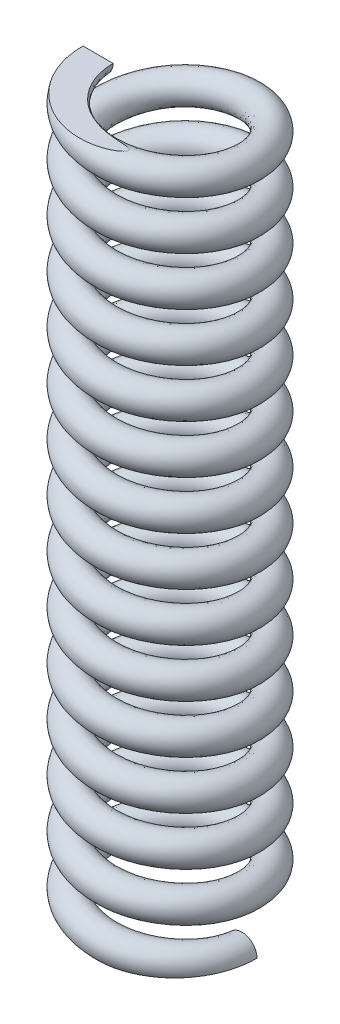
ISO-10303-21;
HEADER;
FILE_DESCRIPTION(('STEP AP214'),'2;1');
FILE_NAME('part.step','',(''),(''),'','','');
FILE_SCHEMA(('AUTOMOTIVE_DESIGN { 1 0 10303 214 1 1 1 1 }'));
ENDSEC;
DATA;
#1=APPLICATION_CONTEXT('core data for automotive mechanical design processes');
#2=APPLICATION_PROTOCOL_DEFINITION('international standard','automotive_design',2000,#1);
#3=PRODUCT_CONTEXT('',#1,'mechanical');
#4=PRODUCT('Part','Part','',(#3));
#5=PRODUCT_RELATED_PRODUCT_CATEGORY('part','',(#4));
#6=PRODUCT_DEFINITION_FORMATION('','',#4);
#7=PRODUCT_DEFINITION_CONTEXT('part definition',#1,'design');
#8=PRODUCT_DEFINITION('design','',#6,#7);
#9=PRODUCT_DEFINITION_SHAPE('','',#8);
#10=(LENGTH_UNIT() NAMED_UNIT(*) SI_UNIT(.MILLI.,.METRE.));
#11=(NAMED_UNIT(*) PLANE_ANGLE_UNIT() SI_UNIT($,.RADIAN.));
#12=(NAMED_UNIT(*) SI_UNIT($,.STERADIAN.) SOLID_ANGLE_UNIT());
#13=UNCERTAINTY_MEASURE_WITH_UNIT(LENGTH_MEASURE(1.E-05),#10,'distance_accuracy_value','');
#14=(GEOMETRIC_REPRESENTATION_CONTEXT(3) GLOBAL_UNCERTAINTY_ASSIGNED_CONTEXT((#13)) GLOBAL_UNIT_ASSIGNED_CONTEXT((#10,
#11,#12)) REPRESENTATION_CONTEXT('',''));
#15=CARTESIAN_POINT('',(0.,0.,0.));
#16=DIRECTION('',(0.,0.,1.));
#17=DIRECTION('',(1.,0.,0.));
#18=AXIS2_PLACEMENT_3D('',#15,#16,#17);
#19=CARTESIAN_POINT('',(1.0922,-16.8890137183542,-2.17296689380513E-13));
#20=DIRECTION('',(-1.98953203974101E-13,0.,-1.));
#21=DIRECTION('',(-1.,0.,1.98953203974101E-13));
#22=AXIS2_PLACEMENT_3D('',#19,#20,#21);
#23=PLANE('',#22);
#24=DIRECTION('',(1.,0.,-1.98953203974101E-13));
#25=VECTOR('',#24,1.);
#26=CARTESIAN_POINT('',(1.0922,-16.8890137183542,-2.17296689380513E-13));
#27=LINE('',#26,#25);
#28=CARTESIAN_POINT('',(0.863599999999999,-16.8890137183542,-1.71815986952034E-13));
#29=VERTEX_POINT('',#28);
#30=CARTESIAN_POINT('',(1.3208,-16.8890137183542,-2.62777391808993E-13));
#31=VERTEX_POINT('',#30);
#32=EDGE_CURVE('E54',#29,#31,#27,.T.);
#33=ORIENTED_EDGE('',*,*,#32,.F.);
#34=CARTESIAN_POINT('',(1.0922,-16.8890137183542,-2.17296689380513E-13));
#35=DIRECTION('',(-1.98953203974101E-13,0.,-1.));
#36=DIRECTION('',(-1.,0.,1.98953203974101E-13));
#37=AXIS2_PLACEMENT_3D('',#34,#35,#36);
#38=CIRCLE('',#37,0.228600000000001);
#39=EDGE_CURVE('E71',#29,#31,#38,.T.);
#40=ORIENTED_EDGE('',*,*,#39,.T.);
#41=EDGE_LOOP('',(#33,#40));
#42=FACE_BOUND('',#41,.T.);
#43=ADVANCED_FACE('F33',(#42),#23,.T.);
#44=CARTESIAN_POINT('',(-1.0922,-6.21748416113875,0.));
#45=DIRECTION('',(0.,0.,1.));
#46=DIRECTION('',(1.,0.,0.));
#47=AXIS2_PLACEMENT_3D('',#44,#45,#46);
#48=PLANE('',#47);
#49=CARTESIAN_POINT('',(-1.0922,-6.21748416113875,0.));
#50=DIRECTION('',(0.,0.,1.));
#51=DIRECTION('',(1.,0.,0.));
#52=AXIS2_PLACEMENT_3D('',#49,#50,#51);
#53=CIRCLE('',#52,0.228600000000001);
#54=CARTESIAN_POINT('',(-1.3208,-6.21748416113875,-1.91867785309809E-13));
#55=VERTEX_POINT('',#54);
#56=CARTESIAN_POINT('',(-0.863599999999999,-6.21748416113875,-2.50904026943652E-13));
#57=VERTEX_POINT('',#56);
#58=EDGE_CURVE('E65',#55,#57,#53,.T.);
#59=ORIENTED_EDGE('',*,*,#58,.F.);
#60=DIRECTION('',(1.,0.,0.));
#61=VECTOR('',#60,1.);
#62=CARTESIAN_POINT('',(-1.0922,-6.21748416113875,0.));
#63=LINE('',#62,#61);
#64=EDGE_CURVE('E48',#55,#57,#63,.T.);
#65=ORIENTED_EDGE('',*,*,#64,.T.);
#66=EDGE_LOOP('',(#59,#65));
#67=FACE_BOUND('',#66,.T.);
#68=ADVANCED_FACE('F64',(#67),#48,.F.);
#69=CARTESIAN_POINT('',(0.863599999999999,-16.8890137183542,-1.71815986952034E-13));
#70=CARTESIAN_POINT('',(0.863600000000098,-16.8276830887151,0.498599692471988));
#71=CARTESIAN_POINT('',(0.431800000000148,-16.7663524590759,0.747899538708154));
#72=CARTESIAN_POINT('',(1.9845707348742E-13,-16.7050218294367,0.99719938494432));
#73=CARTESIAN_POINT('',(-0.43179999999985,-16.6436911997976,0.747899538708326));
#74=CARTESIAN_POINT('',(-0.863599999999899,-16.5823605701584,0.498599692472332));
#75=CARTESIAN_POINT('',(-0.863599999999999,-16.5210299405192,1.71921747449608E-13));
#76=CARTESIAN_POINT('',(-0.863600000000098,-16.4596993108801,-0.498599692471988));
#77=CARTESIAN_POINT('',(-0.431800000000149,-16.3983686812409,-0.747899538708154));
#78=CARTESIAN_POINT('',(-1.98579195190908E-13,-16.3370380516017,-0.99719938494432));
#79=CARTESIAN_POINT('',(0.43179999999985,-16.2757074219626,-0.747899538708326));
#80=CARTESIAN_POINT('',(0.863599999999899,-16.2143767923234,-0.498599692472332));
#81=CARTESIAN_POINT('',(0.863599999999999,-16.1530461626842,-1.71815986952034E-13));
#82=CARTESIAN_POINT('',(0.863600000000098,-16.091715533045,0.498599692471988));
#83=CARTESIAN_POINT('',(0.431800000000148,-16.0303849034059,0.747899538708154));
#84=CARTESIAN_POINT('',(1.9845707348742E-13,-15.9690542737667,0.99719938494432));
#85=CARTESIAN_POINT('',(-0.43179999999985,-15.9077236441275,0.747899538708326));
#86=CARTESIAN_POINT('',(-0.863599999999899,-15.8463930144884,0.498599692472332));
#87=CARTESIAN_POINT('',(-0.863599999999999,-15.7850623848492,1.71921747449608E-13));
#88=CARTESIAN_POINT('',(-0.863600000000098,-15.72373175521,-0.498599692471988));
#89=CARTESIAN_POINT('',(-0.431800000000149,-15.6624011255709,-0.747899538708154));
#90=CARTESIAN_POINT('',(-1.98579195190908E-13,-15.6010704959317,-0.99719938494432));
#91=CARTESIAN_POINT('',(0.43179999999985,-15.5397398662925,-0.747899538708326));
#92=CARTESIAN_POINT('',(0.863599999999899,-15.4784092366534,-0.498599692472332));
#93=CARTESIAN_POINT('',(0.863599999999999,-15.4170786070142,-1.71815986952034E-13));
#94=CARTESIAN_POINT('',(0.863600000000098,-15.355747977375,0.498599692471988));
#95=CARTESIAN_POINT('',(0.431800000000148,-15.2944173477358,0.747899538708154));
#96=CARTESIAN_POINT('',(1.9845707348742E-13,-15.2330867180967,0.99719938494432));
#97=CARTESIAN_POINT('',(-0.43179999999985,-15.1717560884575,0.747899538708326));
#98=CARTESIAN_POINT('',(-0.863599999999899,-15.1104254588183,0.498599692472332));
#99=CARTESIAN_POINT('',(-0.863599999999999,-15.0490948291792,1.71921747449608E-13));
#100=CARTESIAN_POINT('',(-0.863600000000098,-14.98776419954,-0.498599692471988));
#101=CARTESIAN_POINT('',(-0.431800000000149,-14.9264335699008,-0.747899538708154));
#102=CARTESIAN_POINT('',(-1.98579195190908E-13,-14.8651029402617,-0.99719938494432));
#103=CARTESIAN_POINT('',(0.43179999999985,-14.8037723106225,-0.747899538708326));
#104=CARTESIAN_POINT('',(0.863599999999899,-14.7424416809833,-0.498599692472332));
#105=CARTESIAN_POINT('',(0.863599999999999,-14.6811110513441,-1.71815986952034E-13));
#106=CARTESIAN_POINT('',(0.863600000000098,-14.619780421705,0.498599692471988));
#107=CARTESIAN_POINT('',(0.431800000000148,-14.5584497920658,0.747899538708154));
#108=CARTESIAN_POINT('',(1.9845707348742E-13,-14.4971191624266,0.99719938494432));
#109=CARTESIAN_POINT('',(-0.43179999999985,-14.4357885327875,0.747899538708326));
#110=CARTESIAN_POINT('',(-0.863599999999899,-14.3744579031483,0.498599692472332));
#111=CARTESIAN_POINT('',(-0.863599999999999,-14.3131272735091,1.71921747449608E-13));
#112=CARTESIAN_POINT('',(-0.863600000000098,-14.25179664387,-0.498599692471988));
#113=CARTESIAN_POINT('',(-0.431800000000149,-14.1904660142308,-0.747899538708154));
#114=CARTESIAN_POINT('',(-1.98579195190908E-13,-14.1291353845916,-0.99719938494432));
#115=CARTESIAN_POINT('',(0.43179999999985,-14.0678047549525,-0.747899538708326));
#116=CARTESIAN_POINT('',(0.863599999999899,-14.0064741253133,-0.498599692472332));
#117=CARTESIAN_POINT('',(0.863599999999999,-13.9451434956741,-1.71815986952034E-13));
#118=CARTESIAN_POINT('',(0.863600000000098,-13.8838128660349,0.498599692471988));
#119=CARTESIAN_POINT('',(0.431800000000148,-13.8224822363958,0.747899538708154));
#120=CARTESIAN_POINT('',(1.9845707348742E-13,-13.7611516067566,0.99719938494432));
#121=CARTESIAN_POINT('',(-0.43179999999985,-13.6998209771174,0.747899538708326));
#122=CARTESIAN_POINT('',(-0.863599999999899,-13.6384903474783,0.498599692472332));
#123=CARTESIAN_POINT('',(-0.863599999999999,-13.5771597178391,1.71921747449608E-13));
#124=CARTESIAN_POINT('',(-0.863600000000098,-13.5158290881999,-0.498599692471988));
#125=CARTESIAN_POINT('',(-0.431800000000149,-13.4544984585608,-0.747899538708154));
#126=CARTESIAN_POINT('',(-1.98579195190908E-13,-13.3931678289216,-0.99719938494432));
#127=CARTESIAN_POINT('',(0.43179999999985,-13.3318371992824,-0.747899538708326));
#128=CARTESIAN_POINT('',(0.863599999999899,-13.2705065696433,-0.498599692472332));
#129=CARTESIAN_POINT('',(0.863599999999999,-13.2091759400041,-1.71815986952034E-13));
#130=CARTESIAN_POINT('',(0.863600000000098,-13.1478453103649,0.498599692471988));
#131=CARTESIAN_POINT('',(0.431800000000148,-13.0865146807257,0.747899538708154));
#132=CARTESIAN_POINT('',(1.9845707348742E-13,-13.0251840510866,0.99719938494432));
#133=CARTESIAN_POINT('',(-0.43179999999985,-12.9638534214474,0.747899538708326));
#134=CARTESIAN_POINT('',(-0.863599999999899,-12.9025227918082,0.498599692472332));
#135=CARTESIAN_POINT('',(-0.863599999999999,-12.8411921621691,1.71921747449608E-13));
#136=CARTESIAN_POINT('',(-0.863600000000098,-12.7798615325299,-0.498599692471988));
#137=CARTESIAN_POINT('',(-0.431800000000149,-12.7185309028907,-0.747899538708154));
#138=CARTESIAN_POINT('',(-1.98579195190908E-13,-12.6572002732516,-0.99719938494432));
#139=CARTESIAN_POINT('',(0.43179999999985,-12.5958696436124,-0.747899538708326));
#140=CARTESIAN_POINT('',(0.863599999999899,-12.5345390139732,-0.498599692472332));
#141=CARTESIAN_POINT('',(0.863599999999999,-12.4732083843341,-1.71815986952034E-13));
#142=CARTESIAN_POINT('',(0.863600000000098,-12.4118777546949,0.498599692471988));
#143=CARTESIAN_POINT('',(0.431800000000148,-12.3505471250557,0.747899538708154));
#144=CARTESIAN_POINT('',(1.9845707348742E-13,-12.2892164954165,0.99719938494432));
#145=CARTESIAN_POINT('',(-0.43179999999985,-12.2278858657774,0.747899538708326));
#146=CARTESIAN_POINT('',(-0.863599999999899,-12.1665552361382,0.498599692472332));
#147=CARTESIAN_POINT('',(-0.863599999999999,-12.105224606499,1.71921747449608E-13));
#148=CARTESIAN_POINT('',(-0.863600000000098,-12.0438939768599,-0.498599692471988));
#149=CARTESIAN_POINT('',(-0.431800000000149,-11.9825633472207,-0.747899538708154));
#150=CARTESIAN_POINT('',(-1.98579195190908E-13,-11.9212327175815,-0.99719938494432));
#151=CARTESIAN_POINT('',(0.43179999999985,-11.8599020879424,-0.747899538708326));
#152=CARTESIAN_POINT('',(0.863599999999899,-11.7985714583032,-0.498599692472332));
#153=CARTESIAN_POINT('',(0.863599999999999,-11.737240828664,-1.71815986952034E-13));
#154=CARTESIAN_POINT('',(0.863600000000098,-11.6759101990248,0.498599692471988));
#155=CARTESIAN_POINT('',(0.431800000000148,-11.6145795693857,0.747899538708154));
#156=CARTESIAN_POINT('',(1.9845707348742E-13,-11.5532489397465,0.99719938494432));
#157=CARTESIAN_POINT('',(-0.43179999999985,-11.4919183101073,0.747899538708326));
#158=CARTESIAN_POINT('',(-0.863599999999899,-11.4305876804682,0.498599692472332));
#159=CARTESIAN_POINT('',(-0.863599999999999,-11.369257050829,1.71921747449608E-13));
#160=CARTESIAN_POINT('',(-0.863600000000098,-11.3079264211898,-0.498599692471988));
#161=CARTESIAN_POINT('',(-0.431800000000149,-11.2465957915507,-0.747899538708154));
#162=CARTESIAN_POINT('',(-1.98579195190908E-13,-11.1852651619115,-0.99719938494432));
#163=CARTESIAN_POINT('',(0.43179999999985,-11.1239345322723,-0.747899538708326));
#164=CARTESIAN_POINT('',(0.863599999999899,-11.0626039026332,-0.498599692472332));
#165=CARTESIAN_POINT('',(0.863599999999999,-11.001273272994,-1.71815986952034E-13));
#166=CARTESIAN_POINT('',(0.863600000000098,-10.9399426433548,0.498599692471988));
#167=CARTESIAN_POINT('',(0.431800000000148,-10.8786120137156,0.747899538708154));
#168=CARTESIAN_POINT('',(1.9845707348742E-13,-10.8172813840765,0.99719938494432));
#169=CARTESIAN_POINT('',(-0.43179999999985,-10.7559507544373,0.747899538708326));
#170=CARTESIAN_POINT('',(-0.863599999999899,-10.6946201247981,0.498599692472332));
#171=CARTESIAN_POINT('',(-0.863599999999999,-10.633289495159,1.71921747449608E-13));
#172=CARTESIAN_POINT('',(-0.863600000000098,-10.5719588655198,-0.498599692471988));
#173=CARTESIAN_POINT('',(-0.431800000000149,-10.5106282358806,-0.747899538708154));
#174=CARTESIAN_POINT('',(-1.98579195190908E-13,-10.4492976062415,-0.99719938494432));
#175=CARTESIAN_POINT('',(0.43179999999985,-10.3879669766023,-0.747899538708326));
#176=CARTESIAN_POINT('',(0.863599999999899,-10.3266363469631,-0.498599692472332));
#177=CARTESIAN_POINT('',(0.863599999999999,-10.265305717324,-1.71815986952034E-13));
#178=CARTESIAN_POINT('',(0.863600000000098,-10.2039750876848,0.498599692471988));
#179=CARTESIAN_POINT('',(0.431800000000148,-10.1426444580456,0.747899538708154));
#180=CARTESIAN_POINT('',(1.9845707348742E-13,-10.0813138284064,0.99719938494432));
#181=CARTESIAN_POINT('',(-0.43179999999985,-10.0199831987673,0.747899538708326));
#182=CARTESIAN_POINT('',(-0.863599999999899,-9.95865256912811,0.498599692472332));
#183=CARTESIAN_POINT('',(-0.863599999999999,-9.89732193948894,1.71921747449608E-13));
#184=CARTESIAN_POINT('',(-0.863600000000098,-9.83599130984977,-0.498599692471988));
#185=CARTESIAN_POINT('',(-0.431800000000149,-9.7746606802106,-0.747899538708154));
#186=CARTESIAN_POINT('',(-1.98579195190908E-13,-9.71333005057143,-0.99719938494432));
#187=CARTESIAN_POINT('',(0.43179999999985,-9.65199942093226,-0.747899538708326));
#188=CARTESIAN_POINT('',(0.863599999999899,-9.59066879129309,-0.498599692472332));
#189=CARTESIAN_POINT('',(0.863599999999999,-9.52933816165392,-1.71815986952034E-13));
#190=CARTESIAN_POINT('',(0.863600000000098,-9.46800753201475,0.498599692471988));
#191=CARTESIAN_POINT('',(0.431800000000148,-9.40667690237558,0.747899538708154));
#192=CARTESIAN_POINT('',(1.9845707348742E-13,-9.34534627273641,0.99719938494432));
#193=CARTESIAN_POINT('',(-0.43179999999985,-9.28401564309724,0.747899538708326));
#194=CARTESIAN_POINT('',(-0.863599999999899,-9.22268501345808,0.498599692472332));
#195=CARTESIAN_POINT('',(-0.863599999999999,-9.16135438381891,1.71921747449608E-13));
#196=CARTESIAN_POINT('',(-0.863600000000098,-9.10002375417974,-0.498599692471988));
#197=CARTESIAN_POINT('',(-0.431800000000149,-9.03869312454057,-0.747899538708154));
#198=CARTESIAN_POINT('',(-1.98579195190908E-13,-8.9773624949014,-0.99719938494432));
#199=CARTESIAN_POINT('',(0.43179999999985,-8.91603186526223,-0.747899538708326));
#200=CARTESIAN_POINT('',(0.863599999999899,-8.85470123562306,-0.498599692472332));
#201=CARTESIAN_POINT('',(0.863599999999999,-8.79337060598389,-1.71815986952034E-13));
#202=CARTESIAN_POINT('',(0.863600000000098,-8.73203997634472,0.498599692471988));
#203=CARTESIAN_POINT('',(0.431800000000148,-8.67070934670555,0.747899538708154));
#204=CARTESIAN_POINT('',(1.9845707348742E-13,-8.60937871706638,0.99719938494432));
#205=CARTESIAN_POINT('',(-0.43179999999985,-8.54804808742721,0.747899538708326));
#206=CARTESIAN_POINT('',(-0.863599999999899,-8.48671745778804,0.498599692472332));
#207=CARTESIAN_POINT('',(-0.863599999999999,-8.42538682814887,1.71921747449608E-13));
#208=CARTESIAN_POINT('',(-0.863600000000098,-8.3640561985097,-0.498599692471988));
#209=CARTESIAN_POINT('',(-0.431800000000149,-8.30272556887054,-0.747899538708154));
#210=CARTESIAN_POINT('',(-1.98579195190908E-13,-8.24139493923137,-0.99719938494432));
#211=CARTESIAN_POINT('',(0.43179999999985,-8.1800643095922,-0.747899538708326));
#212=CARTESIAN_POINT('',(0.863599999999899,-8.11873367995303,-0.498599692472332));
#213=CARTESIAN_POINT('',(0.863599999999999,-8.05740305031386,-1.71815986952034E-13));
#214=CARTESIAN_POINT('',(0.863600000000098,-7.99607242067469,0.498599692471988));
#215=CARTESIAN_POINT('',(0.431800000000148,-7.93474179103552,0.747899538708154));
#216=CARTESIAN_POINT('',(1.9845707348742E-13,-7.87341116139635,0.99719938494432));
#217=CARTESIAN_POINT('',(-0.43179999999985,-7.81208053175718,0.747899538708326));
#218=CARTESIAN_POINT('',(-0.863599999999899,-7.75074990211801,0.498599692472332));
#219=CARTESIAN_POINT('',(-0.863599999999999,-7.68941927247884,1.71921747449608E-13));
#220=CARTESIAN_POINT('',(-0.863600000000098,-7.62808864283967,-0.498599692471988));
#221=CARTESIAN_POINT('',(-0.431800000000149,-7.5667580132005,-0.747899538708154));
#222=CARTESIAN_POINT('',(-1.98579195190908E-13,-7.50542738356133,-0.99719938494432));
#223=CARTESIAN_POINT('',(0.43179999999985,-7.44409675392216,-0.747899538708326));
#224=CARTESIAN_POINT('',(0.863599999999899,-7.38276612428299,-0.498599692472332));
#225=CARTESIAN_POINT('',(0.863599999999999,-7.32143549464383,-1.71815986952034E-13));
#226=CARTESIAN_POINT('',(0.863600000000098,-7.26010486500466,0.498599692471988));
#227=CARTESIAN_POINT('',(0.431800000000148,-7.19877423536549,0.747899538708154));
#228=CARTESIAN_POINT('',(1.9845707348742E-13,-7.13744360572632,0.99719938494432));
#229=CARTESIAN_POINT('',(-0.43179999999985,-7.07611297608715,0.747899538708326));
#230=CARTESIAN_POINT('',(-0.863599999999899,-7.01478234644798,0.498599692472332));
#231=CARTESIAN_POINT('',(-0.863599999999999,-6.95345171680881,1.71921747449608E-13));
#232=CARTESIAN_POINT('',(-0.863600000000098,-6.89212108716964,-0.498599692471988));
#233=CARTESIAN_POINT('',(-0.431800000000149,-6.83079045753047,-0.747899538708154));
#234=CARTESIAN_POINT('',(-1.98579195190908E-13,-6.7694598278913,-0.99719938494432));
#235=CARTESIAN_POINT('',(0.43179999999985,-6.70812919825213,-0.747899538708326));
#236=CARTESIAN_POINT('',(0.863599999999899,-6.64679856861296,-0.498599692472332));
#237=CARTESIAN_POINT('',(0.863599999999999,-6.58546793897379,-1.71815986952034E-13));
#238=CARTESIAN_POINT('',(0.863600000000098,-6.52413730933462,0.498599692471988));
#239=CARTESIAN_POINT('',(0.431800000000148,-6.46280667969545,0.747899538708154));
#240=CARTESIAN_POINT('',(1.9845707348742E-13,-6.40147605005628,0.99719938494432));
#241=CARTESIAN_POINT('',(-0.43179999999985,-6.34014542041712,0.747899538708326));
#242=CARTESIAN_POINT('',(-0.863599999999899,-6.27881479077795,0.498599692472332));
#243=CARTESIAN_POINT('',(-0.863599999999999,-6.21748416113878,1.71921747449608E-13));
#244=CARTESIAN_POINT('',(-0.863600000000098,-6.15615353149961,-0.498599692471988));
#245=CARTESIAN_POINT('',(-0.431800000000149,-6.09482290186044,-0.747899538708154));
#246=CARTESIAN_POINT('',(-1.98579195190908E-13,-6.03349227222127,-0.99719938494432));
#247=CARTESIAN_POINT('',(0.43179999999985,-5.9721616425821,-0.747899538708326));
#248=CARTESIAN_POINT('',(0.863599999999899,-5.91083101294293,-0.498599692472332));
#249=CARTESIAN_POINT('',(0.863599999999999,-5.84950038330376,-1.71815986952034E-13));
#250=CARTESIAN_POINT('',(0.863599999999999,-16.4318137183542,-1.71815986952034E-13));
#251=CARTESIAN_POINT('',(0.863600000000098,-16.3704830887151,0.498599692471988));
#252=CARTESIAN_POINT('',(0.431800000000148,-16.3091524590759,0.747899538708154));
#253=CARTESIAN_POINT('',(1.9845707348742E-13,-16.2478218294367,0.99719938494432));
#254=CARTESIAN_POINT('',(-0.43179999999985,-16.1864911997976,0.747899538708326));
#255=CARTESIAN_POINT('',(-0.863599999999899,-16.1251605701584,0.498599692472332));
#256=CARTESIAN_POINT('',(-0.863599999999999,-16.0638299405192,1.71921747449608E-13));
#257=CARTESIAN_POINT('',(-0.863600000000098,-16.0024993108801,-0.498599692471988));
#258=CARTESIAN_POINT('',(-0.431800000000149,-15.9411686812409,-0.747899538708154));
#259=CARTESIAN_POINT('',(-1.98579195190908E-13,-15.8798380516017,-0.99719938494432));
#260=CARTESIAN_POINT('',(0.43179999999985,-15.8185074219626,-0.747899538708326));
#261=CARTESIAN_POINT('',(0.863599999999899,-15.7571767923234,-0.498599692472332));
#262=CARTESIAN_POINT('',(0.863599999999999,-15.6958461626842,-1.71815986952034E-13));
#263=CARTESIAN_POINT('',(0.863600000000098,-15.634515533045,0.498599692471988));
#264=CARTESIAN_POINT('',(0.431800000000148,-15.5731849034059,0.747899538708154));
#265=CARTESIAN_POINT('',(1.9845707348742E-13,-15.5118542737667,0.99719938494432));
#266=CARTESIAN_POINT('',(-0.43179999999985,-15.4505236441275,0.747899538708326));
#267=CARTESIAN_POINT('',(-0.863599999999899,-15.3891930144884,0.498599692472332));
#268=CARTESIAN_POINT('',(-0.863599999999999,-15.3278623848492,1.71921747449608E-13));
#269=CARTESIAN_POINT('',(-0.863600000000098,-15.26653175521,-0.498599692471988));
#270=CARTESIAN_POINT('',(-0.431800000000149,-15.2052011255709,-0.747899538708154));
#271=CARTESIAN_POINT('',(-1.98579195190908E-13,-15.1438704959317,-0.99719938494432));
#272=CARTESIAN_POINT('',(0.43179999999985,-15.0825398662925,-0.747899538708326));
#273=CARTESIAN_POINT('',(0.863599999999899,-15.0212092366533,-0.498599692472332));
#274=CARTESIAN_POINT('',(0.863599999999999,-14.9598786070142,-1.71815986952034E-13));
#275=CARTESIAN_POINT('',(0.863600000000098,-14.898547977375,0.498599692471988));
#276=CARTESIAN_POINT('',(0.431800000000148,-14.8372173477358,0.747899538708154));
#277=CARTESIAN_POINT('',(1.9845707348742E-13,-14.7758867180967,0.99719938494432));
#278=CARTESIAN_POINT('',(-0.43179999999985,-14.7145560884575,0.747899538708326));
#279=CARTESIAN_POINT('',(-0.863599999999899,-14.6532254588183,0.498599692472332));
#280=CARTESIAN_POINT('',(-0.863599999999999,-14.5918948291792,1.71921747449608E-13));
#281=CARTESIAN_POINT('',(-0.863600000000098,-14.53056419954,-0.498599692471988));
#282=CARTESIAN_POINT('',(-0.431800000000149,-14.4692335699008,-0.747899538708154));
#283=CARTESIAN_POINT('',(-1.98579195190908E-13,-14.4079029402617,-0.99719938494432));
#284=CARTESIAN_POINT('',(0.43179999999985,-14.3465723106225,-0.747899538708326));
#285=CARTESIAN_POINT('',(0.863599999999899,-14.2852416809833,-0.498599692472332));
#286=CARTESIAN_POINT('',(0.863599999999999,-14.2239110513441,-1.71815986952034E-13));
#287=CARTESIAN_POINT('',(0.863600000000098,-14.162580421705,0.498599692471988));
#288=CARTESIAN_POINT('',(0.431800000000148,-14.1012497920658,0.747899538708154));
#289=CARTESIAN_POINT('',(1.9845707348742E-13,-14.0399191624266,0.99719938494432));
#290=CARTESIAN_POINT('',(-0.43179999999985,-13.9785885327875,0.747899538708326));
#291=CARTESIAN_POINT('',(-0.863599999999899,-13.9172579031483,0.498599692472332));
#292=CARTESIAN_POINT('',(-0.863599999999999,-13.8559272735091,1.71921747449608E-13));
#293=CARTESIAN_POINT('',(-0.863600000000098,-13.79459664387,-0.498599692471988));
#294=CARTESIAN_POINT('',(-0.431800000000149,-13.7332660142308,-0.747899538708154));
#295=CARTESIAN_POINT('',(-1.98579195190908E-13,-13.6719353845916,-0.99719938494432));
#296=CARTESIAN_POINT('',(0.43179999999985,-13.6106047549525,-0.747899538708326));
#297=CARTESIAN_POINT('',(0.863599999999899,-13.5492741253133,-0.498599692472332));
#298=CARTESIAN_POINT('',(0.863599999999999,-13.4879434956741,-1.71815986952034E-13));
#299=CARTESIAN_POINT('',(0.863600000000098,-13.4266128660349,0.498599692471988));
#300=CARTESIAN_POINT('',(0.431800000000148,-13.3652822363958,0.747899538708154));
#301=CARTESIAN_POINT('',(1.9845707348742E-13,-13.3039516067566,0.99719938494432));
#302=CARTESIAN_POINT('',(-0.43179999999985,-13.2426209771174,0.747899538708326));
#303=CARTESIAN_POINT('',(-0.863599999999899,-13.1812903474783,0.498599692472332));
#304=CARTESIAN_POINT('',(-0.863599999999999,-13.1199597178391,1.71921747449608E-13));
#305=CARTESIAN_POINT('',(-0.863600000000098,-13.0586290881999,-0.498599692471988));
#306=CARTESIAN_POINT('',(-0.431800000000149,-12.9972984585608,-0.747899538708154));
#307=CARTESIAN_POINT('',(-1.98579195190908E-13,-12.9359678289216,-0.99719938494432));
#308=CARTESIAN_POINT('',(0.43179999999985,-12.8746371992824,-0.747899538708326));
#309=CARTESIAN_POINT('',(0.863599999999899,-12.8133065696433,-0.498599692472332));
#310=CARTESIAN_POINT('',(0.863599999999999,-12.7519759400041,-1.71815986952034E-13));
#311=CARTESIAN_POINT('',(0.863600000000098,-12.6906453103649,0.498599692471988));
#312=CARTESIAN_POINT('',(0.431800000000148,-12.6293146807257,0.747899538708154));
#313=CARTESIAN_POINT('',(1.9845707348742E-13,-12.5679840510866,0.99719938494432));
#314=CARTESIAN_POINT('',(-0.43179999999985,-12.5066534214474,0.747899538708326));
#315=CARTESIAN_POINT('',(-0.863599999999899,-12.4453227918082,0.498599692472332));
#316=CARTESIAN_POINT('',(-0.863599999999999,-12.3839921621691,1.71921747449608E-13));
#317=CARTESIAN_POINT('',(-0.863600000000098,-12.3226615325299,-0.498599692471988));
#318=CARTESIAN_POINT('',(-0.431800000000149,-12.2613309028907,-0.747899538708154));
#319=CARTESIAN_POINT('',(-1.98579195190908E-13,-12.2000002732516,-0.99719938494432));
#320=CARTESIAN_POINT('',(0.43179999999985,-12.1386696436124,-0.747899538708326));
#321=CARTESIAN_POINT('',(0.863599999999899,-12.0773390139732,-0.498599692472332));
#322=CARTESIAN_POINT('',(0.863599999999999,-12.0160083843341,-1.71815986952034E-13));
#323=CARTESIAN_POINT('',(0.863600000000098,-11.9546777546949,0.498599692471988));
#324=CARTESIAN_POINT('',(0.431800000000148,-11.8933471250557,0.747899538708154));
#325=CARTESIAN_POINT('',(1.9845707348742E-13,-11.8320164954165,0.99719938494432));
#326=CARTESIAN_POINT('',(-0.43179999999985,-11.7706858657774,0.747899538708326));
#327=CARTESIAN_POINT('',(-0.863599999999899,-11.7093552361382,0.498599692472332));
#328=CARTESIAN_POINT('',(-0.863599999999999,-11.648024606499,1.71921747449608E-13));
#329=CARTESIAN_POINT('',(-0.863600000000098,-11.5866939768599,-0.498599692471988));
#330=CARTESIAN_POINT('',(-0.431800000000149,-11.5253633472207,-0.747899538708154));
#331=CARTESIAN_POINT('',(-1.98579195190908E-13,-11.4640327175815,-0.99719938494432));
#332=CARTESIAN_POINT('',(0.43179999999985,-11.4027020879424,-0.747899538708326));
#333=CARTESIAN_POINT('',(0.863599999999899,-11.3413714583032,-0.498599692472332));
#334=CARTESIAN_POINT('',(0.863599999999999,-11.280040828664,-1.71815986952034E-13));
#335=CARTESIAN_POINT('',(0.863600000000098,-11.2187101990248,0.498599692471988));
#336=CARTESIAN_POINT('',(0.431800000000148,-11.1573795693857,0.747899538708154));
#337=CARTESIAN_POINT('',(1.9845707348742E-13,-11.0960489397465,0.99719938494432));
#338=CARTESIAN_POINT('',(-0.43179999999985,-11.0347183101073,0.747899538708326));
#339=CARTESIAN_POINT('',(-0.863599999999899,-10.9733876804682,0.498599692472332));
#340=CARTESIAN_POINT('',(-0.863599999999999,-10.912057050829,1.71921747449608E-13));
#341=CARTESIAN_POINT('',(-0.863600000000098,-10.8507264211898,-0.498599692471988));
#342=CARTESIAN_POINT('',(-0.431800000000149,-10.7893957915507,-0.747899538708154));
#343=CARTESIAN_POINT('',(-1.98579195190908E-13,-10.7280651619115,-0.99719938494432));
#344=CARTESIAN_POINT('',(0.43179999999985,-10.6667345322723,-0.747899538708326));
#345=CARTESIAN_POINT('',(0.863599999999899,-10.6054039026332,-0.498599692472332));
#346=CARTESIAN_POINT('',(0.863599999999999,-10.544073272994,-1.71815986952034E-13));
#347=CARTESIAN_POINT('',(0.863600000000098,-10.4827426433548,0.498599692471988));
#348=CARTESIAN_POINT('',(0.431800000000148,-10.4214120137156,0.747899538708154));
#349=CARTESIAN_POINT('',(1.9845707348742E-13,-10.3600813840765,0.99719938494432));
#350=CARTESIAN_POINT('',(-0.43179999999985,-10.2987507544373,0.747899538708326));
#351=CARTESIAN_POINT('',(-0.863599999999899,-10.2374201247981,0.498599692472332));
#352=CARTESIAN_POINT('',(-0.863599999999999,-10.176089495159,1.71921747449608E-13));
#353=CARTESIAN_POINT('',(-0.863600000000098,-10.1147588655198,-0.498599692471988));
#354=CARTESIAN_POINT('',(-0.431800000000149,-10.0534282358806,-0.747899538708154));
#355=CARTESIAN_POINT('',(-1.98579195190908E-13,-9.99209760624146,-0.99719938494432));
#356=CARTESIAN_POINT('',(0.43179999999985,-9.93076697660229,-0.747899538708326));
#357=CARTESIAN_POINT('',(0.863599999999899,-9.86943634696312,-0.498599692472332));
#358=CARTESIAN_POINT('',(0.863599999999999,-9.80810571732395,-1.71815986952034E-13));
#359=CARTESIAN_POINT('',(0.863600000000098,-9.74677508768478,0.498599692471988));
#360=CARTESIAN_POINT('',(0.431800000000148,-9.68544445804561,0.747899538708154));
#361=CARTESIAN_POINT('',(1.9845707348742E-13,-9.62411382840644,0.99719938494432));
#362=CARTESIAN_POINT('',(-0.43179999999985,-9.56278319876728,0.747899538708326));
#363=CARTESIAN_POINT('',(-0.863599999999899,-9.50145256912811,0.498599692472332));
#364=CARTESIAN_POINT('',(-0.863599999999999,-9.44012193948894,1.71921747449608E-13));
#365=CARTESIAN_POINT('',(-0.863600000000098,-9.37879130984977,-0.498599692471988));
#366=CARTESIAN_POINT('',(-0.431800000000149,-9.3174606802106,-0.747899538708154));
#367=CARTESIAN_POINT('',(-1.98579195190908E-13,-9.25613005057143,-0.99719938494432));
#368=CARTESIAN_POINT('',(0.43179999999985,-9.19479942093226,-0.747899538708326));
#369=CARTESIAN_POINT('',(0.863599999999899,-9.13346879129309,-0.498599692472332));
#370=CARTESIAN_POINT('',(0.863599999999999,-9.07213816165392,-1.71815986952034E-13));
#371=CARTESIAN_POINT('',(0.863600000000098,-9.01080753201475,0.498599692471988));
#372=CARTESIAN_POINT('',(0.431800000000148,-8.94947690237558,0.747899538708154));
#373=CARTESIAN_POINT('',(1.9845707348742E-13,-8.88814627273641,0.99719938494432));
#374=CARTESIAN_POINT('',(-0.43179999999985,-8.82681564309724,0.747899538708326));
#375=CARTESIAN_POINT('',(-0.863599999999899,-8.76548501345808,0.498599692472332));
#376=CARTESIAN_POINT('',(-0.863599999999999,-8.70415438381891,1.71921747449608E-13));
#377=CARTESIAN_POINT('',(-0.863600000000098,-8.64282375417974,-0.498599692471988));
#378=CARTESIAN_POINT('',(-0.431800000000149,-8.58149312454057,-0.747899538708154));
#379=CARTESIAN_POINT('',(-1.98579195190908E-13,-8.5201624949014,-0.99719938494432));
#380=CARTESIAN_POINT('',(0.43179999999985,-8.45883186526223,-0.747899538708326));
#381=CARTESIAN_POINT('',(0.863599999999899,-8.39750123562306,-0.498599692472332));
#382=CARTESIAN_POINT('',(0.863599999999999,-8.33617060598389,-1.71815986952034E-13));
#383=CARTESIAN_POINT('',(0.863600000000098,-8.27483997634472,0.498599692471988));
#384=CARTESIAN_POINT('',(0.431800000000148,-8.21350934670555,0.747899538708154));
#385=CARTESIAN_POINT('',(1.9845707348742E-13,-8.15217871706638,0.99719938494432));
#386=CARTESIAN_POINT('',(-0.43179999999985,-8.09084808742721,0.747899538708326));
#387=CARTESIAN_POINT('',(-0.863599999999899,-8.02951745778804,0.498599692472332));
#388=CARTESIAN_POINT('',(-0.863599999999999,-7.96818682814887,1.71921747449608E-13));
#389=CARTESIAN_POINT('',(-0.863600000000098,-7.9068561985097,-0.498599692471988));
#390=CARTESIAN_POINT('',(-0.431800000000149,-7.84552556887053,-0.747899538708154));
#391=CARTESIAN_POINT('',(-1.98579195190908E-13,-7.78419493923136,-0.99719938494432));
#392=CARTESIAN_POINT('',(0.43179999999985,-7.72286430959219,-0.747899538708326));
#393=CARTESIAN_POINT('',(0.863599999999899,-7.66153367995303,-0.498599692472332));
#394=CARTESIAN_POINT('',(0.863599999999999,-7.60020305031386,-1.71815986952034E-13));
#395=CARTESIAN_POINT('',(0.863600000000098,-7.53887242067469,0.498599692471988));
#396=CARTESIAN_POINT('',(0.431800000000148,-7.47754179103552,0.747899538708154));
#397=CARTESIAN_POINT('',(1.9845707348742E-13,-7.41621116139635,0.99719938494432));
#398=CARTESIAN_POINT('',(-0.43179999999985,-7.35488053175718,0.747899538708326));
#399=CARTESIAN_POINT('',(-0.863599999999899,-7.29354990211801,0.498599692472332));
#400=CARTESIAN_POINT('',(-0.863599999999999,-7.23221927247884,1.71921747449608E-13));
#401=CARTESIAN_POINT('',(-0.863600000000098,-7.17088864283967,-0.498599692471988));
#402=CARTESIAN_POINT('',(-0.431800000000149,-7.1095580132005,-0.747899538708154));
#403=CARTESIAN_POINT('',(-1.98579195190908E-13,-7.04822738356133,-0.99719938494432));
#404=CARTESIAN_POINT('',(0.43179999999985,-6.98689675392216,-0.747899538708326));
#405=CARTESIAN_POINT('',(0.863599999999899,-6.92556612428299,-0.498599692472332));
#406=CARTESIAN_POINT('',(0.863599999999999,-6.86423549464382,-1.71815986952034E-13));
#407=CARTESIAN_POINT('',(0.863600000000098,-6.80290486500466,0.498599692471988));
#408=CARTESIAN_POINT('',(0.431800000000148,-6.74157423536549,0.747899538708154));
#409=CARTESIAN_POINT('',(1.9845707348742E-13,-6.68024360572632,0.99719938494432));
#410=CARTESIAN_POINT('',(-0.43179999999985,-6.61891297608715,0.747899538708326));
#411=CARTESIAN_POINT('',(-0.863599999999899,-6.55758234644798,0.498599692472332));
#412=CARTESIAN_POINT('',(-0.863599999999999,-6.49625171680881,1.71921747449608E-13));
#413=CARTESIAN_POINT('',(-0.863600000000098,-6.43492108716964,-0.498599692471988));
#414=CARTESIAN_POINT('',(-0.431800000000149,-6.37359045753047,-0.747899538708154));
#415=CARTESIAN_POINT('',(-1.98579195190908E-13,-6.3122598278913,-0.99719938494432));
#416=CARTESIAN_POINT('',(0.43179999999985,-6.25092919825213,-0.747899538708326));
#417=CARTESIAN_POINT('',(0.863599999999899,-6.18959856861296,-0.498599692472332));
#418=CARTESIAN_POINT('',(0.863599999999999,-6.12826793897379,-1.71815986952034E-13));
#419=CARTESIAN_POINT('',(0.863600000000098,-6.06693730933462,0.498599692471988));
#420=CARTESIAN_POINT('',(0.431800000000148,-6.00560667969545,0.747899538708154));
#421=CARTESIAN_POINT('',(1.9845707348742E-13,-5.94427605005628,0.99719938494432));
#422=CARTESIAN_POINT('',(-0.43179999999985,-5.88294542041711,0.747899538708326));
#423=CARTESIAN_POINT('',(-0.863599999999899,-5.82161479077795,0.498599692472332));
#424=CARTESIAN_POINT('',(-0.863599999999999,-5.76028416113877,1.71921747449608E-13));
#425=CARTESIAN_POINT('',(-0.863600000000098,-5.69895353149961,-0.498599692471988));
#426=CARTESIAN_POINT('',(-0.431800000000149,-5.63762290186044,-0.747899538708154));
#427=CARTESIAN_POINT('',(-1.98579195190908E-13,-5.57629227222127,-0.99719938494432));
#428=CARTESIAN_POINT('',(0.43179999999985,-5.5149616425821,-0.747899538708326));
#429=CARTESIAN_POINT('',(0.863599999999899,-5.45363101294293,-0.498599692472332));
#430=CARTESIAN_POINT('',(0.863599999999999,-5.39230038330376,-1.71815986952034E-13));
#431=CARTESIAN_POINT('',(1.3208,-16.4318137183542,-2.62777391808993E-13));
#432=CARTESIAN_POINT('',(1.32080000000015,-16.3704830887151,0.762564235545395));
#433=CARTESIAN_POINT('',(0.660400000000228,-16.3091524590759,1.14384635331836));
#434=CARTESIAN_POINT('',(3.0352258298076E-13,-16.2478218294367,1.52512847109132));
#435=CARTESIAN_POINT('',(-0.660399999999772,-16.1864911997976,1.14384635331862));
#436=CARTESIAN_POINT('',(-1.32079999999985,-16.1251605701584,0.762564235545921));
#437=CARTESIAN_POINT('',(-1.3208,-16.0638299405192,2.62939143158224E-13));
#438=CARTESIAN_POINT('',(-1.32080000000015,-16.0024993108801,-0.762564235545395));
#439=CARTESIAN_POINT('',(-0.660400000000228,-15.9411686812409,-1.14384635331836));
#440=CARTESIAN_POINT('',(-3.03709357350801E-13,-15.8798380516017,-1.52512847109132));
#441=CARTESIAN_POINT('',(0.660399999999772,-15.8185074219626,-1.14384635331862));
#442=CARTESIAN_POINT('',(1.32079999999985,-15.7571767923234,-0.762564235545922));
#443=CARTESIAN_POINT('',(1.3208,-15.6958461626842,-2.62777391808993E-13));
#444=CARTESIAN_POINT('',(1.32080000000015,-15.634515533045,0.762564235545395));
#445=CARTESIAN_POINT('',(0.660400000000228,-15.5731849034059,1.14384635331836));
#446=CARTESIAN_POINT('',(3.0352258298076E-13,-15.5118542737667,1.52512847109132));
#447=CARTESIAN_POINT('',(-0.660399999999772,-15.4505236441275,1.14384635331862));
#448=CARTESIAN_POINT('',(-1.32079999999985,-15.3891930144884,0.762564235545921));
#449=CARTESIAN_POINT('',(-1.3208,-15.3278623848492,2.62939143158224E-13));
#450=CARTESIAN_POINT('',(-1.32080000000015,-15.26653175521,-0.762564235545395));
#451=CARTESIAN_POINT('',(-0.660400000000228,-15.2052011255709,-1.14384635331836));
#452=CARTESIAN_POINT('',(-3.03709357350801E-13,-15.1438704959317,-1.52512847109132));
#453=CARTESIAN_POINT('',(0.660399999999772,-15.0825398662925,-1.14384635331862));
#454=CARTESIAN_POINT('',(1.32079999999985,-15.0212092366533,-0.762564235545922));
#455=CARTESIAN_POINT('',(1.3208,-14.9598786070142,-2.62777391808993E-13));
#456=CARTESIAN_POINT('',(1.32080000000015,-14.898547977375,0.762564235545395));
#457=CARTESIAN_POINT('',(0.660400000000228,-14.8372173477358,1.14384635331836));
#458=CARTESIAN_POINT('',(3.0352258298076E-13,-14.7758867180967,1.52512847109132));
#459=CARTESIAN_POINT('',(-0.660399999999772,-14.7145560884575,1.14384635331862));
#460=CARTESIAN_POINT('',(-1.32079999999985,-14.6532254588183,0.762564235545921));
#461=CARTESIAN_POINT('',(-1.3208,-14.5918948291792,2.62939143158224E-13));
#462=CARTESIAN_POINT('',(-1.32080000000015,-14.53056419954,-0.762564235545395));
#463=CARTESIAN_POINT('',(-0.660400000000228,-14.4692335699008,-1.14384635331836));
#464=CARTESIAN_POINT('',(-3.03709357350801E-13,-14.4079029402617,-1.52512847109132));
#465=CARTESIAN_POINT('',(0.660399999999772,-14.3465723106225,-1.14384635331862));
#466=CARTESIAN_POINT('',(1.32079999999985,-14.2852416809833,-0.762564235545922));
#467=CARTESIAN_POINT('',(1.3208,-14.2239110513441,-2.62777391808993E-13));
#468=CARTESIAN_POINT('',(1.32080000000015,-14.162580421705,0.762564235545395));
#469=CARTESIAN_POINT('',(0.660400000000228,-14.1012497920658,1.14384635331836));
#470=CARTESIAN_POINT('',(3.0352258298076E-13,-14.0399191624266,1.52512847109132));
#471=CARTESIAN_POINT('',(-0.660399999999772,-13.9785885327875,1.14384635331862));
#472=CARTESIAN_POINT('',(-1.32079999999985,-13.9172579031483,0.762564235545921));
#473=CARTESIAN_POINT('',(-1.3208,-13.8559272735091,2.62939143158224E-13));
#474=CARTESIAN_POINT('',(-1.32080000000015,-13.79459664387,-0.762564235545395));
#475=CARTESIAN_POINT('',(-0.660400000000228,-13.7332660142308,-1.14384635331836));
#476=CARTESIAN_POINT('',(-3.03709357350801E-13,-13.6719353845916,-1.52512847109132));
#477=CARTESIAN_POINT('',(0.660399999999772,-13.6106047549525,-1.14384635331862));
#478=CARTESIAN_POINT('',(1.32079999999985,-13.5492741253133,-0.762564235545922));
#479=CARTESIAN_POINT('',(1.3208,-13.4879434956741,-2.62777391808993E-13));
#480=CARTESIAN_POINT('',(1.32080000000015,-13.4266128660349,0.762564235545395));
#481=CARTESIAN_POINT('',(0.660400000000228,-13.3652822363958,1.14384635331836));
#482=CARTESIAN_POINT('',(3.0352258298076E-13,-13.3039516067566,1.52512847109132));
#483=CARTESIAN_POINT('',(-0.660399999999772,-13.2426209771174,1.14384635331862));
#484=CARTESIAN_POINT('',(-1.32079999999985,-13.1812903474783,0.762564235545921));
#485=CARTESIAN_POINT('',(-1.3208,-13.1199597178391,2.62939143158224E-13));
#486=CARTESIAN_POINT('',(-1.32080000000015,-13.0586290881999,-0.762564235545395));
#487=CARTESIAN_POINT('',(-0.660400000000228,-12.9972984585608,-1.14384635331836));
#488=CARTESIAN_POINT('',(-3.03709357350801E-13,-12.9359678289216,-1.52512847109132));
#489=CARTESIAN_POINT('',(0.660399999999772,-12.8746371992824,-1.14384635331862));
#490=CARTESIAN_POINT('',(1.32079999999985,-12.8133065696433,-0.762564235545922));
#491=CARTESIAN_POINT('',(1.3208,-12.7519759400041,-2.62777391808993E-13));
#492=CARTESIAN_POINT('',(1.32080000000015,-12.6906453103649,0.762564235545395));
#493=CARTESIAN_POINT('',(0.660400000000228,-12.6293146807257,1.14384635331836));
#494=CARTESIAN_POINT('',(3.0352258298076E-13,-12.5679840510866,1.52512847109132));
#495=CARTESIAN_POINT('',(-0.660399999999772,-12.5066534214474,1.14384635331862));
#496=CARTESIAN_POINT('',(-1.32079999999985,-12.4453227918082,0.762564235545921));
#497=CARTESIAN_POINT('',(-1.3208,-12.3839921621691,2.62939143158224E-13));
#498=CARTESIAN_POINT('',(-1.32080000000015,-12.3226615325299,-0.762564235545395));
#499=CARTESIAN_POINT('',(-0.660400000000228,-12.2613309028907,-1.14384635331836));
#500=CARTESIAN_POINT('',(-3.03709357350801E-13,-12.2000002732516,-1.52512847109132));
#501=CARTESIAN_POINT('',(0.660399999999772,-12.1386696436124,-1.14384635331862));
#502=CARTESIAN_POINT('',(1.32079999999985,-12.0773390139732,-0.762564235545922));
#503=CARTESIAN_POINT('',(1.3208,-12.0160083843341,-2.62777391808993E-13));
#504=CARTESIAN_POINT('',(1.32080000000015,-11.9546777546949,0.762564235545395));
#505=CARTESIAN_POINT('',(0.660400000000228,-11.8933471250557,1.14384635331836));
#506=CARTESIAN_POINT('',(3.0352258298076E-13,-11.8320164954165,1.52512847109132));
#507=CARTESIAN_POINT('',(-0.660399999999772,-11.7706858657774,1.14384635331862));
#508=CARTESIAN_POINT('',(-1.32079999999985,-11.7093552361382,0.762564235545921));
#509=CARTESIAN_POINT('',(-1.3208,-11.648024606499,2.62939143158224E-13));
#510=CARTESIAN_POINT('',(-1.32080000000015,-11.5866939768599,-0.762564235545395));
#511=CARTESIAN_POINT('',(-0.660400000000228,-11.5253633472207,-1.14384635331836));
#512=CARTESIAN_POINT('',(-3.03709357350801E-13,-11.4640327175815,-1.52512847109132));
#513=CARTESIAN_POINT('',(0.660399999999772,-11.4027020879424,-1.14384635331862));
#514=CARTESIAN_POINT('',(1.32079999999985,-11.3413714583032,-0.762564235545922));
#515=CARTESIAN_POINT('',(1.3208,-11.280040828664,-2.62777391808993E-13));
#516=CARTESIAN_POINT('',(1.32080000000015,-11.2187101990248,0.762564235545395));
#517=CARTESIAN_POINT('',(0.660400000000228,-11.1573795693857,1.14384635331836));
#518=CARTESIAN_POINT('',(3.0352258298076E-13,-11.0960489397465,1.52512847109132));
#519=CARTESIAN_POINT('',(-0.660399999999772,-11.0347183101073,1.14384635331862));
#520=CARTESIAN_POINT('',(-1.32079999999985,-10.9733876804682,0.762564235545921));
#521=CARTESIAN_POINT('',(-1.3208,-10.912057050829,2.62939143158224E-13));
#522=CARTESIAN_POINT('',(-1.32080000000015,-10.8507264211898,-0.762564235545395));
#523=CARTESIAN_POINT('',(-0.660400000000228,-10.7893957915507,-1.14384635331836));
#524=CARTESIAN_POINT('',(-3.03709357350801E-13,-10.7280651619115,-1.52512847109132));
#525=CARTESIAN_POINT('',(0.660399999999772,-10.6667345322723,-1.14384635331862));
#526=CARTESIAN_POINT('',(1.32079999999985,-10.6054039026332,-0.762564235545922));
#527=CARTESIAN_POINT('',(1.3208,-10.544073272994,-2.62777391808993E-13));
#528=CARTESIAN_POINT('',(1.32080000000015,-10.4827426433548,0.762564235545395));
#529=CARTESIAN_POINT('',(0.660400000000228,-10.4214120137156,1.14384635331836));
#530=CARTESIAN_POINT('',(3.0352258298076E-13,-10.3600813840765,1.52512847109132));
#531=CARTESIAN_POINT('',(-0.660399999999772,-10.2987507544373,1.14384635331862));
#532=CARTESIAN_POINT('',(-1.32079999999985,-10.2374201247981,0.762564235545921));
#533=CARTESIAN_POINT('',(-1.3208,-10.176089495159,2.62939143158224E-13));
#534=CARTESIAN_POINT('',(-1.32080000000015,-10.1147588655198,-0.762564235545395));
#535=CARTESIAN_POINT('',(-0.660400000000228,-10.0534282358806,-1.14384635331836));
#536=CARTESIAN_POINT('',(-3.03709357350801E-13,-9.99209760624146,-1.52512847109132));
#537=CARTESIAN_POINT('',(0.660399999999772,-9.93076697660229,-1.14384635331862));
#538=CARTESIAN_POINT('',(1.32079999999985,-9.86943634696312,-0.762564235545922));
#539=CARTESIAN_POINT('',(1.3208,-9.80810571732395,-2.62777391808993E-13));
#540=CARTESIAN_POINT('',(1.32080000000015,-9.74677508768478,0.762564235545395));
#541=CARTESIAN_POINT('',(0.660400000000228,-9.68544445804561,1.14384635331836));
#542=CARTESIAN_POINT('',(3.0352258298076E-13,-9.62411382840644,1.52512847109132));
#543=CARTESIAN_POINT('',(-0.660399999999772,-9.56278319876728,1.14384635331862));
#544=CARTESIAN_POINT('',(-1.32079999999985,-9.50145256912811,0.762564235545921));
#545=CARTESIAN_POINT('',(-1.3208,-9.44012193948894,2.62939143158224E-13));
#546=CARTESIAN_POINT('',(-1.32080000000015,-9.37879130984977,-0.762564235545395));
#547=CARTESIAN_POINT('',(-0.660400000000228,-9.3174606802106,-1.14384635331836));
#548=CARTESIAN_POINT('',(-3.03709357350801E-13,-9.25613005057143,-1.52512847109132));
#549=CARTESIAN_POINT('',(0.660399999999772,-9.19479942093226,-1.14384635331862));
#550=CARTESIAN_POINT('',(1.32079999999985,-9.13346879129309,-0.762564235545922));
#551=CARTESIAN_POINT('',(1.3208,-9.07213816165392,-2.62777391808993E-13));
#552=CARTESIAN_POINT('',(1.32080000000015,-9.01080753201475,0.762564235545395));
#553=CARTESIAN_POINT('',(0.660400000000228,-8.94947690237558,1.14384635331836));
#554=CARTESIAN_POINT('',(3.0352258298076E-13,-8.88814627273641,1.52512847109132));
#555=CARTESIAN_POINT('',(-0.660399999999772,-8.82681564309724,1.14384635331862));
#556=CARTESIAN_POINT('',(-1.32079999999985,-8.76548501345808,0.762564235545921));
#557=CARTESIAN_POINT('',(-1.3208,-8.70415438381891,2.62939143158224E-13));
#558=CARTESIAN_POINT('',(-1.32080000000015,-8.64282375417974,-0.762564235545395));
#559=CARTESIAN_POINT('',(-0.660400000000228,-8.58149312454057,-1.14384635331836));
#560=CARTESIAN_POINT('',(-3.03709357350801E-13,-8.5201624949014,-1.52512847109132));
#561=CARTESIAN_POINT('',(0.660399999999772,-8.45883186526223,-1.14384635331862));
#562=CARTESIAN_POINT('',(1.32079999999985,-8.39750123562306,-0.762564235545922));
#563=CARTESIAN_POINT('',(1.3208,-8.33617060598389,-2.62777391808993E-13));
#564=CARTESIAN_POINT('',(1.32080000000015,-8.27483997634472,0.762564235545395));
#565=CARTESIAN_POINT('',(0.660400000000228,-8.21350934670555,1.14384635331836));
#566=CARTESIAN_POINT('',(3.0352258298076E-13,-8.15217871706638,1.52512847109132));
#567=CARTESIAN_POINT('',(-0.660399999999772,-8.09084808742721,1.14384635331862));
#568=CARTESIAN_POINT('',(-1.32079999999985,-8.02951745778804,0.762564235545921));
#569=CARTESIAN_POINT('',(-1.3208,-7.96818682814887,2.62939143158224E-13));
#570=CARTESIAN_POINT('',(-1.32080000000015,-7.9068561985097,-0.762564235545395));
#571=CARTESIAN_POINT('',(-0.660400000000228,-7.84552556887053,-1.14384635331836));
#572=CARTESIAN_POINT('',(-3.03709357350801E-13,-7.78419493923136,-1.52512847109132));
#573=CARTESIAN_POINT('',(0.660399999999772,-7.72286430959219,-1.14384635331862));
#574=CARTESIAN_POINT('',(1.32079999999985,-7.66153367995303,-0.762564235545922));
#575=CARTESIAN_POINT('',(1.3208,-7.60020305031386,-2.62777391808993E-13));
#576=CARTESIAN_POINT('',(1.32080000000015,-7.53887242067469,0.762564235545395));
#577=CARTESIAN_POINT('',(0.660400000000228,-7.47754179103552,1.14384635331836));
#578=CARTESIAN_POINT('',(3.0352258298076E-13,-7.41621116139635,1.52512847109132));
#579=CARTESIAN_POINT('',(-0.660399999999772,-7.35488053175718,1.14384635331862));
#580=CARTESIAN_POINT('',(-1.32079999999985,-7.29354990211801,0.762564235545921));
#581=CARTESIAN_POINT('',(-1.3208,-7.23221927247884,2.62939143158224E-13));
#582=CARTESIAN_POINT('',(-1.32080000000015,-7.17088864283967,-0.762564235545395));
#583=CARTESIAN_POINT('',(-0.660400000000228,-7.1095580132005,-1.14384635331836));
#584=CARTESIAN_POINT('',(-3.03709357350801E-13,-7.04822738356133,-1.52512847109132));
#585=CARTESIAN_POINT('',(0.660399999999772,-6.98689675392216,-1.14384635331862));
#586=CARTESIAN_POINT('',(1.32079999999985,-6.92556612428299,-0.762564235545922));
#587=CARTESIAN_POINT('',(1.3208,-6.86423549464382,-2.62777391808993E-13));
#588=CARTESIAN_POINT('',(1.32080000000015,-6.80290486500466,0.762564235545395));
#589=CARTESIAN_POINT('',(0.660400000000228,-6.74157423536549,1.14384635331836));
#590=CARTESIAN_POINT('',(3.0352258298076E-13,-6.68024360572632,1.52512847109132));
#591=CARTESIAN_POINT('',(-0.660399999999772,-6.61891297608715,1.14384635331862));
#592=CARTESIAN_POINT('',(-1.32079999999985,-6.55758234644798,0.762564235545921));
#593=CARTESIAN_POINT('',(-1.3208,-6.49625171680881,2.62939143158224E-13));
#594=CARTESIAN_POINT('',(-1.32080000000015,-6.43492108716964,-0.762564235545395));
#595=CARTESIAN_POINT('',(-0.660400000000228,-6.37359045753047,-1.14384635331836));
#596=CARTESIAN_POINT('',(-3.03709357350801E-13,-6.3122598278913,-1.52512847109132));
#597=CARTESIAN_POINT('',(0.660399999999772,-6.25092919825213,-1.14384635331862));
#598=CARTESIAN_POINT('',(1.32079999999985,-6.18959856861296,-0.762564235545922));
#599=CARTESIAN_POINT('',(1.3208,-6.12826793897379,-2.62777391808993E-13));
#600=CARTESIAN_POINT('',(1.32080000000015,-6.06693730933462,0.762564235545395));
#601=CARTESIAN_POINT('',(0.660400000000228,-6.00560667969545,1.14384635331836));
#602=CARTESIAN_POINT('',(3.0352258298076E-13,-5.94427605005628,1.52512847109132));
#603=CARTESIAN_POINT('',(-0.660399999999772,-5.88294542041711,1.14384635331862));
#604=CARTESIAN_POINT('',(-1.32079999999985,-5.82161479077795,0.762564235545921));
#605=CARTESIAN_POINT('',(-1.3208,-5.76028416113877,2.62939143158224E-13));
#606=CARTESIAN_POINT('',(-1.32080000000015,-5.69895353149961,-0.762564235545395));
#607=CARTESIAN_POINT('',(-0.660400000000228,-5.63762290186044,-1.14384635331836));
#608=CARTESIAN_POINT('',(-3.03709357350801E-13,-5.57629227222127,-1.52512847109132));
#609=CARTESIAN_POINT('',(0.660399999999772,-5.5149616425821,-1.14384635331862));
#610=CARTESIAN_POINT('',(1.32079999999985,-5.45363101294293,-0.762564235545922));
#611=CARTESIAN_POINT('',(1.3208,-5.39230038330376,-2.62777391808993E-13));
#612=CARTESIAN_POINT('',(1.3208,-16.8890137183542,-2.62777391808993E-13));
#613=CARTESIAN_POINT('',(1.32080000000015,-16.8276830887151,0.762564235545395));
#614=CARTESIAN_POINT('',(0.660400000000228,-16.7663524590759,1.14384635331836));
#615=CARTESIAN_POINT('',(3.0352258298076E-13,-16.7050218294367,1.52512847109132));
#616=CARTESIAN_POINT('',(-0.660399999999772,-16.6436911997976,1.14384635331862));
#617=CARTESIAN_POINT('',(-1.32079999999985,-16.5823605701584,0.762564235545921));
#618=CARTESIAN_POINT('',(-1.3208,-16.5210299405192,2.62939143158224E-13));
#619=CARTESIAN_POINT('',(-1.32080000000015,-16.4596993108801,-0.762564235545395));
#620=CARTESIAN_POINT('',(-0.660400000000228,-16.3983686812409,-1.14384635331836));
#621=CARTESIAN_POINT('',(-3.03709357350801E-13,-16.3370380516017,-1.52512847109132));
#622=CARTESIAN_POINT('',(0.660399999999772,-16.2757074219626,-1.14384635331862));
#623=CARTESIAN_POINT('',(1.32079999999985,-16.2143767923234,-0.762564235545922));
#624=CARTESIAN_POINT('',(1.3208,-16.1530461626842,-2.62777391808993E-13));
#625=CARTESIAN_POINT('',(1.32080000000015,-16.091715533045,0.762564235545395));
#626=CARTESIAN_POINT('',(0.660400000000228,-16.0303849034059,1.14384635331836));
#627=CARTESIAN_POINT('',(3.0352258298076E-13,-15.9690542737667,1.52512847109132));
#628=CARTESIAN_POINT('',(-0.660399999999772,-15.9077236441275,1.14384635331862));
#629=CARTESIAN_POINT('',(-1.32079999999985,-15.8463930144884,0.762564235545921));
#630=CARTESIAN_POINT('',(-1.3208,-15.7850623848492,2.62939143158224E-13));
#631=CARTESIAN_POINT('',(-1.32080000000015,-15.72373175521,-0.762564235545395));
#632=CARTESIAN_POINT('',(-0.660400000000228,-15.6624011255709,-1.14384635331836));
#633=CARTESIAN_POINT('',(-3.03709357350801E-13,-15.6010704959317,-1.52512847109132));
#634=CARTESIAN_POINT('',(0.660399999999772,-15.5397398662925,-1.14384635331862));
#635=CARTESIAN_POINT('',(1.32079999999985,-15.4784092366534,-0.762564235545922));
#636=CARTESIAN_POINT('',(1.3208,-15.4170786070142,-2.62777391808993E-13));
#637=CARTESIAN_POINT('',(1.32080000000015,-15.355747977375,0.762564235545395));
#638=CARTESIAN_POINT('',(0.660400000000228,-15.2944173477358,1.14384635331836));
#639=CARTESIAN_POINT('',(3.0352258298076E-13,-15.2330867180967,1.52512847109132));
#640=CARTESIAN_POINT('',(-0.660399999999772,-15.1717560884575,1.14384635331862));
#641=CARTESIAN_POINT('',(-1.32079999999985,-15.1104254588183,0.762564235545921));
#642=CARTESIAN_POINT('',(-1.3208,-15.0490948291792,2.62939143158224E-13));
#643=CARTESIAN_POINT('',(-1.32080000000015,-14.98776419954,-0.762564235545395));
#644=CARTESIAN_POINT('',(-0.660400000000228,-14.9264335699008,-1.14384635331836));
#645=CARTESIAN_POINT('',(-3.03709357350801E-13,-14.8651029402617,-1.52512847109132));
#646=CARTESIAN_POINT('',(0.660399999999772,-14.8037723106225,-1.14384635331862));
#647=CARTESIAN_POINT('',(1.32079999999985,-14.7424416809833,-0.762564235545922));
#648=CARTESIAN_POINT('',(1.3208,-14.6811110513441,-2.62777391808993E-13));
#649=CARTESIAN_POINT('',(1.32080000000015,-14.619780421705,0.762564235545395));
#650=CARTESIAN_POINT('',(0.660400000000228,-14.5584497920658,1.14384635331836));
#651=CARTESIAN_POINT('',(3.0352258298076E-13,-14.4971191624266,1.52512847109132));
#652=CARTESIAN_POINT('',(-0.660399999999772,-14.4357885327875,1.14384635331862));
#653=CARTESIAN_POINT('',(-1.32079999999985,-14.3744579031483,0.762564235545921));
#654=CARTESIAN_POINT('',(-1.3208,-14.3131272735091,2.62939143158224E-13));
#655=CARTESIAN_POINT('',(-1.32080000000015,-14.25179664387,-0.762564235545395));
#656=CARTESIAN_POINT('',(-0.660400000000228,-14.1904660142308,-1.14384635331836));
#657=CARTESIAN_POINT('',(-3.03709357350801E-13,-14.1291353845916,-1.52512847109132));
#658=CARTESIAN_POINT('',(0.660399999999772,-14.0678047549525,-1.14384635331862));
#659=CARTESIAN_POINT('',(1.32079999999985,-14.0064741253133,-0.762564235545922));
#660=CARTESIAN_POINT('',(1.3208,-13.9451434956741,-2.62777391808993E-13));
#661=CARTESIAN_POINT('',(1.32080000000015,-13.8838128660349,0.762564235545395));
#662=CARTESIAN_POINT('',(0.660400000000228,-13.8224822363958,1.14384635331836));
#663=CARTESIAN_POINT('',(3.0352258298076E-13,-13.7611516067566,1.52512847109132));
#664=CARTESIAN_POINT('',(-0.660399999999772,-13.6998209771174,1.14384635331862));
#665=CARTESIAN_POINT('',(-1.32079999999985,-13.6384903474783,0.762564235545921));
#666=CARTESIAN_POINT('',(-1.3208,-13.5771597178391,2.62939143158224E-13));
#667=CARTESIAN_POINT('',(-1.32080000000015,-13.5158290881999,-0.762564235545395));
#668=CARTESIAN_POINT('',(-0.660400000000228,-13.4544984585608,-1.14384635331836));
#669=CARTESIAN_POINT('',(-3.03709357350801E-13,-13.3931678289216,-1.52512847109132));
#670=CARTESIAN_POINT('',(0.660399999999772,-13.3318371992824,-1.14384635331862));
#671=CARTESIAN_POINT('',(1.32079999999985,-13.2705065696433,-0.762564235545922));
#672=CARTESIAN_POINT('',(1.3208,-13.2091759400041,-2.62777391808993E-13));
#673=CARTESIAN_POINT('',(1.32080000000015,-13.1478453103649,0.762564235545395));
#674=CARTESIAN_POINT('',(0.660400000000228,-13.0865146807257,1.14384635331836));
#675=CARTESIAN_POINT('',(3.0352258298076E-13,-13.0251840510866,1.52512847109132));
#676=CARTESIAN_POINT('',(-0.660399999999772,-12.9638534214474,1.14384635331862));
#677=CARTESIAN_POINT('',(-1.32079999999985,-12.9025227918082,0.762564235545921));
#678=CARTESIAN_POINT('',(-1.3208,-12.8411921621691,2.62939143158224E-13));
#679=CARTESIAN_POINT('',(-1.32080000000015,-12.7798615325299,-0.762564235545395));
#680=CARTESIAN_POINT('',(-0.660400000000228,-12.7185309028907,-1.14384635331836));
#681=CARTESIAN_POINT('',(-3.03709357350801E-13,-12.6572002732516,-1.52512847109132));
#682=CARTESIAN_POINT('',(0.660399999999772,-12.5958696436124,-1.14384635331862));
#683=CARTESIAN_POINT('',(1.32079999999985,-12.5345390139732,-0.762564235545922));
#684=CARTESIAN_POINT('',(1.3208,-12.4732083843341,-2.62777391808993E-13));
#685=CARTESIAN_POINT('',(1.32080000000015,-12.4118777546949,0.762564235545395));
#686=CARTESIAN_POINT('',(0.660400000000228,-12.3505471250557,1.14384635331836));
#687=CARTESIAN_POINT('',(3.0352258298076E-13,-12.2892164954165,1.52512847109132));
#688=CARTESIAN_POINT('',(-0.660399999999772,-12.2278858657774,1.14384635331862));
#689=CARTESIAN_POINT('',(-1.32079999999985,-12.1665552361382,0.762564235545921));
#690=CARTESIAN_POINT('',(-1.3208,-12.105224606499,2.62939143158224E-13));
#691=CARTESIAN_POINT('',(-1.32080000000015,-12.0438939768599,-0.762564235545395));
#692=CARTESIAN_POINT('',(-0.660400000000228,-11.9825633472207,-1.14384635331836));
#693=CARTESIAN_POINT('',(-3.03709357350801E-13,-11.9212327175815,-1.52512847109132));
#694=CARTESIAN_POINT('',(0.660399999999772,-11.8599020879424,-1.14384635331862));
#695=CARTESIAN_POINT('',(1.32079999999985,-11.7985714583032,-0.762564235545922));
#696=CARTESIAN_POINT('',(1.3208,-11.737240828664,-2.62777391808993E-13));
#697=CARTESIAN_POINT('',(1.32080000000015,-11.6759101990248,0.762564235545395));
#698=CARTESIAN_POINT('',(0.660400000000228,-11.6145795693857,1.14384635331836));
#699=CARTESIAN_POINT('',(3.0352258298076E-13,-11.5532489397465,1.52512847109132));
#700=CARTESIAN_POINT('',(-0.660399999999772,-11.4919183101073,1.14384635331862));
#701=CARTESIAN_POINT('',(-1.32079999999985,-11.4305876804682,0.762564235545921));
#702=CARTESIAN_POINT('',(-1.3208,-11.369257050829,2.62939143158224E-13));
#703=CARTESIAN_POINT('',(-1.32080000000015,-11.3079264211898,-0.762564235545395));
#704=CARTESIAN_POINT('',(-0.660400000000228,-11.2465957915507,-1.14384635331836));
#705=CARTESIAN_POINT('',(-3.03709357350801E-13,-11.1852651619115,-1.52512847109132));
#706=CARTESIAN_POINT('',(0.660399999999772,-11.1239345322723,-1.14384635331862));
#707=CARTESIAN_POINT('',(1.32079999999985,-11.0626039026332,-0.762564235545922));
#708=CARTESIAN_POINT('',(1.3208,-11.001273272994,-2.62777391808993E-13));
#709=CARTESIAN_POINT('',(1.32080000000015,-10.9399426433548,0.762564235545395));
#710=CARTESIAN_POINT('',(0.660400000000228,-10.8786120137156,1.14384635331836));
#711=CARTESIAN_POINT('',(3.0352258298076E-13,-10.8172813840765,1.52512847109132));
#712=CARTESIAN_POINT('',(-0.660399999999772,-10.7559507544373,1.14384635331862));
#713=CARTESIAN_POINT('',(-1.32079999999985,-10.6946201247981,0.762564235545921));
#714=CARTESIAN_POINT('',(-1.3208,-10.633289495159,2.62939143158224E-13));
#715=CARTESIAN_POINT('',(-1.32080000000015,-10.5719588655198,-0.762564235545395));
#716=CARTESIAN_POINT('',(-0.660400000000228,-10.5106282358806,-1.14384635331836));
#717=CARTESIAN_POINT('',(-3.03709357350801E-13,-10.4492976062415,-1.52512847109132));
#718=CARTESIAN_POINT('',(0.660399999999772,-10.3879669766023,-1.14384635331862));
#719=CARTESIAN_POINT('',(1.32079999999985,-10.3266363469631,-0.762564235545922));
#720=CARTESIAN_POINT('',(1.3208,-10.265305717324,-2.62777391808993E-13));
#721=CARTESIAN_POINT('',(1.32080000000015,-10.2039750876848,0.762564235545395));
#722=CARTESIAN_POINT('',(0.660400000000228,-10.1426444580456,1.14384635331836));
#723=CARTESIAN_POINT('',(3.0352258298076E-13,-10.0813138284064,1.52512847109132));
#724=CARTESIAN_POINT('',(-0.660399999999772,-10.0199831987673,1.14384635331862));
#725=CARTESIAN_POINT('',(-1.32079999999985,-9.95865256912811,0.762564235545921));
#726=CARTESIAN_POINT('',(-1.3208,-9.89732193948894,2.62939143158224E-13));
#727=CARTESIAN_POINT('',(-1.32080000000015,-9.83599130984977,-0.762564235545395));
#728=CARTESIAN_POINT('',(-0.660400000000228,-9.7746606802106,-1.14384635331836));
#729=CARTESIAN_POINT('',(-3.03709357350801E-13,-9.71333005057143,-1.52512847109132));
#730=CARTESIAN_POINT('',(0.660399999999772,-9.65199942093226,-1.14384635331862));
#731=CARTESIAN_POINT('',(1.32079999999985,-9.59066879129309,-0.762564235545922));
#732=CARTESIAN_POINT('',(1.3208,-9.52933816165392,-2.62777391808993E-13));
#733=CARTESIAN_POINT('',(1.32080000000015,-9.46800753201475,0.762564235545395));
#734=CARTESIAN_POINT('',(0.660400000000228,-9.40667690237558,1.14384635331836));
#735=CARTESIAN_POINT('',(3.0352258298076E-13,-9.34534627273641,1.52512847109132));
#736=CARTESIAN_POINT('',(-0.660399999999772,-9.28401564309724,1.14384635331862));
#737=CARTESIAN_POINT('',(-1.32079999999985,-9.22268501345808,0.762564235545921));
#738=CARTESIAN_POINT('',(-1.3208,-9.16135438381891,2.62939143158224E-13));
#739=CARTESIAN_POINT('',(-1.32080000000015,-9.10002375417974,-0.762564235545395));
#740=CARTESIAN_POINT('',(-0.660400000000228,-9.03869312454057,-1.14384635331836));
#741=CARTESIAN_POINT('',(-3.03709357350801E-13,-8.9773624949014,-1.52512847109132));
#742=CARTESIAN_POINT('',(0.660399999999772,-8.91603186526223,-1.14384635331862));
#743=CARTESIAN_POINT('',(1.32079999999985,-8.85470123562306,-0.762564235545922));
#744=CARTESIAN_POINT('',(1.3208,-8.79337060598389,-2.62777391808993E-13));
#745=CARTESIAN_POINT('',(1.32080000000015,-8.73203997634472,0.762564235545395));
#746=CARTESIAN_POINT('',(0.660400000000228,-8.67070934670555,1.14384635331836));
#747=CARTESIAN_POINT('',(3.0352258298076E-13,-8.60937871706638,1.52512847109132));
#748=CARTESIAN_POINT('',(-0.660399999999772,-8.54804808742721,1.14384635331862));
#749=CARTESIAN_POINT('',(-1.32079999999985,-8.48671745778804,0.762564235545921));
#750=CARTESIAN_POINT('',(-1.3208,-8.42538682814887,2.62939143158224E-13));
#751=CARTESIAN_POINT('',(-1.32080000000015,-8.3640561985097,-0.762564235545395));
#752=CARTESIAN_POINT('',(-0.660400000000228,-8.30272556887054,-1.14384635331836));
#753=CARTESIAN_POINT('',(-3.03709357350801E-13,-8.24139493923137,-1.52512847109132));
#754=CARTESIAN_POINT('',(0.660399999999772,-8.1800643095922,-1.14384635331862));
#755=CARTESIAN_POINT('',(1.32079999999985,-8.11873367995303,-0.762564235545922));
#756=CARTESIAN_POINT('',(1.3208,-8.05740305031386,-2.62777391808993E-13));
#757=CARTESIAN_POINT('',(1.32080000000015,-7.99607242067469,0.762564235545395));
#758=CARTESIAN_POINT('',(0.660400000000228,-7.93474179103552,1.14384635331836));
#759=CARTESIAN_POINT('',(3.0352258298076E-13,-7.87341116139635,1.52512847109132));
#760=CARTESIAN_POINT('',(-0.660399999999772,-7.81208053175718,1.14384635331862));
#761=CARTESIAN_POINT('',(-1.32079999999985,-7.75074990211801,0.762564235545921));
#762=CARTESIAN_POINT('',(-1.3208,-7.68941927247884,2.62939143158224E-13));
#763=CARTESIAN_POINT('',(-1.32080000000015,-7.62808864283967,-0.762564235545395));
#764=CARTESIAN_POINT('',(-0.660400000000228,-7.5667580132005,-1.14384635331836));
#765=CARTESIAN_POINT('',(-3.03709357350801E-13,-7.50542738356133,-1.52512847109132));
#766=CARTESIAN_POINT('',(0.660399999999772,-7.44409675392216,-1.14384635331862));
#767=CARTESIAN_POINT('',(1.32079999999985,-7.38276612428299,-0.762564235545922));
#768=CARTESIAN_POINT('',(1.3208,-7.32143549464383,-2.62777391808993E-13));
#769=CARTESIAN_POINT('',(1.32080000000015,-7.26010486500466,0.762564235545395));
#770=CARTESIAN_POINT('',(0.660400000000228,-7.19877423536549,1.14384635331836));
#771=CARTESIAN_POINT('',(3.0352258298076E-13,-7.13744360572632,1.52512847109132));
#772=CARTESIAN_POINT('',(-0.660399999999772,-7.07611297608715,1.14384635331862));
#773=CARTESIAN_POINT('',(-1.32079999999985,-7.01478234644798,0.762564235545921));
#774=CARTESIAN_POINT('',(-1.3208,-6.95345171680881,2.62939143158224E-13));
#775=CARTESIAN_POINT('',(-1.32080000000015,-6.89212108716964,-0.762564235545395));
#776=CARTESIAN_POINT('',(-0.660400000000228,-6.83079045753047,-1.14384635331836));
#777=CARTESIAN_POINT('',(-3.03709357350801E-13,-6.7694598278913,-1.52512847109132));
#778=CARTESIAN_POINT('',(0.660399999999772,-6.70812919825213,-1.14384635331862));
#779=CARTESIAN_POINT('',(1.32079999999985,-6.64679856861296,-0.762564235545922));
#780=CARTESIAN_POINT('',(1.3208,-6.58546793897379,-2.62777391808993E-13));
#781=CARTESIAN_POINT('',(1.32080000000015,-6.52413730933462,0.762564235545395));
#782=CARTESIAN_POINT('',(0.660400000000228,-6.46280667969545,1.14384635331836));
#783=CARTESIAN_POINT('',(3.0352258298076E-13,-6.40147605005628,1.52512847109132));
#784=CARTESIAN_POINT('',(-0.660399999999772,-6.34014542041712,1.14384635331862));
#785=CARTESIAN_POINT('',(-1.32079999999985,-6.27881479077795,0.762564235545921));
#786=CARTESIAN_POINT('',(-1.3208,-6.21748416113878,2.62939143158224E-13));
#787=CARTESIAN_POINT('',(-1.32080000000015,-6.15615353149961,-0.762564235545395));
#788=CARTESIAN_POINT('',(-0.660400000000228,-6.09482290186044,-1.14384635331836));
#789=CARTESIAN_POINT('',(-3.03709357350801E-13,-6.03349227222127,-1.52512847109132));
#790=CARTESIAN_POINT('',(0.660399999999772,-5.9721616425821,-1.14384635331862));
#791=CARTESIAN_POINT('',(1.32079999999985,-5.91083101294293,-0.762564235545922));
#792=CARTESIAN_POINT('',(1.3208,-5.84950038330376,-2.62777391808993E-13));
#793=CARTESIAN_POINT('',(1.3208,-17.3462137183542,-2.62777391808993E-13));
#794=CARTESIAN_POINT('',(1.32080000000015,-17.2848830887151,0.762564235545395));
#795=CARTESIAN_POINT('',(0.660400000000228,-17.2235524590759,1.14384635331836));
#796=CARTESIAN_POINT('',(3.0352258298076E-13,-17.1622218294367,1.52512847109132));
#797=CARTESIAN_POINT('',(-0.660399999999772,-17.1008911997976,1.14384635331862));
#798=CARTESIAN_POINT('',(-1.32079999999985,-17.0395605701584,0.762564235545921));
#799=CARTESIAN_POINT('',(-1.3208,-16.9782299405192,2.62939143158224E-13));
#800=CARTESIAN_POINT('',(-1.32080000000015,-16.9168993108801,-0.762564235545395));
#801=CARTESIAN_POINT('',(-0.660400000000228,-16.8555686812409,-1.14384635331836));
#802=CARTESIAN_POINT('',(-3.03709357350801E-13,-16.7942380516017,-1.52512847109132));
#803=CARTESIAN_POINT('',(0.660399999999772,-16.7329074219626,-1.14384635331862));
#804=CARTESIAN_POINT('',(1.32079999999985,-16.6715767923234,-0.762564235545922));
#805=CARTESIAN_POINT('',(1.3208,-16.6102461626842,-2.62777391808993E-13));
#806=CARTESIAN_POINT('',(1.32080000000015,-16.5489155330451,0.762564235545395));
#807=CARTESIAN_POINT('',(0.660400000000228,-16.4875849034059,1.14384635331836));
#808=CARTESIAN_POINT('',(3.0352258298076E-13,-16.4262542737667,1.52512847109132));
#809=CARTESIAN_POINT('',(-0.660399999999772,-16.3649236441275,1.14384635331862));
#810=CARTESIAN_POINT('',(-1.32079999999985,-16.3035930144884,0.762564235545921));
#811=CARTESIAN_POINT('',(-1.3208,-16.2422623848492,2.62939143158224E-13));
#812=CARTESIAN_POINT('',(-1.32080000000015,-16.18093175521,-0.762564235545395));
#813=CARTESIAN_POINT('',(-0.660400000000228,-16.1196011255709,-1.14384635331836));
#814=CARTESIAN_POINT('',(-3.03709357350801E-13,-16.0582704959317,-1.52512847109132));
#815=CARTESIAN_POINT('',(0.660399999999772,-15.9969398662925,-1.14384635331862));
#816=CARTESIAN_POINT('',(1.32079999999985,-15.9356092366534,-0.762564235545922));
#817=CARTESIAN_POINT('',(1.3208,-15.8742786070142,-2.62777391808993E-13));
#818=CARTESIAN_POINT('',(1.32080000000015,-15.812947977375,0.762564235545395));
#819=CARTESIAN_POINT('',(0.660400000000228,-15.7516173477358,1.14384635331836));
#820=CARTESIAN_POINT('',(3.0352258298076E-13,-15.6902867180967,1.52512847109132));
#821=CARTESIAN_POINT('',(-0.660399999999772,-15.6289560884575,1.14384635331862));
#822=CARTESIAN_POINT('',(-1.32079999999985,-15.5676254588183,0.762564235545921));
#823=CARTESIAN_POINT('',(-1.3208,-15.5062948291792,2.62939143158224E-13));
#824=CARTESIAN_POINT('',(-1.32080000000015,-15.44496419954,-0.762564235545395));
#825=CARTESIAN_POINT('',(-0.660400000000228,-15.3836335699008,-1.14384635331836));
#826=CARTESIAN_POINT('',(-3.03709357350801E-13,-15.3223029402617,-1.52512847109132));
#827=CARTESIAN_POINT('',(0.660399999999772,-15.2609723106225,-1.14384635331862));
#828=CARTESIAN_POINT('',(1.32079999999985,-15.1996416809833,-0.762564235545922));
#829=CARTESIAN_POINT('',(1.3208,-15.1383110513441,-2.62777391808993E-13));
#830=CARTESIAN_POINT('',(1.32080000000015,-15.076980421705,0.762564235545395));
#831=CARTESIAN_POINT('',(0.660400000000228,-15.0156497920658,1.14384635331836));
#832=CARTESIAN_POINT('',(3.0352258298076E-13,-14.9543191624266,1.52512847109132));
#833=CARTESIAN_POINT('',(-0.660399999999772,-14.8929885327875,1.14384635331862));
#834=CARTESIAN_POINT('',(-1.32079999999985,-14.8316579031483,0.762564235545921));
#835=CARTESIAN_POINT('',(-1.3208,-14.7703272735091,2.62939143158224E-13));
#836=CARTESIAN_POINT('',(-1.32080000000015,-14.70899664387,-0.762564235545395));
#837=CARTESIAN_POINT('',(-0.660400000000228,-14.6476660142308,-1.14384635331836));
#838=CARTESIAN_POINT('',(-3.03709357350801E-13,-14.5863353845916,-1.52512847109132));
#839=CARTESIAN_POINT('',(0.660399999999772,-14.5250047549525,-1.14384635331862));
#840=CARTESIAN_POINT('',(1.32079999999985,-14.4636741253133,-0.762564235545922));
#841=CARTESIAN_POINT('',(1.3208,-14.4023434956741,-2.62777391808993E-13));
#842=CARTESIAN_POINT('',(1.32080000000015,-14.3410128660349,0.762564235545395));
#843=CARTESIAN_POINT('',(0.660400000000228,-14.2796822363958,1.14384635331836));
#844=CARTESIAN_POINT('',(3.0352258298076E-13,-14.2183516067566,1.52512847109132));
#845=CARTESIAN_POINT('',(-0.660399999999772,-14.1570209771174,1.14384635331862));
#846=CARTESIAN_POINT('',(-1.32079999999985,-14.0956903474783,0.762564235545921));
#847=CARTESIAN_POINT('',(-1.3208,-14.0343597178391,2.62939143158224E-13));
#848=CARTESIAN_POINT('',(-1.32080000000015,-13.9730290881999,-0.762564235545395));
#849=CARTESIAN_POINT('',(-0.660400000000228,-13.9116984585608,-1.14384635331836));
#850=CARTESIAN_POINT('',(-3.03709357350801E-13,-13.8503678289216,-1.52512847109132));
#851=CARTESIAN_POINT('',(0.660399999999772,-13.7890371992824,-1.14384635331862));
#852=CARTESIAN_POINT('',(1.32079999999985,-13.7277065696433,-0.762564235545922));
#853=CARTESIAN_POINT('',(1.3208,-13.6663759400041,-2.62777391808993E-13));
#854=CARTESIAN_POINT('',(1.32080000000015,-13.6050453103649,0.762564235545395));
#855=CARTESIAN_POINT('',(0.660400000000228,-13.5437146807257,1.14384635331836));
#856=CARTESIAN_POINT('',(3.0352258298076E-13,-13.4823840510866,1.52512847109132));
#857=CARTESIAN_POINT('',(-0.660399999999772,-13.4210534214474,1.14384635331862));
#858=CARTESIAN_POINT('',(-1.32079999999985,-13.3597227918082,0.762564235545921));
#859=CARTESIAN_POINT('',(-1.3208,-13.2983921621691,2.62939143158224E-13));
#860=CARTESIAN_POINT('',(-1.32080000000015,-13.2370615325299,-0.762564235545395));
#861=CARTESIAN_POINT('',(-0.660400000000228,-13.1757309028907,-1.14384635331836));
#862=CARTESIAN_POINT('',(-3.03709357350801E-13,-13.1144002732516,-1.52512847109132));
#863=CARTESIAN_POINT('',(0.660399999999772,-13.0530696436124,-1.14384635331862));
#864=CARTESIAN_POINT('',(1.32079999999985,-12.9917390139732,-0.762564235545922));
#865=CARTESIAN_POINT('',(1.3208,-12.9304083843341,-2.62777391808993E-13));
#866=CARTESIAN_POINT('',(1.32080000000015,-12.8690777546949,0.762564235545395));
#867=CARTESIAN_POINT('',(0.660400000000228,-12.8077471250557,1.14384635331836));
#868=CARTESIAN_POINT('',(3.0352258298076E-13,-12.7464164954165,1.52512847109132));
#869=CARTESIAN_POINT('',(-0.660399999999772,-12.6850858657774,1.14384635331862));
#870=CARTESIAN_POINT('',(-1.32079999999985,-12.6237552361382,0.762564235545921));
#871=CARTESIAN_POINT('',(-1.3208,-12.562424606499,2.62939143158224E-13));
#872=CARTESIAN_POINT('',(-1.32080000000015,-12.5010939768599,-0.762564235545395));
#873=CARTESIAN_POINT('',(-0.660400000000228,-12.4397633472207,-1.14384635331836));
#874=CARTESIAN_POINT('',(-3.03709357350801E-13,-12.3784327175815,-1.52512847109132));
#875=CARTESIAN_POINT('',(0.660399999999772,-12.3171020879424,-1.14384635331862));
#876=CARTESIAN_POINT('',(1.32079999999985,-12.2557714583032,-0.762564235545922));
#877=CARTESIAN_POINT('',(1.3208,-12.194440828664,-2.62777391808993E-13));
#878=CARTESIAN_POINT('',(1.32080000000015,-12.1331101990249,0.762564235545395));
#879=CARTESIAN_POINT('',(0.660400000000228,-12.0717795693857,1.14384635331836));
#880=CARTESIAN_POINT('',(3.0352258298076E-13,-12.0104489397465,1.52512847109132));
#881=CARTESIAN_POINT('',(-0.660399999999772,-11.9491183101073,1.14384635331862));
#882=CARTESIAN_POINT('',(-1.32079999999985,-11.8877876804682,0.762564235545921));
#883=CARTESIAN_POINT('',(-1.3208,-11.826457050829,2.62939143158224E-13));
#884=CARTESIAN_POINT('',(-1.32080000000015,-11.7651264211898,-0.762564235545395));
#885=CARTESIAN_POINT('',(-0.660400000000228,-11.7037957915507,-1.14384635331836));
#886=CARTESIAN_POINT('',(-3.03709357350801E-13,-11.6424651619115,-1.52512847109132));
#887=CARTESIAN_POINT('',(0.660399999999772,-11.5811345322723,-1.14384635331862));
#888=CARTESIAN_POINT('',(1.32079999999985,-11.5198039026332,-0.762564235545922));
#889=CARTESIAN_POINT('',(1.3208,-11.458473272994,-2.62777391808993E-13));
#890=CARTESIAN_POINT('',(1.32080000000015,-11.3971426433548,0.762564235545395));
#891=CARTESIAN_POINT('',(0.660400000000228,-11.3358120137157,1.14384635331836));
#892=CARTESIAN_POINT('',(3.0352258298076E-13,-11.2744813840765,1.52512847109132));
#893=CARTESIAN_POINT('',(-0.660399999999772,-11.2131507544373,1.14384635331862));
#894=CARTESIAN_POINT('',(-1.32079999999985,-11.1518201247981,0.762564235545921));
#895=CARTESIAN_POINT('',(-1.3208,-11.090489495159,2.62939143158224E-13));
#896=CARTESIAN_POINT('',(-1.32080000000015,-11.0291588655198,-0.762564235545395));
#897=CARTESIAN_POINT('',(-0.660400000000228,-10.9678282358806,-1.14384635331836));
#898=CARTESIAN_POINT('',(-3.03709357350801E-13,-10.9064976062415,-1.52512847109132));
#899=CARTESIAN_POINT('',(0.660399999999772,-10.8451669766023,-1.14384635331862));
#900=CARTESIAN_POINT('',(1.32079999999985,-10.7838363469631,-0.762564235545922));
#901=CARTESIAN_POINT('',(1.3208,-10.722505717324,-2.62777391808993E-13));
#902=CARTESIAN_POINT('',(1.32080000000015,-10.6611750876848,0.762564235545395));
#903=CARTESIAN_POINT('',(0.660400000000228,-10.5998444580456,1.14384635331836));
#904=CARTESIAN_POINT('',(3.0352258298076E-13,-10.5385138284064,1.52512847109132));
#905=CARTESIAN_POINT('',(-0.660399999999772,-10.4771831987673,1.14384635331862));
#906=CARTESIAN_POINT('',(-1.32079999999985,-10.4158525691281,0.762564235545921));
#907=CARTESIAN_POINT('',(-1.3208,-10.3545219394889,2.62939143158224E-13));
#908=CARTESIAN_POINT('',(-1.32080000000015,-10.2931913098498,-0.762564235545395));
#909=CARTESIAN_POINT('',(-0.660400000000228,-10.2318606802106,-1.14384635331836));
#910=CARTESIAN_POINT('',(-3.03709357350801E-13,-10.1705300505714,-1.52512847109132));
#911=CARTESIAN_POINT('',(0.660399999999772,-10.1091994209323,-1.14384635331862));
#912=CARTESIAN_POINT('',(1.32079999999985,-10.0478687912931,-0.762564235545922));
#913=CARTESIAN_POINT('',(1.3208,-9.98653816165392,-2.62777391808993E-13));
#914=CARTESIAN_POINT('',(1.32080000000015,-9.92520753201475,0.762564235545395));
#915=CARTESIAN_POINT('',(0.660400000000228,-9.86387690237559,1.14384635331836));
#916=CARTESIAN_POINT('',(3.0352258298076E-13,-9.80254627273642,1.52512847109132));
#917=CARTESIAN_POINT('',(-0.660399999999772,-9.74121564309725,1.14384635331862));
#918=CARTESIAN_POINT('',(-1.32079999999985,-9.67988501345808,0.762564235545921));
#919=CARTESIAN_POINT('',(-1.3208,-9.61855438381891,2.62939143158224E-13));
#920=CARTESIAN_POINT('',(-1.32080000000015,-9.55722375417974,-0.762564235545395));
#921=CARTESIAN_POINT('',(-0.660400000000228,-9.49589312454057,-1.14384635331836));
#922=CARTESIAN_POINT('',(-3.03709357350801E-13,-9.4345624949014,-1.52512847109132));
#923=CARTESIAN_POINT('',(0.660399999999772,-9.37323186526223,-1.14384635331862));
#924=CARTESIAN_POINT('',(1.32079999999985,-9.31190123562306,-0.762564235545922));
#925=CARTESIAN_POINT('',(1.3208,-9.25057060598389,-2.62777391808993E-13));
#926=CARTESIAN_POINT('',(1.32080000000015,-9.18923997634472,0.762564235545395));
#927=CARTESIAN_POINT('',(0.660400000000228,-9.12790934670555,1.14384635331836));
#928=CARTESIAN_POINT('',(3.0352258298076E-13,-9.06657871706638,1.52512847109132));
#929=CARTESIAN_POINT('',(-0.660399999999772,-9.00524808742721,1.14384635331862));
#930=CARTESIAN_POINT('',(-1.32079999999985,-8.94391745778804,0.762564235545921));
#931=CARTESIAN_POINT('',(-1.3208,-8.88258682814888,2.62939143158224E-13));
#932=CARTESIAN_POINT('',(-1.32080000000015,-8.82125619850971,-0.762564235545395));
#933=CARTESIAN_POINT('',(-0.660400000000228,-8.75992556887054,-1.14384635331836));
#934=CARTESIAN_POINT('',(-3.03709357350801E-13,-8.69859493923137,-1.52512847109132));
#935=CARTESIAN_POINT('',(0.660399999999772,-8.6372643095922,-1.14384635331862));
#936=CARTESIAN_POINT('',(1.32079999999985,-8.57593367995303,-0.762564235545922));
#937=CARTESIAN_POINT('',(1.3208,-8.51460305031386,-2.62777391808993E-13));
#938=CARTESIAN_POINT('',(1.32080000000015,-8.45327242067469,0.762564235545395));
#939=CARTESIAN_POINT('',(0.660400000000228,-8.39194179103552,1.14384635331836));
#940=CARTESIAN_POINT('',(3.0352258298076E-13,-8.33061116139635,1.52512847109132));
#941=CARTESIAN_POINT('',(-0.660399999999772,-8.26928053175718,1.14384635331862));
#942=CARTESIAN_POINT('',(-1.32079999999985,-8.20794990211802,0.762564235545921));
#943=CARTESIAN_POINT('',(-1.3208,-8.14661927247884,2.62939143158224E-13));
#944=CARTESIAN_POINT('',(-1.32080000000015,-8.08528864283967,-0.762564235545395));
#945=CARTESIAN_POINT('',(-0.660400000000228,-8.0239580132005,-1.14384635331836));
#946=CARTESIAN_POINT('',(-3.03709357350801E-13,-7.96262738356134,-1.52512847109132));
#947=CARTESIAN_POINT('',(0.660399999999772,-7.90129675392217,-1.14384635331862));
#948=CARTESIAN_POINT('',(1.32079999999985,-7.839966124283,-0.762564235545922));
#949=CARTESIAN_POINT('',(1.3208,-7.77863549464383,-2.62777391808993E-13));
#950=CARTESIAN_POINT('',(1.32080000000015,-7.71730486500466,0.762564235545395));
#951=CARTESIAN_POINT('',(0.660400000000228,-7.65597423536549,1.14384635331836));
#952=CARTESIAN_POINT('',(3.0352258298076E-13,-7.59464360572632,1.52512847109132));
#953=CARTESIAN_POINT('',(-0.660399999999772,-7.53331297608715,1.14384635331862));
#954=CARTESIAN_POINT('',(-1.32079999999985,-7.47198234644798,0.762564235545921));
#955=CARTESIAN_POINT('',(-1.3208,-7.41065171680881,2.62939143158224E-13));
#956=CARTESIAN_POINT('',(-1.32080000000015,-7.34932108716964,-0.762564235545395));
#957=CARTESIAN_POINT('',(-0.660400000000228,-7.28799045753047,-1.14384635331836));
#958=CARTESIAN_POINT('',(-3.03709357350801E-13,-7.2266598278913,-1.52512847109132));
#959=CARTESIAN_POINT('',(0.660399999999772,-7.16532919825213,-1.14384635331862));
#960=CARTESIAN_POINT('',(1.32079999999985,-7.10399856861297,-0.762564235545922));
#961=CARTESIAN_POINT('',(1.3208,-7.0426679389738,-2.62777391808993E-13));
#962=CARTESIAN_POINT('',(1.32080000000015,-6.98133730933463,0.762564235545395));
#963=CARTESIAN_POINT('',(0.660400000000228,-6.92000667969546,1.14384635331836));
#964=CARTESIAN_POINT('',(3.0352258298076E-13,-6.85867605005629,1.52512847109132));
#965=CARTESIAN_POINT('',(-0.660399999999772,-6.79734542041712,1.14384635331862));
#966=CARTESIAN_POINT('',(-1.32079999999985,-6.73601479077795,0.762564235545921));
#967=CARTESIAN_POINT('',(-1.3208,-6.67468416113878,2.62939143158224E-13));
#968=CARTESIAN_POINT('',(-1.32080000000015,-6.61335353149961,-0.762564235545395));
#969=CARTESIAN_POINT('',(-0.660400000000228,-6.55202290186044,-1.14384635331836));
#970=CARTESIAN_POINT('',(-3.03709357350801E-13,-6.49069227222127,-1.52512847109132));
#971=CARTESIAN_POINT('',(0.660399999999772,-6.4293616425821,-1.14384635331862));
#972=CARTESIAN_POINT('',(1.32079999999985,-6.36803101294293,-0.762564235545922));
#973=CARTESIAN_POINT('',(1.3208,-6.30670038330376,-2.62777391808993E-13));
#974=CARTESIAN_POINT('',(0.863599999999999,-17.3462137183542,-1.71815986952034E-13));
#975=CARTESIAN_POINT('',(0.863600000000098,-17.2848830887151,0.498599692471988));
#976=CARTESIAN_POINT('',(0.431800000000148,-17.2235524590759,0.747899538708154));
#977=CARTESIAN_POINT('',(1.9845707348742E-13,-17.1622218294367,0.99719938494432));
#978=CARTESIAN_POINT('',(-0.43179999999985,-17.1008911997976,0.747899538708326));
#979=CARTESIAN_POINT('',(-0.863599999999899,-17.0395605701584,0.498599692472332));
#980=CARTESIAN_POINT('',(-0.863599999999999,-16.9782299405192,1.71921747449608E-13));
#981=CARTESIAN_POINT('',(-0.863600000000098,-16.9168993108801,-0.498599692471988));
#982=CARTESIAN_POINT('',(-0.431800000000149,-16.8555686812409,-0.747899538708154));
#983=CARTESIAN_POINT('',(-1.98579195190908E-13,-16.7942380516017,-0.99719938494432));
#984=CARTESIAN_POINT('',(0.43179999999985,-16.7329074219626,-0.747899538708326));
#985=CARTESIAN_POINT('',(0.863599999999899,-16.6715767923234,-0.498599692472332));
#986=CARTESIAN_POINT('',(0.863599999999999,-16.6102461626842,-1.71815986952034E-13));
#987=CARTESIAN_POINT('',(0.863600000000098,-16.5489155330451,0.498599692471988));
#988=CARTESIAN_POINT('',(0.431800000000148,-16.4875849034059,0.747899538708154));
#989=CARTESIAN_POINT('',(1.9845707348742E-13,-16.4262542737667,0.99719938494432));
#990=CARTESIAN_POINT('',(-0.43179999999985,-16.3649236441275,0.747899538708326));
#991=CARTESIAN_POINT('',(-0.863599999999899,-16.3035930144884,0.498599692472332));
#992=CARTESIAN_POINT('',(-0.863599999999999,-16.2422623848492,1.71921747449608E-13));
#993=CARTESIAN_POINT('',(-0.863600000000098,-16.18093175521,-0.498599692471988));
#994=CARTESIAN_POINT('',(-0.431800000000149,-16.1196011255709,-0.747899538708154));
#995=CARTESIAN_POINT('',(-1.98579195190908E-13,-16.0582704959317,-0.99719938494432));
#996=CARTESIAN_POINT('',(0.43179999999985,-15.9969398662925,-0.747899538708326));
#997=CARTESIAN_POINT('',(0.863599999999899,-15.9356092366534,-0.498599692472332));
#998=CARTESIAN_POINT('',(0.863599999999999,-15.8742786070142,-1.71815986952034E-13));
#999=CARTESIAN_POINT('',(0.863600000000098,-15.812947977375,0.498599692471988));
#1000=CARTESIAN_POINT('',(0.431800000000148,-15.7516173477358,0.747899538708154));
#1001=CARTESIAN_POINT('',(1.9845707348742E-13,-15.6902867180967,0.99719938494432));
#1002=CARTESIAN_POINT('',(-0.43179999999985,-15.6289560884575,0.747899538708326));
#1003=CARTESIAN_POINT('',(-0.863599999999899,-15.5676254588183,0.498599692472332));
#1004=CARTESIAN_POINT('',(-0.863599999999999,-15.5062948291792,1.71921747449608E-13));
#1005=CARTESIAN_POINT('',(-0.863600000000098,-15.44496419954,-0.498599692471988));
#1006=CARTESIAN_POINT('',(-0.431800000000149,-15.3836335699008,-0.747899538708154));
#1007=CARTESIAN_POINT('',(-1.98579195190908E-13,-15.3223029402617,-0.99719938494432));
#1008=CARTESIAN_POINT('',(0.43179999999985,-15.2609723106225,-0.747899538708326));
#1009=CARTESIAN_POINT('',(0.863599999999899,-15.1996416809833,-0.498599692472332));
#1010=CARTESIAN_POINT('',(0.863599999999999,-15.1383110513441,-1.71815986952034E-13));
#1011=CARTESIAN_POINT('',(0.863600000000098,-15.076980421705,0.498599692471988));
#1012=CARTESIAN_POINT('',(0.431800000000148,-15.0156497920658,0.747899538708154));
#1013=CARTESIAN_POINT('',(1.9845707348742E-13,-14.9543191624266,0.99719938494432));
#1014=CARTESIAN_POINT('',(-0.43179999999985,-14.8929885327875,0.747899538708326));
#1015=CARTESIAN_POINT('',(-0.863599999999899,-14.8316579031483,0.498599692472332));
#1016=CARTESIAN_POINT('',(-0.863599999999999,-14.7703272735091,1.71921747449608E-13));
#1017=CARTESIAN_POINT('',(-0.863600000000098,-14.70899664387,-0.498599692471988));
#1018=CARTESIAN_POINT('',(-0.431800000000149,-14.6476660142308,-0.747899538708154));
#1019=CARTESIAN_POINT('',(-1.98579195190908E-13,-14.5863353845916,-0.99719938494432));
#1020=CARTESIAN_POINT('',(0.43179999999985,-14.5250047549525,-0.747899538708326));
#1021=CARTESIAN_POINT('',(0.863599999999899,-14.4636741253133,-0.498599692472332));
#1022=CARTESIAN_POINT('',(0.863599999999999,-14.4023434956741,-1.71815986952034E-13));
#1023=CARTESIAN_POINT('',(0.863600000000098,-14.3410128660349,0.498599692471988));
#1024=CARTESIAN_POINT('',(0.431800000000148,-14.2796822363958,0.747899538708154));
#1025=CARTESIAN_POINT('',(1.9845707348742E-13,-14.2183516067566,0.99719938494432));
#1026=CARTESIAN_POINT('',(-0.43179999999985,-14.1570209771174,0.747899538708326));
#1027=CARTESIAN_POINT('',(-0.863599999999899,-14.0956903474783,0.498599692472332));
#1028=CARTESIAN_POINT('',(-0.863599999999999,-14.0343597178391,1.71921747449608E-13));
#1029=CARTESIAN_POINT('',(-0.863600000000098,-13.9730290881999,-0.498599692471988));
#1030=CARTESIAN_POINT('',(-0.431800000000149,-13.9116984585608,-0.747899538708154));
#1031=CARTESIAN_POINT('',(-1.98579195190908E-13,-13.8503678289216,-0.99719938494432));
#1032=CARTESIAN_POINT('',(0.43179999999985,-13.7890371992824,-0.747899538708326));
#1033=CARTESIAN_POINT('',(0.863599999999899,-13.7277065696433,-0.498599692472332));
#1034=CARTESIAN_POINT('',(0.863599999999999,-13.6663759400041,-1.71815986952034E-13));
#1035=CARTESIAN_POINT('',(0.863600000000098,-13.6050453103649,0.498599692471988));
#1036=CARTESIAN_POINT('',(0.431800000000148,-13.5437146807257,0.747899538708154));
#1037=CARTESIAN_POINT('',(1.9845707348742E-13,-13.4823840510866,0.99719938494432));
#1038=CARTESIAN_POINT('',(-0.43179999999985,-13.4210534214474,0.747899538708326));
#1039=CARTESIAN_POINT('',(-0.863599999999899,-13.3597227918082,0.498599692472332));
#1040=CARTESIAN_POINT('',(-0.863599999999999,-13.2983921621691,1.71921747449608E-13));
#1041=CARTESIAN_POINT('',(-0.863600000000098,-13.2370615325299,-0.498599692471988));
#1042=CARTESIAN_POINT('',(-0.431800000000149,-13.1757309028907,-0.747899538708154));
#1043=CARTESIAN_POINT('',(-1.98579195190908E-13,-13.1144002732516,-0.99719938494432));
#1044=CARTESIAN_POINT('',(0.43179999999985,-13.0530696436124,-0.747899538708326));
#1045=CARTESIAN_POINT('',(0.863599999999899,-12.9917390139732,-0.498599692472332));
#1046=CARTESIAN_POINT('',(0.863599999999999,-12.9304083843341,-1.71815986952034E-13));
#1047=CARTESIAN_POINT('',(0.863600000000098,-12.8690777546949,0.498599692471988));
#1048=CARTESIAN_POINT('',(0.431800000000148,-12.8077471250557,0.747899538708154));
#1049=CARTESIAN_POINT('',(1.9845707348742E-13,-12.7464164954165,0.99719938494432));
#1050=CARTESIAN_POINT('',(-0.43179999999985,-12.6850858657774,0.747899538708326));
#1051=CARTESIAN_POINT('',(-0.863599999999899,-12.6237552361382,0.498599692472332));
#1052=CARTESIAN_POINT('',(-0.863599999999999,-12.562424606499,1.71921747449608E-13));
#1053=CARTESIAN_POINT('',(-0.863600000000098,-12.5010939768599,-0.498599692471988));
#1054=CARTESIAN_POINT('',(-0.431800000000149,-12.4397633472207,-0.747899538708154));
#1055=CARTESIAN_POINT('',(-1.98579195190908E-13,-12.3784327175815,-0.99719938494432));
#1056=CARTESIAN_POINT('',(0.43179999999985,-12.3171020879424,-0.747899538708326));
#1057=CARTESIAN_POINT('',(0.863599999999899,-12.2557714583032,-0.498599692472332));
#1058=CARTESIAN_POINT('',(0.863599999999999,-12.194440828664,-1.71815986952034E-13));
#1059=CARTESIAN_POINT('',(0.863600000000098,-12.1331101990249,0.498599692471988));
#1060=CARTESIAN_POINT('',(0.431800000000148,-12.0717795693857,0.747899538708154));
#1061=CARTESIAN_POINT('',(1.9845707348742E-13,-12.0104489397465,0.99719938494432));
#1062=CARTESIAN_POINT('',(-0.43179999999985,-11.9491183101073,0.747899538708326));
#1063=CARTESIAN_POINT('',(-0.863599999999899,-11.8877876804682,0.498599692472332));
#1064=CARTESIAN_POINT('',(-0.863599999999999,-11.826457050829,1.71921747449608E-13));
#1065=CARTESIAN_POINT('',(-0.863600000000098,-11.7651264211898,-0.498599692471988));
#1066=CARTESIAN_POINT('',(-0.431800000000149,-11.7037957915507,-0.747899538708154));
#1067=CARTESIAN_POINT('',(-1.98579195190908E-13,-11.6424651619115,-0.99719938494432));
#1068=CARTESIAN_POINT('',(0.43179999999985,-11.5811345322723,-0.747899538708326));
#1069=CARTESIAN_POINT('',(0.863599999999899,-11.5198039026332,-0.498599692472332));
#1070=CARTESIAN_POINT('',(0.863599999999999,-11.458473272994,-1.71815986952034E-13));
#1071=CARTESIAN_POINT('',(0.863600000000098,-11.3971426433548,0.498599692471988));
#1072=CARTESIAN_POINT('',(0.431800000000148,-11.3358120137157,0.747899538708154));
#1073=CARTESIAN_POINT('',(1.9845707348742E-13,-11.2744813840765,0.99719938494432));
#1074=CARTESIAN_POINT('',(-0.43179999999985,-11.2131507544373,0.747899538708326));
#1075=CARTESIAN_POINT('',(-0.863599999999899,-11.1518201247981,0.498599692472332));
#1076=CARTESIAN_POINT('',(-0.863599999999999,-11.090489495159,1.71921747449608E-13));
#1077=CARTESIAN_POINT('',(-0.863600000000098,-11.0291588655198,-0.498599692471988));
#1078=CARTESIAN_POINT('',(-0.431800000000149,-10.9678282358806,-0.747899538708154));
#1079=CARTESIAN_POINT('',(-1.98579195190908E-13,-10.9064976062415,-0.99719938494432));
#1080=CARTESIAN_POINT('',(0.43179999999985,-10.8451669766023,-0.747899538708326));
#1081=CARTESIAN_POINT('',(0.863599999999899,-10.7838363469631,-0.498599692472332));
#1082=CARTESIAN_POINT('',(0.863599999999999,-10.722505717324,-1.71815986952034E-13));
#1083=CARTESIAN_POINT('',(0.863600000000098,-10.6611750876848,0.498599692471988));
#1084=CARTESIAN_POINT('',(0.431800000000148,-10.5998444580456,0.747899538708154));
#1085=CARTESIAN_POINT('',(1.9845707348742E-13,-10.5385138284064,0.99719938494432));
#1086=CARTESIAN_POINT('',(-0.43179999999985,-10.4771831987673,0.747899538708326));
#1087=CARTESIAN_POINT('',(-0.863599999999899,-10.4158525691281,0.498599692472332));
#1088=CARTESIAN_POINT('',(-0.863599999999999,-10.3545219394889,1.71921747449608E-13));
#1089=CARTESIAN_POINT('',(-0.863600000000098,-10.2931913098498,-0.498599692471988));
#1090=CARTESIAN_POINT('',(-0.431800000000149,-10.2318606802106,-0.747899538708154));
#1091=CARTESIAN_POINT('',(-1.98579195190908E-13,-10.1705300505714,-0.99719938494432));
#1092=CARTESIAN_POINT('',(0.43179999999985,-10.1091994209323,-0.747899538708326));
#1093=CARTESIAN_POINT('',(0.863599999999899,-10.0478687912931,-0.498599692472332));
#1094=CARTESIAN_POINT('',(0.863599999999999,-9.98653816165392,-1.71815986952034E-13));
#1095=CARTESIAN_POINT('',(0.863600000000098,-9.92520753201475,0.498599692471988));
#1096=CARTESIAN_POINT('',(0.431800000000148,-9.86387690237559,0.747899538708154));
#1097=CARTESIAN_POINT('',(1.9845707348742E-13,-9.80254627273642,0.99719938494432));
#1098=CARTESIAN_POINT('',(-0.43179999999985,-9.74121564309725,0.747899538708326));
#1099=CARTESIAN_POINT('',(-0.863599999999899,-9.67988501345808,0.498599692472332));
#1100=CARTESIAN_POINT('',(-0.863599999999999,-9.61855438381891,1.71921747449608E-13));
#1101=CARTESIAN_POINT('',(-0.863600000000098,-9.55722375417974,-0.498599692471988));
#1102=CARTESIAN_POINT('',(-0.431800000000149,-9.49589312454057,-0.747899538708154));
#1103=CARTESIAN_POINT('',(-1.98579195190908E-13,-9.4345624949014,-0.99719938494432));
#1104=CARTESIAN_POINT('',(0.43179999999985,-9.37323186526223,-0.747899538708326));
#1105=CARTESIAN_POINT('',(0.863599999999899,-9.31190123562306,-0.498599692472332));
#1106=CARTESIAN_POINT('',(0.863599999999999,-9.25057060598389,-1.71815986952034E-13));
#1107=CARTESIAN_POINT('',(0.863600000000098,-9.18923997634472,0.498599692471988));
#1108=CARTESIAN_POINT('',(0.431800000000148,-9.12790934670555,0.747899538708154));
#1109=CARTESIAN_POINT('',(1.9845707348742E-13,-9.06657871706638,0.99719938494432));
#1110=CARTESIAN_POINT('',(-0.43179999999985,-9.00524808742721,0.747899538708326));
#1111=CARTESIAN_POINT('',(-0.863599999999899,-8.94391745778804,0.498599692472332));
#1112=CARTESIAN_POINT('',(-0.863599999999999,-8.88258682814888,1.71921747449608E-13));
#1113=CARTESIAN_POINT('',(-0.863600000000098,-8.82125619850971,-0.498599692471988));
#1114=CARTESIAN_POINT('',(-0.431800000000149,-8.75992556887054,-0.747899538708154));
#1115=CARTESIAN_POINT('',(-1.98579195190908E-13,-8.69859493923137,-0.99719938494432));
#1116=CARTESIAN_POINT('',(0.43179999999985,-8.6372643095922,-0.747899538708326));
#1117=CARTESIAN_POINT('',(0.863599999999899,-8.57593367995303,-0.498599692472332));
#1118=CARTESIAN_POINT('',(0.863599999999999,-8.51460305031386,-1.71815986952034E-13));
#1119=CARTESIAN_POINT('',(0.863600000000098,-8.45327242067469,0.498599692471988));
#1120=CARTESIAN_POINT('',(0.431800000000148,-8.39194179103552,0.747899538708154));
#1121=CARTESIAN_POINT('',(1.9845707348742E-13,-8.33061116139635,0.99719938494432));
#1122=CARTESIAN_POINT('',(-0.43179999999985,-8.26928053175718,0.747899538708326));
#1123=CARTESIAN_POINT('',(-0.863599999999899,-8.20794990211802,0.498599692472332));
#1124=CARTESIAN_POINT('',(-0.863599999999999,-8.14661927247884,1.71921747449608E-13));
#1125=CARTESIAN_POINT('',(-0.863600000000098,-8.08528864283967,-0.498599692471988));
#1126=CARTESIAN_POINT('',(-0.431800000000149,-8.0239580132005,-0.747899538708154));
#1127=CARTESIAN_POINT('',(-1.98579195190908E-13,-7.96262738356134,-0.99719938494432));
#1128=CARTESIAN_POINT('',(0.43179999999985,-7.90129675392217,-0.747899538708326));
#1129=CARTESIAN_POINT('',(0.863599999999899,-7.839966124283,-0.498599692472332));
#1130=CARTESIAN_POINT('',(0.863599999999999,-7.77863549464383,-1.71815986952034E-13));
#1131=CARTESIAN_POINT('',(0.863600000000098,-7.71730486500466,0.498599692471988));
#1132=CARTESIAN_POINT('',(0.431800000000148,-7.65597423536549,0.747899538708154));
#1133=CARTESIAN_POINT('',(1.9845707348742E-13,-7.59464360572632,0.99719938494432));
#1134=CARTESIAN_POINT('',(-0.43179999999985,-7.53331297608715,0.747899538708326));
#1135=CARTESIAN_POINT('',(-0.863599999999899,-7.47198234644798,0.498599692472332));
#1136=CARTESIAN_POINT('',(-0.863599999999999,-7.41065171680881,1.71921747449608E-13));
#1137=CARTESIAN_POINT('',(-0.863600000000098,-7.34932108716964,-0.498599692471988));
#1138=CARTESIAN_POINT('',(-0.431800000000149,-7.28799045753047,-0.747899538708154));
#1139=CARTESIAN_POINT('',(-1.98579195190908E-13,-7.2266598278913,-0.99719938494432));
#1140=CARTESIAN_POINT('',(0.43179999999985,-7.16532919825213,-0.747899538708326));
#1141=CARTESIAN_POINT('',(0.863599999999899,-7.10399856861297,-0.498599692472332));
#1142=CARTESIAN_POINT('',(0.863599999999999,-7.0426679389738,-1.71815986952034E-13));
#1143=CARTESIAN_POINT('',(0.863600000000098,-6.98133730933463,0.498599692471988));
#1144=CARTESIAN_POINT('',(0.431800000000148,-6.92000667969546,0.747899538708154));
#1145=CARTESIAN_POINT('',(1.9845707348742E-13,-6.85867605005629,0.99719938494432));
#1146=CARTESIAN_POINT('',(-0.43179999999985,-6.79734542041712,0.747899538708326));
#1147=CARTESIAN_POINT('',(-0.863599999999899,-6.73601479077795,0.498599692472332));
#1148=CARTESIAN_POINT('',(-0.863599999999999,-6.67468416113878,1.71921747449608E-13));
#1149=CARTESIAN_POINT('',(-0.863600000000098,-6.61335353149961,-0.498599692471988));
#1150=CARTESIAN_POINT('',(-0.431800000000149,-6.55202290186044,-0.747899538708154));
#1151=CARTESIAN_POINT('',(-1.98579195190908E-13,-6.49069227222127,-0.99719938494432));
#1152=CARTESIAN_POINT('',(0.43179999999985,-6.4293616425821,-0.747899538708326));
#1153=CARTESIAN_POINT('',(0.863599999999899,-6.36803101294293,-0.498599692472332));
#1154=CARTESIAN_POINT('',(0.863599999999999,-6.30670038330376,-1.71815986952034E-13));
#1155=CARTESIAN_POINT('',(0.863599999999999,-16.8890137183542,-1.71815986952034E-13));
#1156=CARTESIAN_POINT('',(0.863600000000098,-16.8276830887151,0.498599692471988));
#1157=CARTESIAN_POINT('',(0.431800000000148,-16.7663524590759,0.747899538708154));
#1158=CARTESIAN_POINT('',(1.9845707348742E-13,-16.7050218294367,0.99719938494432));
#1159=CARTESIAN_POINT('',(-0.43179999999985,-16.6436911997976,0.747899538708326));
#1160=CARTESIAN_POINT('',(-0.863599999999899,-16.5823605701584,0.498599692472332));
#1161=CARTESIAN_POINT('',(-0.863599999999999,-16.5210299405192,1.71921747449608E-13));
#1162=CARTESIAN_POINT('',(-0.863600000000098,-16.4596993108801,-0.498599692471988));
#1163=CARTESIAN_POINT('',(-0.431800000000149,-16.3983686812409,-0.747899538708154));
#1164=CARTESIAN_POINT('',(-1.98579195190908E-13,-16.3370380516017,-0.99719938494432));
#1165=CARTESIAN_POINT('',(0.43179999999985,-16.2757074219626,-0.747899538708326));
#1166=CARTESIAN_POINT('',(0.863599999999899,-16.2143767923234,-0.498599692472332));
#1167=CARTESIAN_POINT('',(0.863599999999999,-16.1530461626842,-1.71815986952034E-13));
#1168=CARTESIAN_POINT('',(0.863600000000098,-16.091715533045,0.498599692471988));
#1169=CARTESIAN_POINT('',(0.431800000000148,-16.0303849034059,0.747899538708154));
#1170=CARTESIAN_POINT('',(1.9845707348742E-13,-15.9690542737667,0.99719938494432));
#1171=CARTESIAN_POINT('',(-0.43179999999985,-15.9077236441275,0.747899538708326));
#1172=CARTESIAN_POINT('',(-0.863599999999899,-15.8463930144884,0.498599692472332));
#1173=CARTESIAN_POINT('',(-0.863599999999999,-15.7850623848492,1.71921747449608E-13));
#1174=CARTESIAN_POINT('',(-0.863600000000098,-15.72373175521,-0.498599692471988));
#1175=CARTESIAN_POINT('',(-0.431800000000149,-15.6624011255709,-0.747899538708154));
#1176=CARTESIAN_POINT('',(-1.98579195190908E-13,-15.6010704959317,-0.99719938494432));
#1177=CARTESIAN_POINT('',(0.43179999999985,-15.5397398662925,-0.747899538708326));
#1178=CARTESIAN_POINT('',(0.863599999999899,-15.4784092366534,-0.498599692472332));
#1179=CARTESIAN_POINT('',(0.863599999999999,-15.4170786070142,-1.71815986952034E-13));
#1180=CARTESIAN_POINT('',(0.863600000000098,-15.355747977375,0.498599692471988));
#1181=CARTESIAN_POINT('',(0.431800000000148,-15.2944173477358,0.747899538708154));
#1182=CARTESIAN_POINT('',(1.9845707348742E-13,-15.2330867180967,0.99719938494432));
#1183=CARTESIAN_POINT('',(-0.43179999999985,-15.1717560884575,0.747899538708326));
#1184=CARTESIAN_POINT('',(-0.863599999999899,-15.1104254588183,0.498599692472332));
#1185=CARTESIAN_POINT('',(-0.863599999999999,-15.0490948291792,1.71921747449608E-13));
#1186=CARTESIAN_POINT('',(-0.863600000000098,-14.98776419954,-0.498599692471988));
#1187=CARTESIAN_POINT('',(-0.431800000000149,-14.9264335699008,-0.747899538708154));
#1188=CARTESIAN_POINT('',(-1.98579195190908E-13,-14.8651029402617,-0.99719938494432));
#1189=CARTESIAN_POINT('',(0.43179999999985,-14.8037723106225,-0.747899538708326));
#1190=CARTESIAN_POINT('',(0.863599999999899,-14.7424416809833,-0.498599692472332));
#1191=CARTESIAN_POINT('',(0.863599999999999,-14.6811110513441,-1.71815986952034E-13));
#1192=CARTESIAN_POINT('',(0.863600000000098,-14.619780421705,0.498599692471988));
#1193=CARTESIAN_POINT('',(0.431800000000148,-14.5584497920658,0.747899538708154));
#1194=CARTESIAN_POINT('',(1.9845707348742E-13,-14.4971191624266,0.99719938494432));
#1195=CARTESIAN_POINT('',(-0.43179999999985,-14.4357885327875,0.747899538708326));
#1196=CARTESIAN_POINT('',(-0.863599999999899,-14.3744579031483,0.498599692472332));
#1197=CARTESIAN_POINT('',(-0.863599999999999,-14.3131272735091,1.71921747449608E-13));
#1198=CARTESIAN_POINT('',(-0.863600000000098,-14.25179664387,-0.498599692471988));
#1199=CARTESIAN_POINT('',(-0.431800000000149,-14.1904660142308,-0.747899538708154));
#1200=CARTESIAN_POINT('',(-1.98579195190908E-13,-14.1291353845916,-0.99719938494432));
#1201=CARTESIAN_POINT('',(0.43179999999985,-14.0678047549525,-0.747899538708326));
#1202=CARTESIAN_POINT('',(0.863599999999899,-14.0064741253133,-0.498599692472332));
#1203=CARTESIAN_POINT('',(0.863599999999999,-13.9451434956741,-1.71815986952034E-13));
#1204=CARTESIAN_POINT('',(0.863600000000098,-13.8838128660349,0.498599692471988));
#1205=CARTESIAN_POINT('',(0.431800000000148,-13.8224822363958,0.747899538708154));
#1206=CARTESIAN_POINT('',(1.9845707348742E-13,-13.7611516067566,0.99719938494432));
#1207=CARTESIAN_POINT('',(-0.43179999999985,-13.6998209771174,0.747899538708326));
#1208=CARTESIAN_POINT('',(-0.863599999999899,-13.6384903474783,0.498599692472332));
#1209=CARTESIAN_POINT('',(-0.863599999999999,-13.5771597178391,1.71921747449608E-13));
#1210=CARTESIAN_POINT('',(-0.863600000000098,-13.5158290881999,-0.498599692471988));
#1211=CARTESIAN_POINT('',(-0.431800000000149,-13.4544984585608,-0.747899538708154));
#1212=CARTESIAN_POINT('',(-1.98579195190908E-13,-13.3931678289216,-0.99719938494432));
#1213=CARTESIAN_POINT('',(0.43179999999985,-13.3318371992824,-0.747899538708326));
#1214=CARTESIAN_POINT('',(0.863599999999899,-13.2705065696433,-0.498599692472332));
#1215=CARTESIAN_POINT('',(0.863599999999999,-13.2091759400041,-1.71815986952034E-13));
#1216=CARTESIAN_POINT('',(0.863600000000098,-13.1478453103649,0.498599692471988));
#1217=CARTESIAN_POINT('',(0.431800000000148,-13.0865146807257,0.747899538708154));
#1218=CARTESIAN_POINT('',(1.9845707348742E-13,-13.0251840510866,0.99719938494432));
#1219=CARTESIAN_POINT('',(-0.43179999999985,-12.9638534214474,0.747899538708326));
#1220=CARTESIAN_POINT('',(-0.863599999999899,-12.9025227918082,0.498599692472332));
#1221=CARTESIAN_POINT('',(-0.863599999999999,-12.8411921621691,1.71921747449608E-13));
#1222=CARTESIAN_POINT('',(-0.863600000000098,-12.7798615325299,-0.498599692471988));
#1223=CARTESIAN_POINT('',(-0.431800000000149,-12.7185309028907,-0.747899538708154));
#1224=CARTESIAN_POINT('',(-1.98579195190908E-13,-12.6572002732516,-0.99719938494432));
#1225=CARTESIAN_POINT('',(0.43179999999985,-12.5958696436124,-0.747899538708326));
#1226=CARTESIAN_POINT('',(0.863599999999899,-12.5345390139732,-0.498599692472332));
#1227=CARTESIAN_POINT('',(0.863599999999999,-12.4732083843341,-1.71815986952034E-13));
#1228=CARTESIAN_POINT('',(0.863600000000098,-12.4118777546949,0.498599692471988));
#1229=CARTESIAN_POINT('',(0.431800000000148,-12.3505471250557,0.747899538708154));
#1230=CARTESIAN_POINT('',(1.9845707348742E-13,-12.2892164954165,0.99719938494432));
#1231=CARTESIAN_POINT('',(-0.43179999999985,-12.2278858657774,0.747899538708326));
#1232=CARTESIAN_POINT('',(-0.863599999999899,-12.1665552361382,0.498599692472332));
#1233=CARTESIAN_POINT('',(-0.863599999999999,-12.105224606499,1.71921747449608E-13));
#1234=CARTESIAN_POINT('',(-0.863600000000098,-12.0438939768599,-0.498599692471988));
#1235=CARTESIAN_POINT('',(-0.431800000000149,-11.9825633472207,-0.747899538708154));
#1236=CARTESIAN_POINT('',(-1.98579195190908E-13,-11.9212327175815,-0.99719938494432));
#1237=CARTESIAN_POINT('',(0.43179999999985,-11.8599020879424,-0.747899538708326));
#1238=CARTESIAN_POINT('',(0.863599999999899,-11.7985714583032,-0.498599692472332));
#1239=CARTESIAN_POINT('',(0.863599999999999,-11.737240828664,-1.71815986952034E-13));
#1240=CARTESIAN_POINT('',(0.863600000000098,-11.6759101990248,0.498599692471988));
#1241=CARTESIAN_POINT('',(0.431800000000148,-11.6145795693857,0.747899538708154));
#1242=CARTESIAN_POINT('',(1.9845707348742E-13,-11.5532489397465,0.99719938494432));
#1243=CARTESIAN_POINT('',(-0.43179999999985,-11.4919183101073,0.747899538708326));
#1244=CARTESIAN_POINT('',(-0.863599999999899,-11.4305876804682,0.498599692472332));
#1245=CARTESIAN_POINT('',(-0.863599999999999,-11.369257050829,1.71921747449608E-13));
#1246=CARTESIAN_POINT('',(-0.863600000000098,-11.3079264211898,-0.498599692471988));
#1247=CARTESIAN_POINT('',(-0.431800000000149,-11.2465957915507,-0.747899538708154));
#1248=CARTESIAN_POINT('',(-1.98579195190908E-13,-11.1852651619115,-0.99719938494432));
#1249=CARTESIAN_POINT('',(0.43179999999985,-11.1239345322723,-0.747899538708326));
#1250=CARTESIAN_POINT('',(0.863599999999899,-11.0626039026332,-0.498599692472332));
#1251=CARTESIAN_POINT('',(0.863599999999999,-11.001273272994,-1.71815986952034E-13));
#1252=CARTESIAN_POINT('',(0.863600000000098,-10.9399426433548,0.498599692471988));
#1253=CARTESIAN_POINT('',(0.431800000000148,-10.8786120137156,0.747899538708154));
#1254=CARTESIAN_POINT('',(1.9845707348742E-13,-10.8172813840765,0.99719938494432));
#1255=CARTESIAN_POINT('',(-0.43179999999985,-10.7559507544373,0.747899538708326));
#1256=CARTESIAN_POINT('',(-0.863599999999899,-10.6946201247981,0.498599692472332));
#1257=CARTESIAN_POINT('',(-0.863599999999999,-10.633289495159,1.71921747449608E-13));
#1258=CARTESIAN_POINT('',(-0.863600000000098,-10.5719588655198,-0.498599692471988));
#1259=CARTESIAN_POINT('',(-0.431800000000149,-10.5106282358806,-0.747899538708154));
#1260=CARTESIAN_POINT('',(-1.98579195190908E-13,-10.4492976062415,-0.99719938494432));
#1261=CARTESIAN_POINT('',(0.43179999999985,-10.3879669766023,-0.747899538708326));
#1262=CARTESIAN_POINT('',(0.863599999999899,-10.3266363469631,-0.498599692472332));
#1263=CARTESIAN_POINT('',(0.863599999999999,-10.265305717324,-1.71815986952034E-13));
#1264=CARTESIAN_POINT('',(0.863600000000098,-10.2039750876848,0.498599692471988));
#1265=CARTESIAN_POINT('',(0.431800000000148,-10.1426444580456,0.747899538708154));
#1266=CARTESIAN_POINT('',(1.9845707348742E-13,-10.0813138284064,0.99719938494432));
#1267=CARTESIAN_POINT('',(-0.43179999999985,-10.0199831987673,0.747899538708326));
#1268=CARTESIAN_POINT('',(-0.863599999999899,-9.95865256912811,0.498599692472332));
#1269=CARTESIAN_POINT('',(-0.863599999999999,-9.89732193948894,1.71921747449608E-13));
#1270=CARTESIAN_POINT('',(-0.863600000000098,-9.83599130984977,-0.498599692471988));
#1271=CARTESIAN_POINT('',(-0.431800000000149,-9.7746606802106,-0.747899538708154));
#1272=CARTESIAN_POINT('',(-1.98579195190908E-13,-9.71333005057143,-0.99719938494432));
#1273=CARTESIAN_POINT('',(0.43179999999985,-9.65199942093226,-0.747899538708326));
#1274=CARTESIAN_POINT('',(0.863599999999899,-9.59066879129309,-0.498599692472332));
#1275=CARTESIAN_POINT('',(0.863599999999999,-9.52933816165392,-1.71815986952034E-13));
#1276=CARTESIAN_POINT('',(0.863600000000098,-9.46800753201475,0.498599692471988));
#1277=CARTESIAN_POINT('',(0.431800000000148,-9.40667690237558,0.747899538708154));
#1278=CARTESIAN_POINT('',(1.9845707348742E-13,-9.34534627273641,0.99719938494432));
#1279=CARTESIAN_POINT('',(-0.43179999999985,-9.28401564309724,0.747899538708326));
#1280=CARTESIAN_POINT('',(-0.863599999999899,-9.22268501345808,0.498599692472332));
#1281=CARTESIAN_POINT('',(-0.863599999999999,-9.16135438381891,1.71921747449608E-13));
#1282=CARTESIAN_POINT('',(-0.863600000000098,-9.10002375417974,-0.498599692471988));
#1283=CARTESIAN_POINT('',(-0.431800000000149,-9.03869312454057,-0.747899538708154));
#1284=CARTESIAN_POINT('',(-1.98579195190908E-13,-8.9773624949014,-0.99719938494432));
#1285=CARTESIAN_POINT('',(0.43179999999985,-8.91603186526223,-0.747899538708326));
#1286=CARTESIAN_POINT('',(0.863599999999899,-8.85470123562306,-0.498599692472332));
#1287=CARTESIAN_POINT('',(0.863599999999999,-8.79337060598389,-1.71815986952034E-13));
#1288=CARTESIAN_POINT('',(0.863600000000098,-8.73203997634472,0.498599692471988));
#1289=CARTESIAN_POINT('',(0.431800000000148,-8.67070934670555,0.747899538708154));
#1290=CARTESIAN_POINT('',(1.9845707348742E-13,-8.60937871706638,0.99719938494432));
#1291=CARTESIAN_POINT('',(-0.43179999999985,-8.54804808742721,0.747899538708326));
#1292=CARTESIAN_POINT('',(-0.863599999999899,-8.48671745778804,0.498599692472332));
#1293=CARTESIAN_POINT('',(-0.863599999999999,-8.42538682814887,1.71921747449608E-13));
#1294=CARTESIAN_POINT('',(-0.863600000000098,-8.3640561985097,-0.498599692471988));
#1295=CARTESIAN_POINT('',(-0.431800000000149,-8.30272556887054,-0.747899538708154));
#1296=CARTESIAN_POINT('',(-1.98579195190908E-13,-8.24139493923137,-0.99719938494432));
#1297=CARTESIAN_POINT('',(0.43179999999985,-8.1800643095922,-0.747899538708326));
#1298=CARTESIAN_POINT('',(0.863599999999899,-8.11873367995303,-0.498599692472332));
#1299=CARTESIAN_POINT('',(0.863599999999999,-8.05740305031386,-1.71815986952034E-13));
#1300=CARTESIAN_POINT('',(0.863600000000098,-7.99607242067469,0.498599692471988));
#1301=CARTESIAN_POINT('',(0.431800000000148,-7.93474179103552,0.747899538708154));
#1302=CARTESIAN_POINT('',(1.9845707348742E-13,-7.87341116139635,0.99719938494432));
#1303=CARTESIAN_POINT('',(-0.43179999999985,-7.81208053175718,0.747899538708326));
#1304=CARTESIAN_POINT('',(-0.863599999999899,-7.75074990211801,0.498599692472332));
#1305=CARTESIAN_POINT('',(-0.863599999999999,-7.68941927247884,1.71921747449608E-13));
#1306=CARTESIAN_POINT('',(-0.863600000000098,-7.62808864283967,-0.498599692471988));
#1307=CARTESIAN_POINT('',(-0.431800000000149,-7.5667580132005,-0.747899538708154));
#1308=CARTESIAN_POINT('',(-1.98579195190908E-13,-7.50542738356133,-0.99719938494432));
#1309=CARTESIAN_POINT('',(0.43179999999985,-7.44409675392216,-0.747899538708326));
#1310=CARTESIAN_POINT('',(0.863599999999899,-7.38276612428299,-0.498599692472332));
#1311=CARTESIAN_POINT('',(0.863599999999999,-7.32143549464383,-1.71815986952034E-13));
#1312=CARTESIAN_POINT('',(0.863600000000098,-7.26010486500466,0.498599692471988));
#1313=CARTESIAN_POINT('',(0.431800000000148,-7.19877423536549,0.747899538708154));
#1314=CARTESIAN_POINT('',(1.9845707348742E-13,-7.13744360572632,0.99719938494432));
#1315=CARTESIAN_POINT('',(-0.43179999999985,-7.07611297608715,0.747899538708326));
#1316=CARTESIAN_POINT('',(-0.863599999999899,-7.01478234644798,0.498599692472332));
#1317=CARTESIAN_POINT('',(-0.863599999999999,-6.95345171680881,1.71921747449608E-13));
#1318=CARTESIAN_POINT('',(-0.863600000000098,-6.89212108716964,-0.498599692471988));
#1319=CARTESIAN_POINT('',(-0.431800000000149,-6.83079045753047,-0.747899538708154));
#1320=CARTESIAN_POINT('',(-1.98579195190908E-13,-6.7694598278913,-0.99719938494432));
#1321=CARTESIAN_POINT('',(0.43179999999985,-6.70812919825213,-0.747899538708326));
#1322=CARTESIAN_POINT('',(0.863599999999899,-6.64679856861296,-0.498599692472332));
#1323=CARTESIAN_POINT('',(0.863599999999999,-6.58546793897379,-1.71815986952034E-13));
#1324=CARTESIAN_POINT('',(0.863600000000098,-6.52413730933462,0.498599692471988));
#1325=CARTESIAN_POINT('',(0.431800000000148,-6.46280667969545,0.747899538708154));
#1326=CARTESIAN_POINT('',(1.9845707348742E-13,-6.40147605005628,0.99719938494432));
#1327=CARTESIAN_POINT('',(-0.43179999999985,-6.34014542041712,0.747899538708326));
#1328=CARTESIAN_POINT('',(-0.863599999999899,-6.27881479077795,0.498599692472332));
#1329=CARTESIAN_POINT('',(-0.863599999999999,-6.21748416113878,1.71921747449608E-13));
#1330=CARTESIAN_POINT('',(-0.863600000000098,-6.15615353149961,-0.498599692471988));
#1331=CARTESIAN_POINT('',(-0.431800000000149,-6.09482290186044,-0.747899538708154));
#1332=CARTESIAN_POINT('',(-1.98579195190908E-13,-6.03349227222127,-0.99719938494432));
#1333=CARTESIAN_POINT('',(0.43179999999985,-5.9721616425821,-0.747899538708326));
#1334=CARTESIAN_POINT('',(0.863599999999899,-5.91083101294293,-0.498599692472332));
#1335=CARTESIAN_POINT('',(0.863599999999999,-5.84950038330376,-1.71815986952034E-13));
#1336=(BOUNDED_SURFACE() B_SPLINE_SURFACE(3,2,((#69,#70,#71,#72,#73,#74,#75,#76,#77,#78,#79,#80,
#81,#82,#83,#84,#85,#86,#87,#88,#89,#90,#91,#92,#93,#94,#95,#96,#97,#98,#99,#100,#101,#102,#103,
#104,#105,#106,#107,#108,#109,#110,#111,#112,#113,#114,#115,#116,#117,#118,#119,#120,#121,#122,
#123,#124,#125,#126,#127,#128,#129,#130,#131,#132,#133,#134,#135,#136,#137,#138,#139,#140,#141,
#142,#143,#144,#145,#146,#147,#148,#149,#150,#151,#152,#153,#154,#155,#156,#157,#158,#159,#160,
#161,#162,#163,#164,#165,#166,#167,#168,#169,#170,#171,#172,#173,#174,#175,#176,#177,#178,#179,
#180,#181,#182,#183,#184,#185,#186,#187,#188,#189,#190,#191,#192,#193,#194,#195,#196,#197,#198,
#199,#200,#201,#202,#203,#204,#205,#206,#207,#208,#209,#210,#211,#212,#213,#214,#215,#216,#217,
#218,#219,#220,#221,#222,#223,#224,#225,#226,#227,#228,#229,#230,#231,#232,#233,#234,#235,#236,
#237,#238,#239,#240,#241,#242,#243,#244,#245,#246,#247,#248,#249),(#250,#251,#252,#253,#254,
#255,#256,#257,#258,#259,#260,#261,#262,#263,#264,#265,#266,#267,#268,#269,#270,#271,#272,#273,
#274,#275,#276,#277,#278,#279,#280,#281,#282,#283,#284,#285,#286,#287,#288,#289,#290,#291,#292,
#293,#294,#295,#296,#297,#298,#299,#300,#301,#302,#303,#304,#305,#306,#307,#308,#309,#310,#311,
#312,#313,#314,#315,#316,#317,#318,#319,#320,#321,#322,#323,#324,#325,#326,#327,#328,#329,#330,
#331,#332,#333,#334,#335,#336,#337,#338,#339,#340,#341,#342,#343,#344,#345,#346,#347,#348,#349,
#350,#351,#352,#353,#354,#355,#356,#357,#358,#359,#360,#361,#362,#363,#364,#365,#366,#367,#368,
#369,#370,#371,#372,#373,#374,#375,#376,#377,#378,#379,#380,#381,#382,#383,#384,#385,#386,#387,
#388,#389,#390,#391,#392,#393,#394,#395,#396,#397,#398,#399,#400,#401,#402,#403,#404,#405,#406,
#407,#408,#409,#410,#411,#412,#413,#414,#415,#416,#417,#418,#419,#420,#421,#422,#423,#424,#425,
#426,#427,#428,#429,#430),(#431,#432,#433,#434,#435,#436,#437,#438,#439,#440,#441,#442,#443,
#444,#445,#446,#447,#448,#449,#450,#451,#452,#453,#454,#455,#456,#457,#458,#459,#460,#461,#462,
#463,#464,#465,#466,#467,#468,#469,#470,#471,#472,#473,#474,#475,#476,#477,#478,#479,#480,#481,
#482,#483,#484,#485,#486,#487,#488,#489,#490,#491,#492,#493,#494,#495,#496,#497,#498,#499,#500,
#501,#502,#503,#504,#505,#506,#507,#508,#509,#510,#511,#512,#513,#514,#515,#516,#517,#518,#519,
#520,#521,#522,#523,#524,#525,#526,#527,#528,#529,#530,#531,#532,#533,#534,#535,#536,#537,#538,
#539,#540,#541,#542,#543,#544,#545,#546,#547,#548,#549,#550,#551,#552,#553,#554,#555,#556,#557,
#558,#559,#560,#561,#562,#563,#564,#565,#566,#567,#568,#569,#570,#571,#572,#573,#574,#575,#576,
#577,#578,#579,#580,#581,#582,#583,#584,#585,#586,#587,#588,#589,#590,#591,#592,#593,#594,#595,
#596,#597,#598,#599,#600,#601,#602,#603,#604,#605,#606,#607,#608,#609,#610,#611),(#612,#613,
#614,#615,#616,#617,#618,#619,#620,#621,#622,#623,#624,#625,#626,#627,#628,#629,#630,#631,#632,
#633,#634,#635,#636,#637,#638,#639,#640,#641,#642,#643,#644,#645,#646,#647,#648,#649,#650,#651,
#652,#653,#654,#655,#656,#657,#658,#659,#660,#661,#662,#663,#664,#665,#666,#667,#668,#669,#670,
#671,#672,#673,#674,#675,#676,#677,#678,#679,#680,#681,#682,#683,#684,#685,#686,#687,#688,#689,
#690,#691,#692,#693,#694,#695,#696,#697,#698,#699,#700,#701,#702,#703,#704,#705,#706,#707,#708,
#709,#710,#711,#712,#713,#714,#715,#716,#717,#718,#719,#720,#721,#722,#723,#724,#725,#726,#727,
#728,#729,#730,#731,#732,#733,#734,#735,#736,#737,#738,#739,#740,#741,#742,#743,#744,#745,#746,
#747,#748,#749,#750,#751,#752,#753,#754,#755,#756,#757,#758,#759,#760,#761,#762,#763,#764,#765,
#766,#767,#768,#769,#770,#771,#772,#773,#774,#775,#776,#777,#778,#779,#780,#781,#782,#783,#784,
#785,#786,#787,#788,#789,#790,#791,#792),(#793,#794,#795,#796,#797,#798,#799,#800,#801,#802,
#803,#804,#805,#806,#807,#808,#809,#810,#811,#812,#813,#814,#815,#816,#817,#818,#819,#820,#821,
#822,#823,#824,#825,#826,#827,#828,#829,#830,#831,#832,#833,#834,#835,#836,#837,#838,#839,#840,
#841,#842,#843,#844,#845,#846,#847,#848,#849,#850,#851,#852,#853,#854,#855,#856,#857,#858,#859,
#860,#861,#862,#863,#864,#865,#866,#867,#868,#869,#870,#871,#872,#873,#874,#875,#876,#877,#878,
#879,#880,#881,#882,#883,#884,#885,#886,#887,#888,#889,#890,#891,#892,#893,#894,#895,#896,#897,
#898,#899,#900,#901,#902,#903,#904,#905,#906,#907,#908,#909,#910,#911,#912,#913,#914,#915,#916,
#917,#918,#919,#920,#921,#922,#923,#924,#925,#926,#927,#928,#929,#930,#931,#932,#933,#934,#935,
#936,#937,#938,#939,#940,#941,#942,#943,#944,#945,#946,#947,#948,#949,#950,#951,#952,#953,#954,
#955,#956,#957,#958,#959,#960,#961,#962,#963,#964,#965,#966,#967,#968,#969,#970,#971,#972,#973),
(#974,#975,#976,#977,#978,#979,#980,#981,#982,#983,#984,#985,#986,#987,#988,#989,#990,#991,#992,
#993,#994,#995,#996,#997,#998,#999,#1000,#1001,#1002,#1003,#1004,#1005,#1006,#1007,#1008,#1009,
#1010,#1011,#1012,#1013,#1014,#1015,#1016,#1017,#1018,#1019,#1020,#1021,#1022,#1023,#1024,#1025,
#1026,#1027,#1028,#1029,#1030,#1031,#1032,#1033,#1034,#1035,#1036,#1037,#1038,#1039,#1040,#1041,
#1042,#1043,#1044,#1045,#1046,#1047,#1048,#1049,#1050,#1051,#1052,#1053,#1054,#1055,#1056,#1057,
#1058,#1059,#1060,#1061,#1062,#1063,#1064,#1065,#1066,#1067,#1068,#1069,#1070,#1071,#1072,#1073,
#1074,#1075,#1076,#1077,#1078,#1079,#1080,#1081,#1082,#1083,#1084,#1085,#1086,#1087,#1088,#1089,
#1090,#1091,#1092,#1093,#1094,#1095,#1096,#1097,#1098,#1099,#1100,#1101,#1102,#1103,#1104,#1105,
#1106,#1107,#1108,#1109,#1110,#1111,#1112,#1113,#1114,#1115,#1116,#1117,#1118,#1119,#1120,#1121,
#1122,#1123,#1124,#1125,#1126,#1127,#1128,#1129,#1130,#1131,#1132,#1133,#1134,#1135,#1136,#1137,
#1138,#1139,#1140,#1141,#1142,#1143,#1144,#1145,#1146,#1147,#1148,#1149,#1150,#1151,#1152,#1153,
#1154),(#1155,#1156,#1157,#1158,#1159,#1160,#1161,#1162,#1163,#1164,#1165,#1166,#1167,#1168,
#1169,#1170,#1171,#1172,#1173,#1174,#1175,#1176,#1177,#1178,#1179,#1180,#1181,#1182,#1183,#1184,
#1185,#1186,#1187,#1188,#1189,#1190,#1191,#1192,#1193,#1194,#1195,#1196,#1197,#1198,#1199,#1200,
#1201,#1202,#1203,#1204,#1205,#1206,#1207,#1208,#1209,#1210,#1211,#1212,#1213,#1214,#1215,#1216,
#1217,#1218,#1219,#1220,#1221,#1222,#1223,#1224,#1225,#1226,#1227,#1228,#1229,#1230,#1231,#1232,
#1233,#1234,#1235,#1236,#1237,#1238,#1239,#1240,#1241,#1242,#1243,#1244,#1245,#1246,#1247,#1248,
#1249,#1250,#1251,#1252,#1253,#1254,#1255,#1256,#1257,#1258,#1259,#1260,#1261,#1262,#1263,#1264,
#1265,#1266,#1267,#1268,#1269,#1270,#1271,#1272,#1273,#1274,#1275,#1276,#1277,#1278,#1279,#1280,
#1281,#1282,#1283,#1284,#1285,#1286,#1287,#1288,#1289,#1290,#1291,#1292,#1293,#1294,#1295,#1296,
#1297,#1298,#1299,#1300,#1301,#1302,#1303,#1304,#1305,#1306,#1307,#1308,#1309,#1310,#1311,#1312,
#1313,#1314,#1315,#1316,#1317,#1318,#1319,#1320,#1321,#1322,#1323,#1324,#1325,#1326,#1327,#1328,
#1329,#1330,#1331,#1332,#1333,#1334,#1335)),.UNSPECIFIED.,.T.,.F.,
.F.) B_SPLINE_SURFACE_WITH_KNOTS((4,3,4),(3,2,2,2,2,2,2,2,2,2,2,2,2,2,2,2,2,2,2,2,2,2,2,2,2,2,2,
2,2,2,2,2,2,2,2,2,2,2,2,2,2,2,2,2,2,2,2,2,2,2,2,2,2,2,2,2,2,2,2,2,2,2,2,2,2,2,2,2,2,2,2,2,2,2,2,
2,2,2,2,2,2,2,2,2,2,2,2,2,2,2,3),(0.,0.5,1.),(0.,0.0111111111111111,0.0222222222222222,
0.0333333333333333,0.0444444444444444,0.0555555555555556,0.0666666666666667,0.0777777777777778,
0.0888888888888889,0.1,0.111111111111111,0.122222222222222,0.133333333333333,0.144444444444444,
0.155555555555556,0.166666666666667,0.177777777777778,0.188888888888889,0.2,0.211111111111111,
0.222222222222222,0.233333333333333,0.244444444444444,0.255555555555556,0.266666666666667,
0.277777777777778,0.288888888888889,0.3,0.311111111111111,0.322222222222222,0.333333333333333,
0.344444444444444,0.355555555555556,0.366666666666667,0.377777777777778,0.388888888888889,0.4,
0.411111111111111,0.422222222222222,0.433333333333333,0.444444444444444,0.455555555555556,
0.466666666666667,0.477777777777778,0.488888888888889,0.5,0.511111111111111,0.522222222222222,
0.533333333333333,0.544444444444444,0.555555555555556,0.566666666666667,0.577777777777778,
0.588888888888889,0.6,0.611111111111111,0.622222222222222,0.633333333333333,0.644444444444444,
0.655555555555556,0.666666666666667,0.677777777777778,0.688888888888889,0.7,0.711111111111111,
0.722222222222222,0.733333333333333,0.744444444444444,0.755555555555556,0.766666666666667,
0.777777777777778,0.788888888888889,0.8,0.811111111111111,0.822222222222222,0.833333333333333,
0.844444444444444,0.855555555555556,0.866666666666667,0.877777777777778,0.888888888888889,0.9,
0.911111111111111,0.922222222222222,0.933333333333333,0.944444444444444,0.955555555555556,
0.966666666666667,0.977777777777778,0.988888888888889,1.),
.UNSPECIFIED.) GEOMETRIC_REPRESENTATION_ITEM() RATIONAL_B_SPLINE_SURFACE(((1.,0.866025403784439,
1.,0.866025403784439,1.,0.866025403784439,1.,0.866025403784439,1.,0.866025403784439,1.,
0.866025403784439,1.,0.866025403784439,1.,0.866025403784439,1.,0.866025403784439,1.,
0.866025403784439,1.,0.866025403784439,1.,0.866025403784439,1.,0.866025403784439,1.,
0.866025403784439,1.,0.866025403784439,1.,0.866025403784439,1.,0.866025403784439,1.,
0.866025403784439,1.,0.866025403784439,1.,0.866025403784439,1.,0.866025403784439,1.,
0.866025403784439,1.,0.866025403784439,1.,0.866025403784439,1.,0.866025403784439,1.,
0.866025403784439,1.,0.866025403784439,1.,0.866025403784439,1.,0.866025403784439,1.,
0.866025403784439,1.,0.866025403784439,1.,0.866025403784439,1.,0.866025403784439,1.,
0.866025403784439,1.,0.866025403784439,1.,0.866025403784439,1.,0.866025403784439,1.,
0.866025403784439,1.,0.866025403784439,1.,0.866025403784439,1.,0.866025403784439,1.,
0.866025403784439,1.,0.866025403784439,1.,0.866025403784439,1.,0.866025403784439,1.,
0.866025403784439,1.,0.866025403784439,1.,0.866025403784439,1.,0.866025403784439,1.,
0.866025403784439,1.,0.866025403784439,1.,0.866025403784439,1.,0.866025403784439,1.,
0.866025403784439,1.,0.866025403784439,1.,0.866025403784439,1.,0.866025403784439,1.,
0.866025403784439,1.,0.866025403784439,1.,0.866025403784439,1.,0.866025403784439,1.,
0.866025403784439,1.,0.866025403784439,1.,0.866025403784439,1.,0.866025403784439,1.,
0.866025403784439,1.,0.866025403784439,1.,0.866025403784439,1.,0.866025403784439,1.,
0.866025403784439,1.,0.866025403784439,1.,0.866025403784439,1.,0.866025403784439,1.,
0.866025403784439,1.,0.866025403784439,1.,0.866025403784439,1.,0.866025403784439,1.,
0.866025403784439,1.,0.866025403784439,1.,0.866025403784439,1.,0.866025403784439,1.,
0.866025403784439,1.,0.866025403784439,1.,0.866025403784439,1.,0.866025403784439,1.,
0.866025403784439,1.,0.866025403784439,1.,0.866025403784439,1.,0.866025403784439,1.,
0.866025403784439,1.),(0.333333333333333,0.288675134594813,0.333333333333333,0.288675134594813,
0.333333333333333,0.288675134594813,0.333333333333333,0.288675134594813,0.333333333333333,
0.288675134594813,0.333333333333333,0.288675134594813,0.333333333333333,0.288675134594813,
0.333333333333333,0.288675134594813,0.333333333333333,0.288675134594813,0.333333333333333,
0.288675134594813,0.333333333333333,0.288675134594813,0.333333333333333,0.288675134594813,
0.333333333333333,0.288675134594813,0.333333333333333,0.288675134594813,0.333333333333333,
0.288675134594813,0.333333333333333,0.288675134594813,0.333333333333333,0.288675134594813,
0.333333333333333,0.288675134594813,0.333333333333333,0.288675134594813,0.333333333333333,
0.288675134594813,0.333333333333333,0.288675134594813,0.333333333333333,0.288675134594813,
0.333333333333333,0.288675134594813,0.333333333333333,0.288675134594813,0.333333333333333,
0.288675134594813,0.333333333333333,0.288675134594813,0.333333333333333,0.288675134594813,
0.333333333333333,0.288675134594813,0.333333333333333,0.288675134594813,0.333333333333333,
0.288675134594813,0.333333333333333,0.288675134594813,0.333333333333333,0.288675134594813,
0.333333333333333,0.288675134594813,0.333333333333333,0.288675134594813,0.333333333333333,
0.288675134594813,0.333333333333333,0.288675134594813,0.333333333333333,0.288675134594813,
0.333333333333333,0.288675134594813,0.333333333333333,0.288675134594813,0.333333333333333,
0.288675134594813,0.333333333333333,0.288675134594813,0.333333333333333,0.288675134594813,
0.333333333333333,0.288675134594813,0.333333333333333,0.288675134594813,0.333333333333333,
0.288675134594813,0.333333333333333,0.288675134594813,0.333333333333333,0.288675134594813,
0.333333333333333,0.288675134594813,0.333333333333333,0.288675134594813,0.333333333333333,
0.288675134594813,0.333333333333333,0.288675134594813,0.333333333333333,0.288675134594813,
0.333333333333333,0.288675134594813,0.333333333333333,0.288675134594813,0.333333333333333,
0.288675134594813,0.333333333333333,0.288675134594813,0.333333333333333,0.288675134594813,
0.333333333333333,0.288675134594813,0.333333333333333,0.288675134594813,0.333333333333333,
0.288675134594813,0.333333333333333,0.288675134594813,0.333333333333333,0.288675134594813,
0.333333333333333,0.288675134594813,0.333333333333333,0.288675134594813,0.333333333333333,
0.288675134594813,0.333333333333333,0.288675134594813,0.333333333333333,0.288675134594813,
0.333333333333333,0.288675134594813,0.333333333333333,0.288675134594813,0.333333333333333,
0.288675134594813,0.333333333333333,0.288675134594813,0.333333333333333,0.288675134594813,
0.333333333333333,0.288675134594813,0.333333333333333,0.288675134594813,0.333333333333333,
0.288675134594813,0.333333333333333,0.288675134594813,0.333333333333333,0.288675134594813,
0.333333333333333,0.288675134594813,0.333333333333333,0.288675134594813,0.333333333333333,
0.288675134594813,0.333333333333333,0.288675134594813,0.333333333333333,0.288675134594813,
0.333333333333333,0.288675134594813,0.333333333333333,0.288675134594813,0.333333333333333,
0.288675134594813,0.333333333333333,0.288675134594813,0.333333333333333,0.288675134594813,
0.333333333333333,0.288675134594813,0.333333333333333,0.288675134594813,0.333333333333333,
0.288675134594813,0.333333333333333),(0.333333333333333,0.288675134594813,0.333333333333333,
0.288675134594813,0.333333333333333,0.288675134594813,0.333333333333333,0.288675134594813,
0.333333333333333,0.288675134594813,0.333333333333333,0.288675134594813,0.333333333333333,
0.288675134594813,0.333333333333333,0.288675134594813,0.333333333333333,0.288675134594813,
0.333333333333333,0.288675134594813,0.333333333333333,0.288675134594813,0.333333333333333,
0.288675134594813,0.333333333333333,0.288675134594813,0.333333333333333,0.288675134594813,
0.333333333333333,0.288675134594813,0.333333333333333,0.288675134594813,0.333333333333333,
0.288675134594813,0.333333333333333,0.288675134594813,0.333333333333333,0.288675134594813,
0.333333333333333,0.288675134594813,0.333333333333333,0.288675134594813,0.333333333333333,
0.288675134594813,0.333333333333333,0.288675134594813,0.333333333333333,0.288675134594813,
0.333333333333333,0.288675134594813,0.333333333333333,0.288675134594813,0.333333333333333,
0.288675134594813,0.333333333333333,0.288675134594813,0.333333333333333,0.288675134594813,
0.333333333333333,0.288675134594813,0.333333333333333,0.288675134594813,0.333333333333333,
0.288675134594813,0.333333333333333,0.288675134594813,0.333333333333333,0.288675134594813,
0.333333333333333,0.288675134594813,0.333333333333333,0.288675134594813,0.333333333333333,
0.288675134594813,0.333333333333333,0.288675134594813,0.333333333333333,0.288675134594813,
0.333333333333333,0.288675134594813,0.333333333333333,0.288675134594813,0.333333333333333,
0.288675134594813,0.333333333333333,0.288675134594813,0.333333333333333,0.288675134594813,
0.333333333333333,0.288675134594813,0.333333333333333,0.288675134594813,0.333333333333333,
0.288675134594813,0.333333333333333,0.288675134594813,0.333333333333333,0.288675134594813,
0.333333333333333,0.288675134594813,0.333333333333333,0.288675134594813,0.333333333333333,
0.288675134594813,0.333333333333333,0.288675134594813,0.333333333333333,0.288675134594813,
0.333333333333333,0.288675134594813,0.333333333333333,0.288675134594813,0.333333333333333,
0.288675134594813,0.333333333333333,0.288675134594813,0.333333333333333,0.288675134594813,
0.333333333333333,0.288675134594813,0.333333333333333,0.288675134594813,0.333333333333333,
0.288675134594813,0.333333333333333,0.288675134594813,0.333333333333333,0.288675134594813,
0.333333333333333,0.288675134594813,0.333333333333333,0.288675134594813,0.333333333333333,
0.288675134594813,0.333333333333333,0.288675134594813,0.333333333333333,0.288675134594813,
0.333333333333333,0.288675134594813,0.333333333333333,0.288675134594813,0.333333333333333,
0.288675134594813,0.333333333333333,0.288675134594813,0.333333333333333,0.288675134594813,
0.333333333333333,0.288675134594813,0.333333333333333,0.288675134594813,0.333333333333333,
0.288675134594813,0.333333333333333,0.288675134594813,0.333333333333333,0.288675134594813,
0.333333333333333,0.288675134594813,0.333333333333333,0.288675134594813,0.333333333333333,
0.288675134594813,0.333333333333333,0.288675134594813,0.333333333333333,0.288675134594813,
0.333333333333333,0.288675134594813,0.333333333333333,0.288675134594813,0.333333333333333,
0.288675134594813,0.333333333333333,0.288675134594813,0.333333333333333,0.288675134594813,
0.333333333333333,0.288675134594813,0.333333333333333),(1.,0.866025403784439,1.,
0.866025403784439,1.,0.866025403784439,1.,0.866025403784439,1.,0.866025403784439,1.,
0.866025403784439,1.,0.866025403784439,1.,0.866025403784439,1.,0.866025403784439,1.,
0.866025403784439,1.,0.866025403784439,1.,0.866025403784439,1.,0.866025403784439,1.,
0.866025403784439,1.,0.866025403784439,1.,0.866025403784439,1.,0.866025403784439,1.,
0.866025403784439,1.,0.866025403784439,1.,0.866025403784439,1.,0.866025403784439,1.,
0.866025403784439,1.,0.866025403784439,1.,0.866025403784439,1.,0.866025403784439,1.,
0.866025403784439,1.,0.866025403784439,1.,0.866025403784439,1.,0.866025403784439,1.,
0.866025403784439,1.,0.866025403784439,1.,0.866025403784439,1.,0.866025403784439,1.,
0.866025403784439,1.,0.866025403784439,1.,0.866025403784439,1.,0.866025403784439,1.,
0.866025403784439,1.,0.866025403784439,1.,0.866025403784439,1.,0.866025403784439,1.,
0.866025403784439,1.,0.866025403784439,1.,0.866025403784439,1.,0.866025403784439,1.,
0.866025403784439,1.,0.866025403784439,1.,0.866025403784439,1.,0.866025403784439,1.,
0.866025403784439,1.,0.866025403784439,1.,0.866025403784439,1.,0.866025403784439,1.,
0.866025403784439,1.,0.866025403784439,1.,0.866025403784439,1.,0.866025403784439,1.,
0.866025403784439,1.,0.866025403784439,1.,0.866025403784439,1.,0.866025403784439,1.,
0.866025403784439,1.,0.866025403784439,1.,0.866025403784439,1.,0.866025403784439,1.,
0.866025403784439,1.,0.866025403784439,1.,0.866025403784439,1.,0.866025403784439,1.,
0.866025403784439,1.,0.866025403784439,1.,0.866025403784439,1.,0.866025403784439,1.,
0.866025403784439,1.,0.866025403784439,1.,0.866025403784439,1.,0.866025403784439,1.,
0.866025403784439,1.,0.866025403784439,1.,0.866025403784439,1.,0.866025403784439,1.,
0.866025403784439,1.,0.866025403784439,1.,0.866025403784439,1.,0.866025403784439,1.,
0.866025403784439,1.,0.866025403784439,1.,0.866025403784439,1.,0.866025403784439,1.,
0.866025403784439,1.),(0.333333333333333,0.288675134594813,0.333333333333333,0.288675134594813,
0.333333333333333,0.288675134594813,0.333333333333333,0.288675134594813,0.333333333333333,
0.288675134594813,0.333333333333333,0.288675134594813,0.333333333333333,0.288675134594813,
0.333333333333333,0.288675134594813,0.333333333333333,0.288675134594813,0.333333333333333,
0.288675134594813,0.333333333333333,0.288675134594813,0.333333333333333,0.288675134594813,
0.333333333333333,0.288675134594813,0.333333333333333,0.288675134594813,0.333333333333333,
0.288675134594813,0.333333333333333,0.288675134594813,0.333333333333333,0.288675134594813,
0.333333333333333,0.288675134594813,0.333333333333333,0.288675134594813,0.333333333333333,
0.288675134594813,0.333333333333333,0.288675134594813,0.333333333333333,0.288675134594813,
0.333333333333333,0.288675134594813,0.333333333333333,0.288675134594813,0.333333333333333,
0.288675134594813,0.333333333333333,0.288675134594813,0.333333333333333,0.288675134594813,
0.333333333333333,0.288675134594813,0.333333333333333,0.288675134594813,0.333333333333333,
0.288675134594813,0.333333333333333,0.288675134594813,0.333333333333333,0.288675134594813,
0.333333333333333,0.288675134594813,0.333333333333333,0.288675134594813,0.333333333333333,
0.288675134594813,0.333333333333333,0.288675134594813,0.333333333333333,0.288675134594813,
0.333333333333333,0.288675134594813,0.333333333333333,0.288675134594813,0.333333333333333,
0.288675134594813,0.333333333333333,0.288675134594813,0.333333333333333,0.288675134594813,
0.333333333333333,0.288675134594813,0.333333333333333,0.288675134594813,0.333333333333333,
0.288675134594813,0.333333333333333,0.288675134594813,0.333333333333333,0.288675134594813,
0.333333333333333,0.288675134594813,0.333333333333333,0.288675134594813,0.333333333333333,
0.288675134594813,0.333333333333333,0.288675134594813,0.333333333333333,0.288675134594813,
0.333333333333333,0.288675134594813,0.333333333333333,0.288675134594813,0.333333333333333,
0.288675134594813,0.333333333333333,0.288675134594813,0.333333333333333,0.288675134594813,
0.333333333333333,0.288675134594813,0.333333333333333,0.288675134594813,0.333333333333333,
0.288675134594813,0.333333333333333,0.288675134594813,0.333333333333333,0.288675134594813,
0.333333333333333,0.288675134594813,0.333333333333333,0.288675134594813,0.333333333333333,
0.288675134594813,0.333333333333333,0.288675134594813,0.333333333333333,0.288675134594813,
0.333333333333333,0.288675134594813,0.333333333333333,0.288675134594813,0.333333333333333,
0.288675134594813,0.333333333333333,0.288675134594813,0.333333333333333,0.288675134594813,
0.333333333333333,0.288675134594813,0.333333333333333,0.288675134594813,0.333333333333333,
0.288675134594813,0.333333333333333,0.288675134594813,0.333333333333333,0.288675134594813,
0.333333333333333,0.288675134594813,0.333333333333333,0.288675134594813,0.333333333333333,
0.288675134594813,0.333333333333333,0.288675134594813,0.333333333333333,0.288675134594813,
0.333333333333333,0.288675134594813,0.333333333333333,0.288675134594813,0.333333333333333,
0.288675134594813,0.333333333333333,0.288675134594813,0.333333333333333,0.288675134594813,
0.333333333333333,0.288675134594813,0.333333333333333,0.288675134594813,0.333333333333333,
0.288675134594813,0.333333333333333),(0.333333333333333,0.288675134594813,0.333333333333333,
0.288675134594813,0.333333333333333,0.288675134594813,0.333333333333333,0.288675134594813,
0.333333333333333,0.288675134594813,0.333333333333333,0.288675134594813,0.333333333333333,
0.288675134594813,0.333333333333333,0.288675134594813,0.333333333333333,0.288675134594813,
0.333333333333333,0.288675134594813,0.333333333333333,0.288675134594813,0.333333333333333,
0.288675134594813,0.333333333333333,0.288675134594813,0.333333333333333,0.288675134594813,
0.333333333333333,0.288675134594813,0.333333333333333,0.288675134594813,0.333333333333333,
0.288675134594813,0.333333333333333,0.288675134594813,0.333333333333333,0.288675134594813,
0.333333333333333,0.288675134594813,0.333333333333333,0.288675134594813,0.333333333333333,
0.288675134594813,0.333333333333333,0.288675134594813,0.333333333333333,0.288675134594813,
0.333333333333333,0.288675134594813,0.333333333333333,0.288675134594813,0.333333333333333,
0.288675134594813,0.333333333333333,0.288675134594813,0.333333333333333,0.288675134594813,
0.333333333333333,0.288675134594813,0.333333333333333,0.288675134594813,0.333333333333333,
0.288675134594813,0.333333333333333,0.288675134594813,0.333333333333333,0.288675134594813,
0.333333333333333,0.288675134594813,0.333333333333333,0.288675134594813,0.333333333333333,
0.288675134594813,0.333333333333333,0.288675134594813,0.333333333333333,0.288675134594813,
0.333333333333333,0.288675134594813,0.333333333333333,0.288675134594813,0.333333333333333,
0.288675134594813,0.333333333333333,0.288675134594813,0.333333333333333,0.288675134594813,
0.333333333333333,0.288675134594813,0.333333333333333,0.288675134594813,0.333333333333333,
0.288675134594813,0.333333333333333,0.288675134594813,0.333333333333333,0.288675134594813,
0.333333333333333,0.288675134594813,0.333333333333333,0.288675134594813,0.333333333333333,
0.288675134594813,0.333333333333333,0.288675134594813,0.333333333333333,0.288675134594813,
0.333333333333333,0.288675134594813,0.333333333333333,0.288675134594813,0.333333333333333,
0.288675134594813,0.333333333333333,0.288675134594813,0.333333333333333,0.288675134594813,
0.333333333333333,0.288675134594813,0.333333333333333,0.288675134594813,0.333333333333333,
0.288675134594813,0.333333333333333,0.288675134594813,0.333333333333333,0.288675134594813,
0.333333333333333,0.288675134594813,0.333333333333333,0.288675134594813,0.333333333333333,
0.288675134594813,0.333333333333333,0.288675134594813,0.333333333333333,0.288675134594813,
0.333333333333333,0.288675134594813,0.333333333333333,0.288675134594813,0.333333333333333,
0.288675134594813,0.333333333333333,0.288675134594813,0.333333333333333,0.288675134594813,
0.333333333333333,0.288675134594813,0.333333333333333,0.288675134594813,0.333333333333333,
0.288675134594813,0.333333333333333,0.288675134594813,0.333333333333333,0.288675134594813,
0.333333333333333,0.288675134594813,0.333333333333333,0.288675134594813,0.333333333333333,
0.288675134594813,0.333333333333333,0.288675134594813,0.333333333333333,0.288675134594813,
0.333333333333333,0.288675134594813,0.333333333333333,0.288675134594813,0.333333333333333,
0.288675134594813,0.333333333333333,0.288675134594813,0.333333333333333,0.288675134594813,
0.333333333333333,0.288675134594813,0.333333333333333),(1.,0.866025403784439,1.,
0.866025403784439,1.,0.866025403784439,1.,0.866025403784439,1.,0.866025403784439,1.,
0.866025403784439,1.,0.866025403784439,1.,0.866025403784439,1.,0.866025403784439,1.,
0.866025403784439,1.,0.866025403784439,1.,0.866025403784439,1.,0.866025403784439,1.,
0.866025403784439,1.,0.866025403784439,1.,0.866025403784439,1.,0.866025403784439,1.,
0.866025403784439,1.,0.866025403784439,1.,0.866025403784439,1.,0.866025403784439,1.,
0.866025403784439,1.,0.866025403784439,1.,0.866025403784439,1.,0.866025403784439,1.,
0.866025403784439,1.,0.866025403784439,1.,0.866025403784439,1.,0.866025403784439,1.,
0.866025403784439,1.,0.866025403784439,1.,0.866025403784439,1.,0.866025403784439,1.,
0.866025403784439,1.,0.866025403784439,1.,0.866025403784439,1.,0.866025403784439,1.,
0.866025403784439,1.,0.866025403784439,1.,0.866025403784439,1.,0.866025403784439,1.,
0.866025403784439,1.,0.866025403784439,1.,0.866025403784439,1.,0.866025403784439,1.,
0.866025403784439,1.,0.866025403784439,1.,0.866025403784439,1.,0.866025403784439,1.,
0.866025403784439,1.,0.866025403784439,1.,0.866025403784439,1.,0.866025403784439,1.,
0.866025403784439,1.,0.866025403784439,1.,0.866025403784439,1.,0.866025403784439,1.,
0.866025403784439,1.,0.866025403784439,1.,0.866025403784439,1.,0.866025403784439,1.,
0.866025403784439,1.,0.866025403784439,1.,0.866025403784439,1.,0.866025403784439,1.,
0.866025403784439,1.,0.866025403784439,1.,0.866025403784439,1.,0.866025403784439,1.,
0.866025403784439,1.,0.866025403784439,1.,0.866025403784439,1.,0.866025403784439,1.,
0.866025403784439,1.,0.866025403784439,1.,0.866025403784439,1.,0.866025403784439,1.,
0.866025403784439,1.,0.866025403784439,1.,0.866025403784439,1.,0.866025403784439,1.,
0.866025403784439,1.,0.866025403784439,1.,0.866025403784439,1.,0.866025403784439,1.,
0.866025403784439,1.,0.866025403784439,1.,0.866025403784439,1.,0.866025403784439,1.,
0.866025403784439,1.))) REPRESENTATION_ITEM('') SURFACE());
#1337=CARTESIAN_POINT('',(-0.863599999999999,-6.21748416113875,-2.50904026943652E-13));
#1338=CARTESIAN_POINT('',(-0.863636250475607,-6.2174841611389,0.052211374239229));
#1339=CARTESIAN_POINT('',(-0.859139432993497,-6.21748416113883,0.104387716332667));
#1340=CARTESIAN_POINT('',(-0.841532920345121,-6.21748416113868,0.207192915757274));
#1341=CARTESIAN_POINT('',(-0.828435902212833,-6.21748416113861,0.257823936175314));
#1342=CARTESIAN_POINT('',(-0.794015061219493,-6.2174841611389,0.356408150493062));
#1343=CARTESIAN_POINT('',(-0.772660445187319,-6.21748416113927,0.404350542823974));
#1344=CARTESIAN_POINT('',(-0.722351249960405,-6.21748416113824,0.496118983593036));
#1345=CARTESIAN_POINT('',(-0.693393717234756,-6.21748416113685,0.539943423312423));
#1346=CARTESIAN_POINT('',(-0.644547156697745,-6.21748416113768,0.602103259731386));
#1347=CARTESIAN_POINT('',(-0.627137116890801,-6.21748416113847,0.622433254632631));
#1348=CARTESIAN_POINT('',(-0.590665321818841,-6.21748416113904,0.661558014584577));
#1349=CARTESIAN_POINT('',(-0.571603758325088,-6.21748416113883,0.680352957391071));
#1350=CARTESIAN_POINT('',(-0.531986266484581,-6.21748416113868,0.716257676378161));
#1351=CARTESIAN_POINT('',(-0.511431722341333,-6.21748416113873,0.733368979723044));
#1352=CARTESIAN_POINT('',(-0.46892686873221,-6.21748416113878,0.765760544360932));
#1353=CARTESIAN_POINT('',(-0.446976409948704,-6.21748416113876,0.781040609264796));
#1354=CARTESIAN_POINT('',(-0.401920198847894,-6.21748416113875,0.809894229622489));
#1355=CARTESIAN_POINT('',(-0.378812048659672,-6.21748416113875,0.823464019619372));
#1356=CARTESIAN_POINT('',(-0.331643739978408,-6.21748416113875,0.848833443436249));
#1357=CARTESIAN_POINT('',(-0.307583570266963,-6.21748416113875,0.860633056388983));
#1358=CARTESIAN_POINT('',(-0.258659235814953,-6.21748416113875,0.882451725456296));
#1359=CARTESIAN_POINT('',(-0.233794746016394,-6.21748416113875,0.892470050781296));
#1360=CARTESIAN_POINT('',(-0.18342874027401,-6.21748416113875,0.910731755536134));
#1361=CARTESIAN_POINT('',(-0.157927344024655,-6.21748416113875,0.91897546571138));
#1362=CARTESIAN_POINT('',(-0.110228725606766,-6.21748416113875,0.932644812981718));
#1363=CARTESIAN_POINT('',(-0.0880985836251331,-6.21748416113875,0.93830672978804));
#1364=CARTESIAN_POINT('',(-0.0435537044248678,-6.21748416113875,0.948425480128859));
#1365=CARTESIAN_POINT('',(-0.0211388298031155,-6.21748416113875,0.952881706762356));
#1366=CARTESIAN_POINT('',(0.0241001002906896,-6.21748416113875,0.960701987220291));
#1367=CARTESIAN_POINT('',(0.0469260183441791,-6.21748416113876,0.964055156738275));
#1368=CARTESIAN_POINT('',(0.0926418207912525,-6.21748416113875,0.969732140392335));
#1369=CARTESIAN_POINT('',(0.115531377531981,-6.21748416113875,0.97205864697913));
#1370=CARTESIAN_POINT('',(0.151953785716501,-6.21748416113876,0.975128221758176));
#1371=CARTESIAN_POINT('',(0.16546618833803,-6.21748416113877,0.976129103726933));
#1372=CARTESIAN_POINT('',(0.192545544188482,-6.21748416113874,0.97793808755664));
#1373=CARTESIAN_POINT('',(0.206112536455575,-6.2174841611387,0.978745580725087));
#1374=CARTESIAN_POINT('',(0.233401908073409,-6.21748416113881,0.980288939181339));
#1375=CARTESIAN_POINT('',(0.247124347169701,-6.21748416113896,0.981023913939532));
#1376=CARTESIAN_POINT('',(0.274129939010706,-6.21748416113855,0.982611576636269));
#1377=CARTESIAN_POINT('',(0.28741346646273,-6.21748416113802,0.983459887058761));
#1378=CARTESIAN_POINT('',(0.313840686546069,-6.21748416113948,0.985648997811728));
#1379=CARTESIAN_POINT('',(0.326984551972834,-6.21748416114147,0.986985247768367));
#1380=CARTESIAN_POINT('',(0.346398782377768,-6.21748416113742,0.990158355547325));
#1381=CARTESIAN_POINT('',(0.352765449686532,-6.21748416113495,0.991395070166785));
#1382=CARTESIAN_POINT('',(0.365312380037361,-6.21748416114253,0.994582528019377));
#1383=CARTESIAN_POINT('',(0.371493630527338,-6.21748416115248,0.996528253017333));
#1384=CARTESIAN_POINT('',(0.379078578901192,-6.21748416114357,1.00002565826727));
#1385=CARTESIAN_POINT('',(0.38078447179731,-6.21748416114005,1.00089180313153));
#1386=CARTESIAN_POINT('',(0.38409589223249,-6.21748416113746,1.00279452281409));
#1387=CARTESIAN_POINT('',(0.385701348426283,-6.21748416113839,1.00383121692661));
#1388=CARTESIAN_POINT('',(0.390330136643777,-6.21748416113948,1.00730636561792));
#1389=CARTESIAN_POINT('',(0.393135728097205,-6.21748416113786,1.01009846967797));
#1390=CARTESIAN_POINT('',(0.396626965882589,-6.21748416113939,1.01572389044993));
#1391=CARTESIAN_POINT('',(0.39769085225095,-6.21748416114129,1.01831242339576));
#1392=CARTESIAN_POINT('',(0.398876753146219,-6.21748416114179,1.02367755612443));
#1393=CARTESIAN_POINT('',(0.399000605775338,-6.21748416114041,1.02645377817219));
#1394=CARTESIAN_POINT('',(0.398412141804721,-6.21748416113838,1.03353008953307));
#1395=CARTESIAN_POINT('',(0.397166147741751,-6.21748416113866,1.03776778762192));
#1396=CARTESIAN_POINT('',(0.393861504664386,-6.21748416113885,1.04570430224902));
#1397=CARTESIAN_POINT('',(0.391826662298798,-6.21748416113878,1.04941491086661));
#1398=CARTESIAN_POINT('',(0.387287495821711,-6.21748416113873,1.05654855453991));
#1399=CARTESIAN_POINT('',(0.384781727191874,-6.21748416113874,1.05997065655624));
#1400=CARTESIAN_POINT('',(0.377971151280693,-6.21748416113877,1.06845300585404));
#1401=CARTESIAN_POINT('',(0.373453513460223,-6.21748416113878,1.07333837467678));
#1402=CARTESIAN_POINT('',(0.36399636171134,-6.21748416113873,1.08268729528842));
#1403=CARTESIAN_POINT('',(0.359056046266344,-6.21748416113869,1.08715001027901));
#1404=CARTESIAN_POINT('',(0.343776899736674,-6.21748416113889,1.10006541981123));
#1405=CARTESIAN_POINT('',(0.333011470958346,-6.21748416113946,1.10801062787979));
#1406=CARTESIAN_POINT('',(0.306869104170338,-6.21748416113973,1.12559120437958));
#1407=CARTESIAN_POINT('',(0.291221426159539,-6.21748416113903,1.13481279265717));
#1408=CARTESIAN_POINT('',(0.259153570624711,-6.21748416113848,1.15183838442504));
#1409=CARTESIAN_POINT('',(0.242732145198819,-6.21748416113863,1.15963999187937));
#1410=CARTESIAN_POINT('',(0.192685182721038,-6.217484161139,1.18116718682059));
#1411=CARTESIAN_POINT('',(0.158255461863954,-6.21748416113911,1.19302845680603));
#1412=CARTESIAN_POINT('',(0.0712441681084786,-6.21748416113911,1.21712478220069));
#1413=CARTESIAN_POINT('',(0.0179494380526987,-6.21748416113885,1.22675707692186));
#1414=CARTESIAN_POINT('',(-0.0894506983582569,-6.21748416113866,1.23732982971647));
#1415=CARTESIAN_POINT('',(-0.143556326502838,-6.21748416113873,1.23826786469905));
#1416=CARTESIAN_POINT('',(-0.252441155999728,-6.21748416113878,1.23191089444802));
#1417=CARTESIAN_POINT('',(-0.307209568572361,-6.21748416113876,1.2244371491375));
#1418=CARTESIAN_POINT('',(-0.415067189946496,-6.21748416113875,1.20147869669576));
#1419=CARTESIAN_POINT('',(-0.468155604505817,-6.21748416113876,1.18599025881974));
#1420=CARTESIAN_POINT('',(-0.549064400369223,-6.21748416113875,1.15593576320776));
#1421=CARTESIAN_POINT('',(-0.577847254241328,-6.21748416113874,1.14388933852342));
#1422=CARTESIAN_POINT('',(-0.634331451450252,-6.21748416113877,1.11754358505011));
#1423=CARTESIAN_POINT('',(-0.662033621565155,-6.2174841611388,1.10324602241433));
#1424=CARTESIAN_POINT('',(-0.743466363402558,-6.21748416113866,1.05726706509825));
#1425=CARTESIAN_POINT('',(-0.795497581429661,-6.21748416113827,1.02250916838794));
#1426=CARTESIAN_POINT('',(-0.898103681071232,-6.21748416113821,0.942090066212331));
#1427=CARTESIAN_POINT('',(-0.94813189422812,-6.21748416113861,0.895731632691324));
#1428=CARTESIAN_POINT('',(-1.03989945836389,-6.2174841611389,0.795450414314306));
#1429=CARTESIAN_POINT('',(-1.08164045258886,-6.21748416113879,0.741529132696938));
#1430=CARTESIAN_POINT('',(-1.15663847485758,-6.21748416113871,0.626210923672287));
#1431=CARTESIAN_POINT('',(-1.18966616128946,-6.21748416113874,0.564664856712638));
#1432=CARTESIAN_POINT('',(-1.24500998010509,-6.21748416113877,0.436916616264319));
#1433=CARTESIAN_POINT('',(-1.26732583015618,-6.21748416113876,0.370714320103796));
#1434=CARTESIAN_POINT('',(-1.296252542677,-6.21748416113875,0.253571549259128));
#1435=CARTESIAN_POINT('',(-1.30546183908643,-6.21748416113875,0.203255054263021));
#1436=CARTESIAN_POINT('',(-1.31773645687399,-6.21748416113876,0.101963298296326));
#1437=CARTESIAN_POINT('',(-1.32081204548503,-6.21748416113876,0.0509892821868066));
#1438=CARTESIAN_POINT('',(-1.3208,-6.21748416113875,-3.83735570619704E-13));
#1439=B_SPLINE_CURVE_WITH_KNOTS('',3,(#1337,#1338,#1339,#1340,#1341,#1342,#1343,#1344,#1345,
#1346,#1347,#1348,#1349,#1350,#1351,#1352,#1353,#1354,#1355,#1356,#1357,#1358,#1359,#1360,#1361,
#1362,#1363,#1364,#1365,#1366,#1367,#1368,#1369,#1370,#1371,#1372,#1373,#1374,#1375,#1376,#1377,
#1378,#1379,#1380,#1381,#1382,#1383,#1384,#1385,#1386,#1387,#1388,#1389,#1390,#1391,#1392,#1393,
#1394,#1395,#1396,#1397,#1398,#1399,#1400,#1401,#1402,#1403,#1404,#1405,#1406,#1407,#1408,#1409,
#1410,#1411,#1412,#1413,#1414,#1415,#1416,#1417,#1418,#1419,#1420,#1421,#1422,#1423,#1424,#1425,
#1426,#1427,#1428,#1429,#1430,#1431,#1432,#1433,#1434,#1435,#1436,#1437,#1438),.UNSPECIFIED.,
.F.,.F.,(4,2,2,2,2,2,2,2,2,2,2,2,2,2,2,2,2,2,2,2,2,2,2,2,2,2,2,2,2,2,2,2,2,2,2,2,2,2,2,2,2,2,2,
2,2,2,2,2,2,2,4),(0.,0.156392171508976,0.312554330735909,0.469304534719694,0.626115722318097,
0.706334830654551,0.786544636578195,0.866681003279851,0.946825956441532,1.02714438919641,
1.10746376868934,1.18781602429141,1.26815329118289,1.33664783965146,1.40517680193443,
1.47436298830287,1.54336663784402,1.58401323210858,1.62478612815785,1.66600976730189,
1.70594989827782,1.74552669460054,1.76497726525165,1.7842927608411,1.79002159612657,
1.79575445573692,1.80731519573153,1.81553715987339,1.8237430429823,1.83676720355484,
1.84942557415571,1.86212342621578,1.88204094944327,1.90199711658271,1.94204908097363,
1.99644533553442,2.05093254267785,2.15983194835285,2.32148863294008,2.48319036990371,
2.6483940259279,2.81367465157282,2.90718909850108,3.00063053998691,3.18759473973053,
3.39128430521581,3.59493344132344,3.80350282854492,4.01207771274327,4.16517779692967,
4.31802139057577),.UNSPECIFIED.);
#1440=EDGE_CURVE('E11',#57,#55,#1439,.T.);
#1441=CARTESIAN_POINT('',(0.863599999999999,-16.8890137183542,-1.71815986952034E-13));
#1442=CARTESIAN_POINT('',(0.863636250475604,-16.8890137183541,0.052211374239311));
#1443=CARTESIAN_POINT('',(0.859139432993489,-16.8890137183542,0.104387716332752));
#1444=CARTESIAN_POINT('',(0.841532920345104,-16.8890137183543,0.207192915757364));
#1445=CARTESIAN_POINT('',(0.828435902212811,-16.8890137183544,0.257823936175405));
#1446=CARTESIAN_POINT('',(0.794015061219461,-16.8890137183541,0.356408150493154));
#1447=CARTESIAN_POINT('',(0.772660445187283,-16.8890137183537,0.404350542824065));
#1448=CARTESIAN_POINT('',(0.72235124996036,-16.8890137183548,0.496118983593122));
#1449=CARTESIAN_POINT('',(0.693393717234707,-16.8890137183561,0.539943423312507));
#1450=CARTESIAN_POINT('',(0.644547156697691,-16.8890137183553,0.602103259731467));
#1451=CARTESIAN_POINT('',(0.627137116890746,-16.8890137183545,0.622433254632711));
#1452=CARTESIAN_POINT('',(0.590665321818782,-16.889013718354,0.661558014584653));
#1453=CARTESIAN_POINT('',(0.571603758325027,-16.8890137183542,0.680352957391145));
#1454=CARTESIAN_POINT('',(0.531986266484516,-16.8890137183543,0.716257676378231));
#1455=CARTESIAN_POINT('',(0.511431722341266,-16.8890137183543,0.733368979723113));
#1456=CARTESIAN_POINT('',(0.468926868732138,-16.8890137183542,0.765760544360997));
#1457=CARTESIAN_POINT('',(0.44697640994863,-16.8890137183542,0.781040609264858));
#1458=CARTESIAN_POINT('',(0.401920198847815,-16.8890137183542,0.809894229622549));
#1459=CARTESIAN_POINT('',(0.37881204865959,-16.8890137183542,0.823464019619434));
#1460=CARTESIAN_POINT('',(0.33164373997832,-16.8890137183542,0.848833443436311));
#1461=CARTESIAN_POINT('',(0.307583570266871,-16.8890137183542,0.860633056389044));
#1462=CARTESIAN_POINT('',(0.258659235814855,-16.8890137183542,0.882451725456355));
#1463=CARTESIAN_POINT('',(0.233794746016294,-16.8890137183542,0.892470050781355));
#1464=CARTESIAN_POINT('',(0.183428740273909,-16.8890137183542,0.910731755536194));
#1465=CARTESIAN_POINT('',(0.157927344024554,-16.8890137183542,0.918975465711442));
#1466=CARTESIAN_POINT('',(0.110228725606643,-16.8890137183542,0.932644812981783));
#1467=CARTESIAN_POINT('',(0.0880985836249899,-16.8890137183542,0.938306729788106));
#1468=CARTESIAN_POINT('',(0.0435537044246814,-16.8890137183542,0.948425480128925));
#1469=CARTESIAN_POINT('',(0.0211388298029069,-16.8890137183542,0.952881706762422));
#1470=CARTESIAN_POINT('',(-0.0241001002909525,-16.8890137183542,0.960701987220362));
#1471=CARTESIAN_POINT('',(-0.046926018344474,-16.8890137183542,0.964055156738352));
#1472=CARTESIAN_POINT('',(-0.0926418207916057,-16.8890137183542,0.969732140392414));
#1473=CARTESIAN_POINT('',(-0.115531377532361,-16.8890137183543,0.972058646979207));
#1474=CARTESIAN_POINT('',(-0.151953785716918,-16.8890137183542,0.975128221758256));
#1475=CARTESIAN_POINT('',(-0.165466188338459,-16.8890137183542,0.976129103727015));
#1476=CARTESIAN_POINT('',(-0.192545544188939,-16.8890137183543,0.977938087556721));
#1477=CARTESIAN_POINT('',(-0.206112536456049,-16.8890137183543,0.978745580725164));
#1478=CARTESIAN_POINT('',(-0.23340190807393,-16.8890137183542,0.98028893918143));
#1479=CARTESIAN_POINT('',(-0.247124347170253,-16.889013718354,0.98102391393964));
#1480=CARTESIAN_POINT('',(-0.27412993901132,-16.8890137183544,0.982611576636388));
#1481=CARTESIAN_POINT('',(-0.287413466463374,-16.889013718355,0.983459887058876));
#1482=CARTESIAN_POINT('',(-0.313840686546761,-16.8890137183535,0.985648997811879));
#1483=CARTESIAN_POINT('',(-0.326984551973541,-16.8890137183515,0.986985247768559));
#1484=CARTESIAN_POINT('',(-0.346398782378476,-16.8890137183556,0.990158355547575));
#1485=CARTESIAN_POINT('',(-0.352765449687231,-16.889013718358,0.991395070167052));
#1486=CARTESIAN_POINT('',(-0.365312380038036,-16.8890137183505,0.994582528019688));
#1487=CARTESIAN_POINT('',(-0.371493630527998,-16.8890137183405,0.996528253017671));
#1488=CARTESIAN_POINT('',(-0.379078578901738,-16.8890137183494,1.00002565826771));
#1489=CARTESIAN_POINT('',(-0.380784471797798,-16.889013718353,1.00089180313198));
#1490=CARTESIAN_POINT('',(-0.384095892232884,-16.8890137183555,1.00279452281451));
#1491=CARTESIAN_POINT('',(-0.385701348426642,-16.8890137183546,1.003831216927));
#1492=CARTESIAN_POINT('',(-0.390330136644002,-16.8890137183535,1.00730636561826));
#1493=CARTESIAN_POINT('',(-0.393135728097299,-16.8890137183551,1.01009846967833));
#1494=CARTESIAN_POINT('',(-0.39662696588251,-16.8890137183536,1.01572389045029));
#1495=CARTESIAN_POINT('',(-0.397690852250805,-16.8890137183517,1.01831242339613));
#1496=CARTESIAN_POINT('',(-0.39887675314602,-16.8890137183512,1.02367755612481));
#1497=CARTESIAN_POINT('',(-0.399000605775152,-16.8890137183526,1.02645377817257));
#1498=CARTESIAN_POINT('',(-0.398412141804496,-16.8890137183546,1.03353008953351));
#1499=CARTESIAN_POINT('',(-0.397166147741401,-16.8890137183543,1.03776778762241));
#1500=CARTESIAN_POINT('',(-0.393861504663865,-16.8890137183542,1.04570430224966));
#1501=CARTESIAN_POINT('',(-0.391826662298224,-16.8890137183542,1.04941491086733));
#1502=CARTESIAN_POINT('',(-0.387287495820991,-16.8890137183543,1.05654855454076));
#1503=CARTESIAN_POINT('',(-0.384781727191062,-16.8890137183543,1.05997065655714));
#1504=CARTESIAN_POINT('',(-0.377971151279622,-16.8890137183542,1.0684530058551));
#1505=CARTESIAN_POINT('',(-0.373453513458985,-16.8890137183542,1.07333837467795));
#1506=CARTESIAN_POINT('',(-0.36399636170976,-16.8890137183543,1.08268729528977));
#1507=CARTESIAN_POINT('',(-0.359056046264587,-16.8890137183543,1.08715001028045));
#1508=CARTESIAN_POINT('',(-0.343776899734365,-16.8890137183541,1.10006541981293));
#1509=CARTESIAN_POINT('',(-0.333011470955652,-16.8890137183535,1.10801062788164));
#1510=CARTESIAN_POINT('',(-0.306869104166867,-16.8890137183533,1.12559120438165));
#1511=CARTESIAN_POINT('',(-0.291221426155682,-16.889013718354,1.13481279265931));
#1512=CARTESIAN_POINT('',(-0.259153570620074,-16.8890137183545,1.15183838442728));
#1513=CARTESIAN_POINT('',(-0.24273214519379,-16.8890137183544,1.15963999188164));
#1514=CARTESIAN_POINT('',(-0.192685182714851,-16.889013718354,1.18116718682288));
#1515=CARTESIAN_POINT('',(-0.158255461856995,-16.8890137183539,1.19302845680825));
#1516=CARTESIAN_POINT('',(-0.0712441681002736,-16.8890137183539,1.21712478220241));
#1517=CARTESIAN_POINT('',(-0.0179494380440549,-16.8890137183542,1.22675707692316));
#1518=CARTESIAN_POINT('',(0.0894506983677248,-16.8890137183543,1.23732982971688));
#1519=CARTESIAN_POINT('',(0.143556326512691,-16.8890137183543,1.23826786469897));
#1520=CARTESIAN_POINT('',(0.252441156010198,-16.8890137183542,1.23191089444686));
#1521=CARTESIAN_POINT('',(0.30720956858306,-16.8890137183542,1.22443714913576));
#1522=CARTESIAN_POINT('',(0.415067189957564,-16.8890137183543,1.20147869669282));
#1523=CARTESIAN_POINT('',(0.468155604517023,-16.8890137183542,1.18599025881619));
#1524=CARTESIAN_POINT('',(0.549064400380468,-16.8890137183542,1.15593576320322));
#1525=CARTESIAN_POINT('',(0.577847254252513,-16.8890137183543,1.14388933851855));
#1526=CARTESIAN_POINT('',(0.634331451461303,-16.8890137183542,1.11754358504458));
#1527=CARTESIAN_POINT('',(0.662033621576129,-16.8890137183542,1.10324602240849));
#1528=CARTESIAN_POINT('',(0.743466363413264,-16.8890137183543,1.05726706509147));
#1529=CARTESIAN_POINT('',(0.795497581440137,-16.8890137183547,1.02250916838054));
#1530=CARTESIAN_POINT('',(0.898103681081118,-16.8890137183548,0.942090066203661));
#1531=CARTESIAN_POINT('',(0.948131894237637,-16.8890137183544,0.895731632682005));
#1532=CARTESIAN_POINT('',(1.03989945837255,-16.8890137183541,0.795450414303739));
#1533=CARTESIAN_POINT('',(1.08164045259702,-16.8890137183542,0.741529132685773));
#1534=CARTESIAN_POINT('',(1.15663847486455,-16.8890137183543,0.626210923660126));
#1535=CARTESIAN_POINT('',(1.18966616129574,-16.8890137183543,0.564664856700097));
#1536=CARTESIAN_POINT('',(1.24500998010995,-16.8890137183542,0.436916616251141));
#1537=CARTESIAN_POINT('',(1.2673258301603,-16.8890137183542,0.370714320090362));
#1538=CARTESIAN_POINT('',(1.29625254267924,-16.8890137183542,0.253571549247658));
#1539=CARTESIAN_POINT('',(1.30546183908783,-16.8890137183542,0.203255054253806));
#1540=CARTESIAN_POINT('',(1.31773645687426,-16.8890137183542,0.101963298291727));
#1541=CARTESIAN_POINT('',(1.32081204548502,-16.8890137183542,0.050989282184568));
#1542=CARTESIAN_POINT('',(1.3208,-16.8890137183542,-2.62777391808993E-13));
#1543=B_SPLINE_CURVE_WITH_KNOTS('',3,(#1441,#1442,#1443,#1444,#1445,#1446,#1447,#1448,#1449,
#1450,#1451,#1452,#1453,#1454,#1455,#1456,#1457,#1458,#1459,#1460,#1461,#1462,#1463,#1464,#1465,
#1466,#1467,#1468,#1469,#1470,#1471,#1472,#1473,#1474,#1475,#1476,#1477,#1478,#1479,#1480,#1481,
#1482,#1483,#1484,#1485,#1486,#1487,#1488,#1489,#1490,#1491,#1492,#1493,#1494,#1495,#1496,#1497,
#1498,#1499,#1500,#1501,#1502,#1503,#1504,#1505,#1506,#1507,#1508,#1509,#1510,#1511,#1512,#1513,
#1514,#1515,#1516,#1517,#1518,#1519,#1520,#1521,#1522,#1523,#1524,#1525,#1526,#1527,#1528,#1529,
#1530,#1531,#1532,#1533,#1534,#1535,#1536,#1537,#1538,#1539,#1540,#1541,#1542),.UNSPECIFIED.,
.F.,.F.,(4,2,2,2,2,2,2,2,2,2,2,2,2,2,2,2,2,2,2,2,2,2,2,2,2,2,2,2,2,2,2,2,2,2,2,2,2,2,2,2,2,2,2,
2,2,2,2,2,2,2,4),(0.,0.156392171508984,0.312554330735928,0.469304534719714,0.626115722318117,
0.706334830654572,0.786544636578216,0.866681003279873,0.946825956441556,1.02714438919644,
1.10746376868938,1.18781602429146,1.26815329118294,1.33664783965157,1.4051768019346,
1.47436298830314,1.54336663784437,1.58401323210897,1.62478612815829,1.66600976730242,
1.70594989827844,1.74552669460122,1.76497726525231,1.78429276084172,1.79002159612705,
1.79575445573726,1.8073151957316,1.81553715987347,1.82374304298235,1.83676720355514,
1.84942557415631,1.86212342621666,1.88204094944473,1.90199711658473,1.94204908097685,
1.99644533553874,2.05093254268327,2.15983194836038,2.32148863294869,2.48319036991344,
2.64839402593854,2.81367465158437,2.90718909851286,3.00063053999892,3.18759473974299,
3.39128430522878,3.59493344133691,3.80350282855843,4.01207771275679,4.16517779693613,
4.31802139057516),.UNSPECIFIED.);
#1544=EDGE_CURVE('E41',#29,#31,#1543,.T.);
#1545=ORIENTED_EDGE('',*,*,#58,.T.);
#1546=ORIENTED_EDGE('',*,*,#1440,.T.);
#1547=EDGE_LOOP('',(#1545,#1546));
#1548=FACE_BOUND('',#1547,.T.);
#1549=ORIENTED_EDGE('',*,*,#39,.F.);
#1550=ORIENTED_EDGE('',*,*,#1544,.T.);
#1551=EDGE_LOOP('',(#1549,#1550));
#1552=FACE_BOUND('',#1551,.T.);
#1553=ADVANCED_FACE('F69',(#1548,#1552),#1336,.F.);
#1554=CARTESIAN_POINT('',(0.,-16.8890137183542,0.));
#1555=DIRECTION('',(0.,1.,0.));
#1556=DIRECTION('',(0.,0.,1.));
#1557=AXIS2_PLACEMENT_3D('',#1554,#1555,#1556);
#1558=PLANE('',#1557);
#1559=ORIENTED_EDGE('',*,*,#32,.T.);
#1560=ORIENTED_EDGE('',*,*,#1544,.F.);
#1561=EDGE_LOOP('',(#1559,#1560));
#1562=FACE_BOUND('',#1561,.T.);
#1563=ADVANCED_FACE('F95',(#1562),#1558,.F.);
#1564=CARTESIAN_POINT('',(0.,-6.21748416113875,0.));
#1565=DIRECTION('',(0.,-1.,0.));
#1566=DIRECTION('',(0.,0.,-1.));
#1567=AXIS2_PLACEMENT_3D('',#1564,#1565,#1566);
#1568=PLANE('',#1567);
#1569=ORIENTED_EDGE('',*,*,#1440,.F.);
#1570=ORIENTED_EDGE('',*,*,#64,.F.);
#1571=EDGE_LOOP('',(#1569,#1570));
#1572=FACE_BOUND('',#1571,.T.);
#1573=ADVANCED_FACE('F59',(#1572),#1568,.F.);
#1574=CLOSED_SHELL('',(#43,#68,#1553,#1563,#1573));
#1575=MANIFOLD_SOLID_BREP('B2',#1574);
#1576=ADVANCED_BREP_SHAPE_REPRESENTATION('',(#18,#1575),#14);
#1577=SHAPE_DEFINITION_REPRESENTATION(#9,#1576);
ENDSEC;
END-ISO-10303-21;
